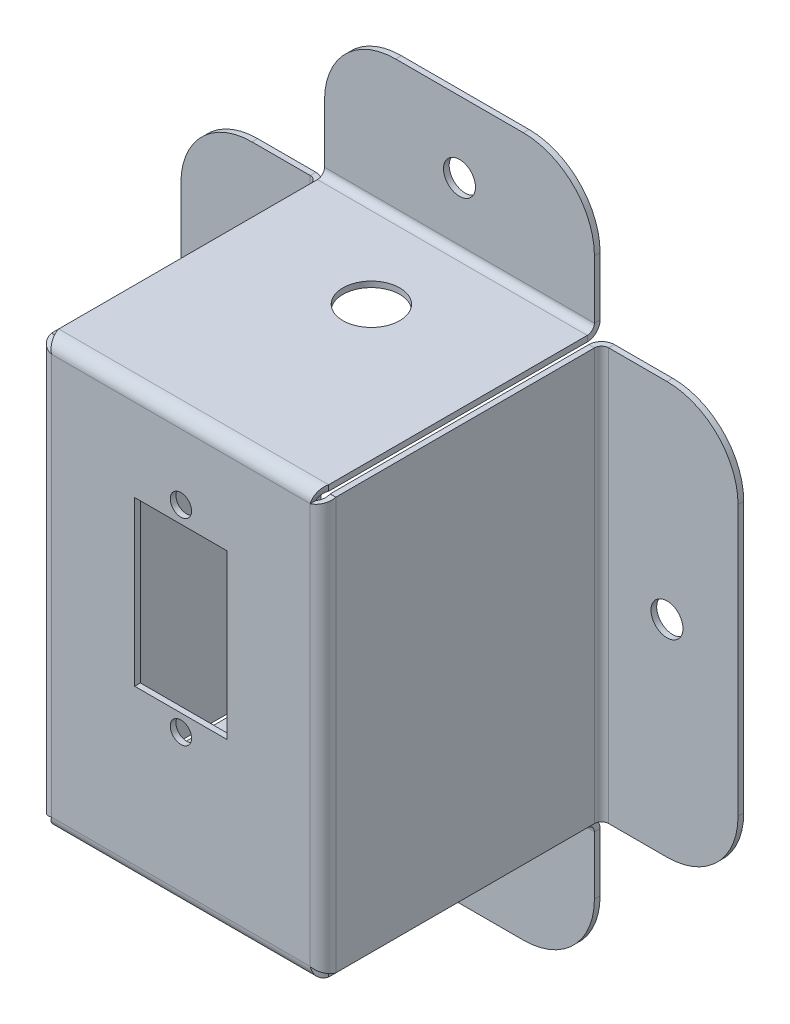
ISO-10303-21;
HEADER;
FILE_DESCRIPTION(('STEP AP214'),'2;1');
FILE_NAME('part.step','',(''),(''),'','','');
FILE_SCHEMA(('AUTOMOTIVE_DESIGN { 1 0 10303 214 1 1 1 1 }'));
ENDSEC;
DATA;
#1=APPLICATION_CONTEXT('core data for automotive mechanical design processes');
#2=APPLICATION_PROTOCOL_DEFINITION('international standard','automotive_design',2000,#1);
#3=PRODUCT_CONTEXT('',#1,'mechanical');
#4=PRODUCT('Part','Part','',(#3));
#5=PRODUCT_RELATED_PRODUCT_CATEGORY('part','',(#4));
#6=PRODUCT_DEFINITION_FORMATION('','',#4);
#7=PRODUCT_DEFINITION_CONTEXT('part definition',#1,'design');
#8=PRODUCT_DEFINITION('design','',#6,#7);
#9=PRODUCT_DEFINITION_SHAPE('','',#8);
#10=(LENGTH_UNIT() NAMED_UNIT(*) SI_UNIT(.MILLI.,.METRE.));
#11=(NAMED_UNIT(*) PLANE_ANGLE_UNIT() SI_UNIT($,.RADIAN.));
#12=(NAMED_UNIT(*) SI_UNIT($,.STERADIAN.) SOLID_ANGLE_UNIT());
#13=UNCERTAINTY_MEASURE_WITH_UNIT(LENGTH_MEASURE(1.E-05),#10,'distance_accuracy_value','');
#14=(GEOMETRIC_REPRESENTATION_CONTEXT(3) GLOBAL_UNCERTAINTY_ASSIGNED_CONTEXT((#13)) GLOBAL_UNIT_ASSIGNED_CONTEXT((#10,
#11,#12)) REPRESENTATION_CONTEXT('',''));
#15=CARTESIAN_POINT('',(0.,0.,0.));
#16=DIRECTION('',(0.,0.,1.));
#17=DIRECTION('',(1.,0.,0.));
#18=AXIS2_PLACEMENT_3D('',#15,#16,#17);
#19=CARTESIAN_POINT('',(18.987867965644,-29.2,-0.8));
#20=DIRECTION('',(1.,0.,0.));
#21=DIRECTION('',(0.,0.,-1.));
#22=AXIS2_PLACEMENT_3D('',#19,#20,#21);
#23=PLANE('',#22);
#24=DIRECTION('',(0.,0.,1.));
#25=VECTOR('',#24,1.);
#26=CARTESIAN_POINT('',(18.987867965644,-30.,-0.799999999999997));
#27=LINE('',#26,#25);
#28=CARTESIAN_POINT('',(18.987867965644,-30.,-1.79999999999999));
#29=VERTEX_POINT('',#28);
#30=CARTESIAN_POINT('',(18.987867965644,-30.0000000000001,-38.2));
#31=VERTEX_POINT('',#30);
#32=EDGE_CURVE('E1300',#29,#31,#27,.F.);
#33=ORIENTED_EDGE('',*,*,#32,.T.);
#34=DIRECTION('',(0.,1.,0.));
#35=VECTOR('',#34,1.);
#36=CARTESIAN_POINT('',(18.987867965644,-30.0000000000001,-38.2));
#37=LINE('',#36,#35);
#38=CARTESIAN_POINT('',(18.987867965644,-29.2000000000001,-38.2));
#39=VERTEX_POINT('',#38);
#40=EDGE_CURVE('E564',#31,#39,#37,.T.);
#41=ORIENTED_EDGE('',*,*,#40,.T.);
#42=DIRECTION('',(0.,0.,-1.));
#43=VECTOR('',#42,1.);
#44=CARTESIAN_POINT('',(18.987867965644,-29.2,1.0355237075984E-13));
#45=LINE('',#44,#43);
#46=CARTESIAN_POINT('',(18.987867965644,-29.2,-1.8));
#47=VERTEX_POINT('',#46);
#48=EDGE_CURVE('E804',#47,#39,#45,.T.);
#49=ORIENTED_EDGE('',*,*,#48,.F.);
#50=DIRECTION('',(0.,1.,0.));
#51=VECTOR('',#50,1.);
#52=CARTESIAN_POINT('',(18.987867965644,-29.2,-1.8));
#53=LINE('',#52,#51);
#54=EDGE_CURVE('E842',#29,#47,#53,.T.);
#55=ORIENTED_EDGE('',*,*,#54,.F.);
#56=EDGE_LOOP('',(#33,#41,#49,#55));
#57=FACE_BOUND('',#56,.T.);
#58=ADVANCED_FACE('F200',(#57),#23,.T.);
#59=CARTESIAN_POINT('',(0.,-30.,1.06345555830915E-13));
#60=DIRECTION('',(0.,1.,0.));
#61=DIRECTION('',(0.,0.,1.));
#62=AXIS2_PLACEMENT_3D('',#59,#60,#61);
#63=PLANE('',#62);
#64=DIRECTION('',(1.,0.,0.));
#65=VECTOR('',#64,1.);
#66=CARTESIAN_POINT('',(18.987867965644,-30.0000000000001,-38.2));
#67=LINE('',#66,#65);
#68=CARTESIAN_POINT('',(-18.987867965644,-30.0000000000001,-38.2));
#69=VERTEX_POINT('',#68);
#70=EDGE_CURVE('E568',#31,#69,#67,.F.);
#71=ORIENTED_EDGE('',*,*,#70,.F.);
#72=ORIENTED_EDGE('',*,*,#32,.F.);
#73=DIRECTION('',(-1.,0.,0.));
#74=VECTOR('',#73,1.);
#75=CARTESIAN_POINT('',(20.,-30.,-1.79999999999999));
#76=LINE('',#75,#74);
#77=CARTESIAN_POINT('',(-18.987867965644,-30.,-1.79999999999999));
#78=VERTEX_POINT('',#77);
#79=EDGE_CURVE('E1289',#78,#29,#76,.F.);
#80=ORIENTED_EDGE('',*,*,#79,.F.);
#81=DIRECTION('',(0.,0.,-1.));
#82=VECTOR('',#81,1.);
#83=CARTESIAN_POINT('',(-18.987867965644,-30.,1.06345555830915E-13));
#84=LINE('',#83,#82);
#85=EDGE_CURVE('E1290',#78,#69,#84,.T.);
#86=ORIENTED_EDGE('',*,*,#85,.T.);
#87=EDGE_LOOP('',(#71,#72,#80,#86));
#88=FACE_BOUND('',#87,.T.);
#89=ADVANCED_FACE('F858',(#88),#63,.F.);
#90=CARTESIAN_POINT('',(0.,-29.2,1.0355237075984E-13));
#91=DIRECTION('',(0.,1.,0.));
#92=DIRECTION('',(0.,0.,1.));
#93=AXIS2_PLACEMENT_3D('',#90,#91,#92);
#94=PLANE('',#93);
#95=ORIENTED_EDGE('',*,*,#48,.T.);
#96=DIRECTION('',(1.,0.,0.));
#97=VECTOR('',#96,1.);
#98=CARTESIAN_POINT('',(18.987867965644,-29.2000000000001,-38.2));
#99=LINE('',#98,#97);
#100=CARTESIAN_POINT('',(-18.987867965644,-29.2000000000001,-38.2));
#101=VERTEX_POINT('',#100);
#102=EDGE_CURVE('E515',#39,#101,#99,.F.);
#103=ORIENTED_EDGE('',*,*,#102,.T.);
#104=DIRECTION('',(0.,0.,1.));
#105=VECTOR('',#104,1.);
#106=CARTESIAN_POINT('',(-18.987867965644,-29.2,-0.8));
#107=LINE('',#106,#105);
#108=CARTESIAN_POINT('',(-18.987867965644,-29.2,-1.8));
#109=VERTEX_POINT('',#108);
#110=EDGE_CURVE('E1295',#109,#101,#107,.F.);
#111=ORIENTED_EDGE('',*,*,#110,.F.);
#112=DIRECTION('',(-1.,0.,0.));
#113=VECTOR('',#112,1.);
#114=CARTESIAN_POINT('',(20.,-29.2,-1.8));
#115=LINE('',#114,#113);
#116=EDGE_CURVE('E1286',#47,#109,#115,.T.);
#117=ORIENTED_EDGE('',*,*,#116,.F.);
#118=EDGE_LOOP('',(#95,#103,#111,#117));
#119=FACE_BOUND('',#118,.T.);
#120=ADVANCED_FACE('F864',(#119),#94,.T.);
#121=CARTESIAN_POINT('',(-18.987867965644,-29.2,-0.8));
#122=DIRECTION('',(1.,0.,0.));
#123=DIRECTION('',(0.,0.,-1.));
#124=AXIS2_PLACEMENT_3D('',#121,#122,#123);
#125=PLANE('',#124);
#126=DIRECTION('',(0.,1.,0.));
#127=VECTOR('',#126,1.);
#128=CARTESIAN_POINT('',(-18.987867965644,-30.0000000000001,-38.2));
#129=LINE('',#128,#127);
#130=EDGE_CURVE('E571',#69,#101,#129,.T.);
#131=ORIENTED_EDGE('',*,*,#130,.F.);
#132=ORIENTED_EDGE('',*,*,#85,.F.);
#133=DIRECTION('',(0.,-1.,0.));
#134=VECTOR('',#133,1.);
#135=CARTESIAN_POINT('',(-18.987867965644,-29.2,-1.8));
#136=LINE('',#135,#134);
#137=EDGE_CURVE('E1292',#78,#109,#136,.F.);
#138=ORIENTED_EDGE('',*,*,#137,.T.);
#139=ORIENTED_EDGE('',*,*,#110,.T.);
#140=EDGE_LOOP('',(#131,#132,#138,#139));
#141=FACE_BOUND('',#140,.T.);
#142=ADVANCED_FACE('F860',(#141),#125,.F.);
#143=CARTESIAN_POINT('',(-19.2,-28.987867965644,-0.8));
#144=DIRECTION('',(0.,-1.,0.));
#145=DIRECTION('',(0.,0.,-1.));
#146=AXIS2_PLACEMENT_3D('',#143,#144,#145);
#147=PLANE('',#146);
#148=DIRECTION('',(0.,0.,1.));
#149=VECTOR('',#148,1.);
#150=CARTESIAN_POINT('',(-20.,-28.987867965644,-0.799999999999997));
#151=LINE('',#150,#149);
#152=CARTESIAN_POINT('',(-20.,-28.987867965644,-1.79999999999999));
#153=VERTEX_POINT('',#152);
#154=CARTESIAN_POINT('',(-20.0000000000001,-28.9878679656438,-38.2));
#155=VERTEX_POINT('',#154);
#156=EDGE_CURVE('E783',#153,#155,#151,.F.);
#157=ORIENTED_EDGE('',*,*,#156,.T.);
#158=DIRECTION('',(1.,0.,0.));
#159=VECTOR('',#158,1.);
#160=CARTESIAN_POINT('',(-20.0000000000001,-28.9878679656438,-38.2));
#161=LINE('',#160,#159);
#162=CARTESIAN_POINT('',(-19.2000000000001,-28.9878679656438,-38.2));
#163=VERTEX_POINT('',#162);
#164=EDGE_CURVE('E610',#155,#163,#161,.T.);
#165=ORIENTED_EDGE('',*,*,#164,.T.);
#166=DIRECTION('',(0.,0.,-1.));
#167=VECTOR('',#166,1.);
#168=CARTESIAN_POINT('',(-19.2,-28.987867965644,-1.33386286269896E-13));
#169=LINE('',#168,#167);
#170=CARTESIAN_POINT('',(-19.2,-28.987867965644,-1.8));
#171=VERTEX_POINT('',#170);
#172=EDGE_CURVE('E760',#171,#163,#169,.T.);
#173=ORIENTED_EDGE('',*,*,#172,.F.);
#174=DIRECTION('',(1.,0.,0.));
#175=VECTOR('',#174,1.);
#176=CARTESIAN_POINT('',(-19.2,-28.987867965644,-1.8));
#177=LINE('',#176,#175);
#178=EDGE_CURVE('E767',#153,#171,#177,.T.);
#179=ORIENTED_EDGE('',*,*,#178,.F.);
#180=EDGE_LOOP('',(#157,#165,#173,#179));
#181=FACE_BOUND('',#180,.T.);
#182=ADVANCED_FACE('F863',(#181),#147,.T.);
#183=CARTESIAN_POINT('',(-20.,0.,0.));
#184=DIRECTION('',(1.,0.,0.));
#185=DIRECTION('',(0.,0.,-1.));
#186=AXIS2_PLACEMENT_3D('',#183,#184,#185);
#187=PLANE('',#186);
#188=DIRECTION('',(0.,-1.,0.));
#189=VECTOR('',#188,1.);
#190=CARTESIAN_POINT('',(-20.0000000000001,-28.9878679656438,-38.2));
#191=LINE('',#190,#189);
#192=CARTESIAN_POINT('',(-20.0000000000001,28.9878679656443,-38.2));
#193=VERTEX_POINT('',#192);
#194=EDGE_CURVE('E616',#155,#193,#191,.F.);
#195=ORIENTED_EDGE('',*,*,#194,.F.);
#196=ORIENTED_EDGE('',*,*,#156,.F.);
#197=DIRECTION('',(0.,1.,0.));
#198=VECTOR('',#197,1.);
#199=CARTESIAN_POINT('',(-20.,-30.,-1.79999999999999));
#200=LINE('',#199,#198);
#201=CARTESIAN_POINT('',(-20.,28.987867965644,-1.79999999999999));
#202=VERTEX_POINT('',#201);
#203=EDGE_CURVE('E773',#202,#153,#200,.F.);
#204=ORIENTED_EDGE('',*,*,#203,.F.);
#205=DIRECTION('',(0.,0.,-1.));
#206=VECTOR('',#205,1.);
#207=CARTESIAN_POINT('',(-20.,28.987867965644,2.74249299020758E-13));
#208=LINE('',#207,#206);
#209=EDGE_CURVE('E777',#202,#193,#208,.T.);
#210=ORIENTED_EDGE('',*,*,#209,.T.);
#211=EDGE_LOOP('',(#195,#196,#204,#210));
#212=FACE_BOUND('',#211,.T.);
#213=ADVANCED_FACE('F1514',(#212),#187,.F.);
#214=CARTESIAN_POINT('',(-19.2,0.,0.));
#215=DIRECTION('',(1.,0.,0.));
#216=DIRECTION('',(0.,0.,-1.));
#217=AXIS2_PLACEMENT_3D('',#214,#215,#216);
#218=PLANE('',#217);
#219=ORIENTED_EDGE('',*,*,#172,.T.);
#220=DIRECTION('',(0.,-1.,0.));
#221=VECTOR('',#220,1.);
#222=CARTESIAN_POINT('',(-19.2000000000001,-28.9878679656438,-38.2));
#223=LINE('',#222,#221);
#224=CARTESIAN_POINT('',(-19.2000000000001,28.9878679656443,-38.2));
#225=VERTEX_POINT('',#224);
#226=EDGE_CURVE('E603',#163,#225,#223,.F.);
#227=ORIENTED_EDGE('',*,*,#226,.T.);
#228=DIRECTION('',(0.,0.,1.));
#229=VECTOR('',#228,1.);
#230=CARTESIAN_POINT('',(-19.2,28.987867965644,-0.8));
#231=LINE('',#230,#229);
#232=CARTESIAN_POINT('',(-19.2,28.987867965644,-1.79999999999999));
#233=VERTEX_POINT('',#232);
#234=EDGE_CURVE('E780',#233,#225,#231,.F.);
#235=ORIENTED_EDGE('',*,*,#234,.F.);
#236=DIRECTION('',(0.,1.,0.));
#237=VECTOR('',#236,1.);
#238=CARTESIAN_POINT('',(-19.2,-30.,-1.8));
#239=LINE('',#238,#237);
#240=EDGE_CURVE('E775',#171,#233,#239,.T.);
#241=ORIENTED_EDGE('',*,*,#240,.F.);
#242=EDGE_LOOP('',(#219,#227,#235,#241));
#243=FACE_BOUND('',#242,.T.);
#244=ADVANCED_FACE('F823',(#243),#218,.T.);
#245=CARTESIAN_POINT('',(-19.2,28.987867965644,-0.8));
#246=DIRECTION('',(0.,-1.,0.));
#247=DIRECTION('',(0.,0.,-1.));
#248=AXIS2_PLACEMENT_3D('',#245,#246,#247);
#249=PLANE('',#248);
#250=DIRECTION('',(1.,0.,0.));
#251=VECTOR('',#250,1.);
#252=CARTESIAN_POINT('',(-20.0000000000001,28.9878679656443,-38.2));
#253=LINE('',#252,#251);
#254=EDGE_CURVE('E620',#193,#225,#253,.T.);
#255=ORIENTED_EDGE('',*,*,#254,.F.);
#256=ORIENTED_EDGE('',*,*,#209,.F.);
#257=DIRECTION('',(-1.,0.,0.));
#258=VECTOR('',#257,1.);
#259=CARTESIAN_POINT('',(-19.2,28.987867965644,-1.79999999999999));
#260=LINE('',#259,#258);
#261=EDGE_CURVE('E770',#202,#233,#260,.F.);
#262=ORIENTED_EDGE('',*,*,#261,.T.);
#263=ORIENTED_EDGE('',*,*,#234,.T.);
#264=EDGE_LOOP('',(#255,#256,#262,#263));
#265=FACE_BOUND('',#264,.T.);
#266=ADVANCED_FACE('F1516',(#265),#249,.F.);
#267=CARTESIAN_POINT('',(-18.987867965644,29.2,-0.8));
#268=DIRECTION('',(-1.,0.,0.));
#269=DIRECTION('',(0.,0.,1.));
#270=AXIS2_PLACEMENT_3D('',#267,#268,#269);
#271=PLANE('',#270);
#272=DIRECTION('',(0.,0.,1.));
#273=VECTOR('',#272,1.);
#274=CARTESIAN_POINT('',(-18.987867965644,30.,-0.799999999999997));
#275=LINE('',#274,#273);
#276=CARTESIAN_POINT('',(-18.987867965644,30.,-1.79999999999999));
#277=VERTEX_POINT('',#276);
#278=CARTESIAN_POINT('',(-18.987867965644,30.0000000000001,-38.2));
#279=VERTEX_POINT('',#278);
#280=EDGE_CURVE('E947',#277,#279,#275,.F.);
#281=ORIENTED_EDGE('',*,*,#280,.T.);
#282=DIRECTION('',(0.,-1.,0.));
#283=VECTOR('',#282,1.);
#284=CARTESIAN_POINT('',(-18.987867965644,30.0000000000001,-38.2));
#285=LINE('',#284,#283);
#286=CARTESIAN_POINT('',(-18.987867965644,29.2000000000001,-38.2));
#287=VERTEX_POINT('',#286);
#288=EDGE_CURVE('E657',#279,#287,#285,.T.);
#289=ORIENTED_EDGE('',*,*,#288,.T.);
#290=DIRECTION('',(0.,0.,-1.));
#291=VECTOR('',#290,1.);
#292=CARTESIAN_POINT('',(-18.987867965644,29.2,1.0355237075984E-13));
#293=LINE('',#292,#291);
#294=CARTESIAN_POINT('',(-18.987867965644,29.2,-1.8));
#295=VERTEX_POINT('',#294);
#296=EDGE_CURVE('E950',#295,#287,#293,.T.);
#297=ORIENTED_EDGE('',*,*,#296,.F.);
#298=DIRECTION('',(0.,-1.,0.));
#299=VECTOR('',#298,1.);
#300=CARTESIAN_POINT('',(-18.987867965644,29.2,-1.8));
#301=LINE('',#300,#299);
#302=EDGE_CURVE('E931',#277,#295,#301,.T.);
#303=ORIENTED_EDGE('',*,*,#302,.F.);
#304=EDGE_LOOP('',(#281,#289,#297,#303));
#305=FACE_BOUND('',#304,.T.);
#306=ADVANCED_FACE('F915',(#305),#271,.T.);
#307=CARTESIAN_POINT('',(0.,30.,1.06345555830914E-13));
#308=DIRECTION('',(0.,-1.,0.));
#309=DIRECTION('',(0.,0.,-1.));
#310=AXIS2_PLACEMENT_3D('',#307,#308,#309);
#311=PLANE('',#310);
#312=CARTESIAN_POINT('',(0.,30.0000000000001,-26.8));
#313=DIRECTION('',(0.,1.,0.));
#314=DIRECTION('',(0.,0.,1.));
#315=AXIS2_PLACEMENT_3D('',#312,#313,#314);
#316=CIRCLE('',#315,4.);
#317=CARTESIAN_POINT('',(0.,30.0000000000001,-22.8));
#318=VERTEX_POINT('',#317);
#319=EDGE_CURVE('E2279',#318,#318,#316,.T.);
#320=ORIENTED_EDGE('',*,*,#319,.F.);
#321=EDGE_LOOP('',(#320));
#322=FACE_BOUND('',#321,.T.);
#323=DIRECTION('',(-1.,0.,0.));
#324=VECTOR('',#323,1.);
#325=CARTESIAN_POINT('',(-18.987867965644,30.0000000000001,-38.2));
#326=LINE('',#325,#324);
#327=CARTESIAN_POINT('',(18.987867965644,30.0000000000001,-38.2));
#328=VERTEX_POINT('',#327);
#329=EDGE_CURVE('E663',#279,#328,#326,.F.);
#330=ORIENTED_EDGE('',*,*,#329,.F.);
#331=ORIENTED_EDGE('',*,*,#280,.F.);
#332=DIRECTION('',(1.,0.,0.));
#333=VECTOR('',#332,1.);
#334=CARTESIAN_POINT('',(-20.,30.,-1.79999999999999));
#335=LINE('',#334,#333);
#336=CARTESIAN_POINT('',(18.987867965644,30.,-1.79999999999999));
#337=VERTEX_POINT('',#336);
#338=EDGE_CURVE('E937',#337,#277,#335,.F.);
#339=ORIENTED_EDGE('',*,*,#338,.F.);
#340=DIRECTION('',(0.,0.,-1.));
#341=VECTOR('',#340,1.);
#342=CARTESIAN_POINT('',(18.987867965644,30.,1.06345555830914E-13));
#343=LINE('',#342,#341);
#344=EDGE_CURVE('E941',#337,#328,#343,.T.);
#345=ORIENTED_EDGE('',*,*,#344,.T.);
#346=EDGE_LOOP('',(#330,#331,#339,#345));
#347=FACE_BOUND('',#346,.T.);
#348=ADVANCED_FACE('F1204',(#322,#347),#311,.F.);
#349=CARTESIAN_POINT('',(0.,29.2,1.0355237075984E-13));
#350=DIRECTION('',(0.,-1.,0.));
#351=DIRECTION('',(0.,0.,-1.));
#352=AXIS2_PLACEMENT_3D('',#349,#350,#351);
#353=PLANE('',#352);
#354=CARTESIAN_POINT('',(0.,29.2000000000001,-26.8));
#355=DIRECTION('',(0.,1.,0.));
#356=DIRECTION('',(0.,0.,1.));
#357=AXIS2_PLACEMENT_3D('',#354,#355,#356);
#358=CIRCLE('',#357,4.);
#359=CARTESIAN_POINT('',(0.,29.2000000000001,-22.8));
#360=VERTEX_POINT('',#359);
#361=EDGE_CURVE('E2276',#360,#360,#358,.T.);
#362=ORIENTED_EDGE('',*,*,#361,.T.);
#363=EDGE_LOOP('',(#362));
#364=FACE_BOUND('',#363,.T.);
#365=ORIENTED_EDGE('',*,*,#296,.T.);
#366=DIRECTION('',(-1.,0.,0.));
#367=VECTOR('',#366,1.);
#368=CARTESIAN_POINT('',(-18.987867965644,29.2000000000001,-38.2));
#369=LINE('',#368,#367);
#370=CARTESIAN_POINT('',(18.987867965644,29.2000000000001,-38.2));
#371=VERTEX_POINT('',#370);
#372=EDGE_CURVE('E650',#287,#371,#369,.F.);
#373=ORIENTED_EDGE('',*,*,#372,.T.);
#374=DIRECTION('',(0.,0.,1.));
#375=VECTOR('',#374,1.);
#376=CARTESIAN_POINT('',(18.987867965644,29.2,-0.8));
#377=LINE('',#376,#375);
#378=CARTESIAN_POINT('',(18.987867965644,29.2,-1.8));
#379=VERTEX_POINT('',#378);
#380=EDGE_CURVE('E944',#379,#371,#377,.F.);
#381=ORIENTED_EDGE('',*,*,#380,.F.);
#382=DIRECTION('',(1.,0.,0.));
#383=VECTOR('',#382,1.);
#384=CARTESIAN_POINT('',(-20.,29.2,-1.8));
#385=LINE('',#384,#383);
#386=EDGE_CURVE('E939',#295,#379,#385,.T.);
#387=ORIENTED_EDGE('',*,*,#386,.F.);
#388=EDGE_LOOP('',(#365,#373,#381,#387));
#389=FACE_BOUND('',#388,.T.);
#390=ADVANCED_FACE('F993',(#364,#389),#353,.T.);
#391=CARTESIAN_POINT('',(18.987867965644,29.2,-0.8));
#392=DIRECTION('',(-1.,0.,0.));
#393=DIRECTION('',(0.,0.,1.));
#394=AXIS2_PLACEMENT_3D('',#391,#392,#393);
#395=PLANE('',#394);
#396=DIRECTION('',(0.,-1.,0.));
#397=VECTOR('',#396,1.);
#398=CARTESIAN_POINT('',(18.987867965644,30.0000000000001,-38.2));
#399=LINE('',#398,#397);
#400=EDGE_CURVE('E667',#328,#371,#399,.T.);
#401=ORIENTED_EDGE('',*,*,#400,.F.);
#402=ORIENTED_EDGE('',*,*,#344,.F.);
#403=DIRECTION('',(0.,1.,0.));
#404=VECTOR('',#403,1.);
#405=CARTESIAN_POINT('',(18.987867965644,29.2,-1.8));
#406=LINE('',#405,#404);
#407=EDGE_CURVE('E934',#337,#379,#406,.F.);
#408=ORIENTED_EDGE('',*,*,#407,.T.);
#409=ORIENTED_EDGE('',*,*,#380,.T.);
#410=EDGE_LOOP('',(#401,#402,#408,#409));
#411=FACE_BOUND('',#410,.T.);
#412=ADVANCED_FACE('F1029',(#411),#395,.F.);
#413=CARTESIAN_POINT('',(19.2,28.987867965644,-0.8));
#414=DIRECTION('',(0.,1.,0.));
#415=DIRECTION('',(0.,0.,1.));
#416=AXIS2_PLACEMENT_3D('',#413,#414,#415);
#417=PLANE('',#416);
#418=DIRECTION('',(0.,0.,1.));
#419=VECTOR('',#418,1.);
#420=CARTESIAN_POINT('',(20.,28.987867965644,-0.799999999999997));
#421=LINE('',#420,#419);
#422=CARTESIAN_POINT('',(20.,28.987867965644,-1.79999999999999));
#423=VERTEX_POINT('',#422);
#424=CARTESIAN_POINT('',(20.0000000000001,28.9878679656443,-38.2));
#425=VERTEX_POINT('',#424);
#426=EDGE_CURVE('E1233',#423,#425,#421,.F.);
#427=ORIENTED_EDGE('',*,*,#426,.T.);
#428=DIRECTION('',(-1.,0.,0.));
#429=VECTOR('',#428,1.);
#430=CARTESIAN_POINT('',(20.0000000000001,28.9878679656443,-38.2));
#431=LINE('',#430,#429);
#432=CARTESIAN_POINT('',(19.2000000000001,28.9878679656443,-38.2));
#433=VERTEX_POINT('',#432);
#434=EDGE_CURVE('E707',#425,#433,#431,.T.);
#435=ORIENTED_EDGE('',*,*,#434,.T.);
#436=DIRECTION('',(0.,0.,-1.));
#437=VECTOR('',#436,1.);
#438=CARTESIAN_POINT('',(19.2,28.987867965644,2.71456113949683E-13));
#439=LINE('',#438,#437);
#440=CARTESIAN_POINT('',(19.2,28.987867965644,-1.8));
#441=VERTEX_POINT('',#440);
#442=EDGE_CURVE('E966',#441,#433,#439,.T.);
#443=ORIENTED_EDGE('',*,*,#442,.F.);
#444=DIRECTION('',(-1.,0.,0.));
#445=VECTOR('',#444,1.);
#446=CARTESIAN_POINT('',(19.2,28.987867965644,-1.8));
#447=LINE('',#446,#445);
#448=EDGE_CURVE('E1011',#423,#441,#447,.T.);
#449=ORIENTED_EDGE('',*,*,#448,.F.);
#450=EDGE_LOOP('',(#427,#435,#443,#449));
#451=FACE_BOUND('',#450,.T.);
#452=ADVANCED_FACE('F1019',(#451),#417,.T.);
#453=CARTESIAN_POINT('',(20.,0.,0.));
#454=DIRECTION('',(-1.,0.,0.));
#455=DIRECTION('',(0.,0.,1.));
#456=AXIS2_PLACEMENT_3D('',#453,#454,#455);
#457=PLANE('',#456);
#458=DIRECTION('',(0.,1.,0.));
#459=VECTOR('',#458,1.);
#460=CARTESIAN_POINT('',(20.0000000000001,28.9878679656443,-38.2));
#461=LINE('',#460,#459);
#462=CARTESIAN_POINT('',(20.0000000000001,-28.9878679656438,-38.2));
#463=VERTEX_POINT('',#462);
#464=EDGE_CURVE('E713',#425,#463,#461,.F.);
#465=ORIENTED_EDGE('',*,*,#464,.F.);
#466=ORIENTED_EDGE('',*,*,#426,.F.);
#467=DIRECTION('',(0.,-1.,0.));
#468=VECTOR('',#467,1.);
#469=CARTESIAN_POINT('',(20.,30.,-1.79999999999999));
#470=LINE('',#469,#468);
#471=CARTESIAN_POINT('',(20.,-28.987867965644,-1.79999999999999));
#472=VERTEX_POINT('',#471);
#473=EDGE_CURVE('E1244',#472,#423,#470,.F.);
#474=ORIENTED_EDGE('',*,*,#473,.F.);
#475=DIRECTION('',(0.,0.,-1.));
#476=VECTOR('',#475,1.);
#477=CARTESIAN_POINT('',(20.,-28.987867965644,-1.30593101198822E-13));
#478=LINE('',#477,#476);
#479=EDGE_CURVE('E1239',#472,#463,#478,.T.);
#480=ORIENTED_EDGE('',*,*,#479,.T.);
#481=EDGE_LOOP('',(#465,#466,#474,#480));
#482=FACE_BOUND('',#481,.T.);
#483=ADVANCED_FACE('F1028',(#482),#457,.F.);
#484=CARTESIAN_POINT('',(19.2,0.,0.));
#485=DIRECTION('',(-1.,0.,0.));
#486=DIRECTION('',(0.,0.,1.));
#487=AXIS2_PLACEMENT_3D('',#484,#485,#486);
#488=PLANE('',#487);
#489=ORIENTED_EDGE('',*,*,#442,.T.);
#490=DIRECTION('',(0.,1.,0.));
#491=VECTOR('',#490,1.);
#492=CARTESIAN_POINT('',(19.2000000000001,28.9878679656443,-38.2));
#493=LINE('',#492,#491);
#494=CARTESIAN_POINT('',(19.2000000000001,-28.9878679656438,-38.2));
#495=VERTEX_POINT('',#494);
#496=EDGE_CURVE('E700',#433,#495,#493,.F.);
#497=ORIENTED_EDGE('',*,*,#496,.T.);
#498=DIRECTION('',(0.,0.,1.));
#499=VECTOR('',#498,1.);
#500=CARTESIAN_POINT('',(19.2,-28.987867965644,-0.8));
#501=LINE('',#500,#499);
#502=CARTESIAN_POINT('',(19.2,-28.987867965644,-1.79999999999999));
#503=VERTEX_POINT('',#502);
#504=EDGE_CURVE('E1236',#503,#495,#501,.F.);
#505=ORIENTED_EDGE('',*,*,#504,.F.);
#506=DIRECTION('',(0.,-1.,0.));
#507=VECTOR('',#506,1.);
#508=CARTESIAN_POINT('',(19.2,30.,-1.8));
#509=LINE('',#508,#507);
#510=EDGE_CURVE('E1242',#441,#503,#509,.T.);
#511=ORIENTED_EDGE('',*,*,#510,.F.);
#512=EDGE_LOOP('',(#489,#497,#505,#511));
#513=FACE_BOUND('',#512,.T.);
#514=ADVANCED_FACE('F1035',(#513),#488,.T.);
#515=CARTESIAN_POINT('',(19.2,-28.987867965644,-0.8));
#516=DIRECTION('',(0.,1.,0.));
#517=DIRECTION('',(0.,0.,1.));
#518=AXIS2_PLACEMENT_3D('',#515,#516,#517);
#519=PLANE('',#518);
#520=DIRECTION('',(-1.,0.,0.));
#521=VECTOR('',#520,1.);
#522=CARTESIAN_POINT('',(20.0000000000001,-28.9878679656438,-38.2));
#523=LINE('',#522,#521);
#524=EDGE_CURVE('E717',#463,#495,#523,.T.);
#525=ORIENTED_EDGE('',*,*,#524,.F.);
#526=ORIENTED_EDGE('',*,*,#479,.F.);
#527=DIRECTION('',(1.,0.,0.));
#528=VECTOR('',#527,1.);
#529=CARTESIAN_POINT('',(19.2,-28.987867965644,-1.79999999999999));
#530=LINE('',#529,#528);
#531=EDGE_CURVE('E1245',#472,#503,#530,.F.);
#532=ORIENTED_EDGE('',*,*,#531,.T.);
#533=ORIENTED_EDGE('',*,*,#504,.T.);
#534=EDGE_LOOP('',(#525,#526,#532,#533));
#535=FACE_BOUND('',#534,.T.);
#536=ADVANCED_FACE('F1031',(#535),#519,.F.);
#537=CARTESIAN_POINT('',(0.,0.,-0.8));
#538=DIRECTION('',(0.,0.,1.));
#539=DIRECTION('',(1.,0.,0.));
#540=AXIS2_PLACEMENT_3D('',#537,#538,#539);
#541=PLANE('',#540);
#542=CARTESIAN_POINT('',(0.,18.95,-0.8));
#543=DIRECTION('',(0.,0.,1.));
#544=DIRECTION('',(1.,0.,0.));
#545=AXIS2_PLACEMENT_3D('',#542,#543,#544);
#546=CIRCLE('',#545,1.5);
#547=CARTESIAN_POINT('',(1.5,18.95,-0.8));
#548=VERTEX_POINT('',#547);
#549=EDGE_CURVE('E723',#548,#548,#546,.T.);
#550=ORIENTED_EDGE('',*,*,#549,.T.);
#551=EDGE_LOOP('',(#550));
#552=FACE_BOUND('',#551,.T.);
#553=CARTESIAN_POINT('',(0.,-8.75,-0.8));
#554=DIRECTION('',(0.,0.,1.));
#555=DIRECTION('',(1.,0.,0.));
#556=AXIS2_PLACEMENT_3D('',#553,#554,#555);
#557=CIRCLE('',#556,1.5);
#558=CARTESIAN_POINT('',(1.5,-8.75,-0.8));
#559=VERTEX_POINT('',#558);
#560=EDGE_CURVE('E730',#559,#559,#557,.T.);
#561=ORIENTED_EDGE('',*,*,#560,.T.);
#562=EDGE_LOOP('',(#561));
#563=FACE_BOUND('',#562,.T.);
#564=DIRECTION('',(1.,0.,0.));
#565=VECTOR('',#564,1.);
#566=CARTESIAN_POINT('',(-6.5,-6.4,-0.8));
#567=LINE('',#566,#565);
#568=CARTESIAN_POINT('',(-6.5,-6.4,-0.8));
#569=VERTEX_POINT('',#568);
#570=CARTESIAN_POINT('',(6.5,-6.4,-0.8));
#571=VERTEX_POINT('',#570);
#572=EDGE_CURVE('E745',#569,#571,#567,.T.);
#573=ORIENTED_EDGE('',*,*,#572,.T.);
#574=DIRECTION('',(0.,1.,0.));
#575=VECTOR('',#574,1.);
#576=CARTESIAN_POINT('',(6.5,16.6,-0.8));
#577=LINE('',#576,#575);
#578=CARTESIAN_POINT('',(6.5,16.6,-0.8));
#579=VERTEX_POINT('',#578);
#580=EDGE_CURVE('E735',#571,#579,#577,.T.);
#581=ORIENTED_EDGE('',*,*,#580,.T.);
#582=DIRECTION('',(-1.,0.,0.));
#583=VECTOR('',#582,1.);
#584=CARTESIAN_POINT('',(-6.5,16.6,-0.8));
#585=LINE('',#584,#583);
#586=CARTESIAN_POINT('',(-6.5,16.6,-0.8));
#587=VERTEX_POINT('',#586);
#588=EDGE_CURVE('E738',#579,#587,#585,.T.);
#589=ORIENTED_EDGE('',*,*,#588,.T.);
#590=DIRECTION('',(0.,-1.,0.));
#591=VECTOR('',#590,1.);
#592=CARTESIAN_POINT('',(-6.5,16.6,-0.8));
#593=LINE('',#592,#591);
#594=EDGE_CURVE('E742',#587,#569,#593,.T.);
#595=ORIENTED_EDGE('',*,*,#594,.T.);
#596=EDGE_LOOP('',(#573,#581,#589,#595));
#597=FACE_BOUND('',#596,.T.);
#598=DIRECTION('',(0.,1.,0.));
#599=VECTOR('',#598,1.);
#600=CARTESIAN_POINT('',(-18.2,28.987867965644,-0.799999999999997));
#601=LINE('',#600,#599);
#602=CARTESIAN_POINT('',(-18.2,28.2,-0.799999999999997));
#603=VERTEX_POINT('',#602);
#604=CARTESIAN_POINT('',(-18.2,-28.2,-0.800000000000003));
#605=VERTEX_POINT('',#604);
#606=EDGE_CURVE('E788',#603,#605,#601,.F.);
#607=ORIENTED_EDGE('',*,*,#606,.F.);
#608=DIRECTION('',(1.,0.,0.));
#609=VECTOR('',#608,1.);
#610=CARTESIAN_POINT('',(18.987867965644,28.2,-0.799999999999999));
#611=LINE('',#610,#609);
#612=CARTESIAN_POINT('',(18.2,28.2,-0.799999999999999));
#613=VERTEX_POINT('',#612);
#614=EDGE_CURVE('E954',#613,#603,#611,.F.);
#615=ORIENTED_EDGE('',*,*,#614,.F.);
#616=DIRECTION('',(0.,-1.,0.));
#617=VECTOR('',#616,1.);
#618=CARTESIAN_POINT('',(18.2,-28.987867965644,-0.799999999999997));
#619=LINE('',#618,#617);
#620=CARTESIAN_POINT('',(18.2,-28.2,-0.799999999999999));
#621=VERTEX_POINT('',#620);
#622=EDGE_CURVE('E1100',#621,#613,#619,.F.);
#623=ORIENTED_EDGE('',*,*,#622,.F.);
#624=DIRECTION('',(-1.,0.,0.));
#625=VECTOR('',#624,1.);
#626=CARTESIAN_POINT('',(-18.987867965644,-28.2,-0.799999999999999));
#627=LINE('',#626,#625);
#628=EDGE_CURVE('E930',#605,#621,#627,.F.);
#629=ORIENTED_EDGE('',*,*,#628,.F.);
#630=EDGE_LOOP('',(#607,#615,#623,#629));
#631=FACE_BOUND('',#630,.T.);
#632=ADVANCED_FACE('F1034',(#552,#563,#597,#631),#541,.F.);
#633=CARTESIAN_POINT('',(0.,0.,0.));
#634=DIRECTION('',(0.,0.,1.));
#635=DIRECTION('',(1.,0.,0.));
#636=AXIS2_PLACEMENT_3D('',#633,#634,#635);
#637=PLANE('',#636);
#638=CARTESIAN_POINT('',(0.,18.95,0.));
#639=DIRECTION('',(0.,0.,1.));
#640=DIRECTION('',(1.,0.,0.));
#641=AXIS2_PLACEMENT_3D('',#638,#639,#640);
#642=CIRCLE('',#641,1.5);
#643=CARTESIAN_POINT('',(1.5,18.95,0.));
#644=VERTEX_POINT('',#643);
#645=EDGE_CURVE('E727',#644,#644,#642,.T.);
#646=ORIENTED_EDGE('',*,*,#645,.F.);
#647=EDGE_LOOP('',(#646));
#648=FACE_BOUND('',#647,.T.);
#649=CARTESIAN_POINT('',(0.,-8.75,0.));
#650=DIRECTION('',(0.,0.,1.));
#651=DIRECTION('',(1.,0.,0.));
#652=AXIS2_PLACEMENT_3D('',#649,#650,#651);
#653=CIRCLE('',#652,1.5);
#654=CARTESIAN_POINT('',(1.5,-8.75,0.));
#655=VERTEX_POINT('',#654);
#656=EDGE_CURVE('E720',#655,#655,#653,.T.);
#657=ORIENTED_EDGE('',*,*,#656,.F.);
#658=EDGE_LOOP('',(#657));
#659=FACE_BOUND('',#658,.T.);
#660=DIRECTION('',(0.,1.,0.));
#661=VECTOR('',#660,1.);
#662=CARTESIAN_POINT('',(6.5,16.6,0.));
#663=LINE('',#662,#661);
#664=CARTESIAN_POINT('',(6.5,-6.4,0.));
#665=VERTEX_POINT('',#664);
#666=CARTESIAN_POINT('',(6.5,16.6,0.));
#667=VERTEX_POINT('',#666);
#668=EDGE_CURVE('E726',#665,#667,#663,.T.);
#669=ORIENTED_EDGE('',*,*,#668,.F.);
#670=DIRECTION('',(1.,0.,0.));
#671=VECTOR('',#670,1.);
#672=CARTESIAN_POINT('',(-6.5,-6.4,0.));
#673=LINE('',#672,#671);
#674=CARTESIAN_POINT('',(-6.5,-6.4,0.));
#675=VERTEX_POINT('',#674);
#676=EDGE_CURVE('E739',#675,#665,#673,.T.);
#677=ORIENTED_EDGE('',*,*,#676,.F.);
#678=DIRECTION('',(0.,-1.,0.));
#679=VECTOR('',#678,1.);
#680=CARTESIAN_POINT('',(-6.5,16.6,0.));
#681=LINE('',#680,#679);
#682=CARTESIAN_POINT('',(-6.5,16.6,0.));
#683=VERTEX_POINT('',#682);
#684=EDGE_CURVE('E753',#683,#675,#681,.T.);
#685=ORIENTED_EDGE('',*,*,#684,.F.);
#686=DIRECTION('',(-1.,0.,0.));
#687=VECTOR('',#686,1.);
#688=CARTESIAN_POINT('',(-6.5,16.6,0.));
#689=LINE('',#688,#687);
#690=EDGE_CURVE('E750',#667,#683,#689,.T.);
#691=ORIENTED_EDGE('',*,*,#690,.F.);
#692=EDGE_LOOP('',(#669,#677,#685,#691));
#693=FACE_BOUND('',#692,.T.);
#694=DIRECTION('',(1.,0.,0.));
#695=VECTOR('',#694,1.);
#696=CARTESIAN_POINT('',(18.987867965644,28.2,0.));
#697=LINE('',#696,#695);
#698=CARTESIAN_POINT('',(18.2,28.2,0.));
#699=VERTEX_POINT('',#698);
#700=CARTESIAN_POINT('',(-18.2,28.2,0.));
#701=VERTEX_POINT('',#700);
#702=EDGE_CURVE('E958',#699,#701,#697,.F.);
#703=ORIENTED_EDGE('',*,*,#702,.T.);
#704=DIRECTION('',(0.,1.,0.));
#705=VECTOR('',#704,1.);
#706=CARTESIAN_POINT('',(-18.2,28.987867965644,0.));
#707=LINE('',#706,#705);
#708=CARTESIAN_POINT('',(-18.2,-28.2,0.));
#709=VERTEX_POINT('',#708);
#710=EDGE_CURVE('E791',#701,#709,#707,.F.);
#711=ORIENTED_EDGE('',*,*,#710,.T.);
#712=DIRECTION('',(-1.,0.,0.));
#713=VECTOR('',#712,1.);
#714=CARTESIAN_POINT('',(-18.987867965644,-28.2,0.));
#715=LINE('',#714,#713);
#716=CARTESIAN_POINT('',(18.2,-28.2,0.));
#717=VERTEX_POINT('',#716);
#718=EDGE_CURVE('E898',#709,#717,#715,.F.);
#719=ORIENTED_EDGE('',*,*,#718,.T.);
#720=DIRECTION('',(0.,-1.,0.));
#721=VECTOR('',#720,1.);
#722=CARTESIAN_POINT('',(18.2,-28.987867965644,0.));
#723=LINE('',#722,#721);
#724=EDGE_CURVE('E1069',#717,#699,#723,.F.);
#725=ORIENTED_EDGE('',*,*,#724,.T.);
#726=EDGE_LOOP('',(#703,#711,#719,#725));
#727=FACE_BOUND('',#726,.T.);
#728=ADVANCED_FACE('F1534',(#648,#659,#693,#727),#637,.T.);
#729=CARTESIAN_POINT('',(18.2,28.2,0.00799999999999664));
#730=CARTESIAN_POINT('',(18.4367062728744,28.2656666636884,0.00799999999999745));
#731=CARTESIAN_POINT('',(18.6732401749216,28.3313113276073,-0.0390574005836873));
#732=CARTESIAN_POINT('',(19.1105431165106,28.4626226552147,-0.220194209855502));
#733=CARTESIAN_POINT('',(19.3111004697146,28.5282783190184,-0.354202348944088));
#734=CARTESIAN_POINT('',(19.6457976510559,28.6595896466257,-0.68889953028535));
#735=CARTESIAN_POINT('',(19.7798057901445,28.7252453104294,-0.88945688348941));
#736=CARTESIAN_POINT('',(19.9609425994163,28.8565566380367,-1.32675982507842));
#737=CARTESIAN_POINT('',(20.008,28.9222013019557,-1.56329372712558));
#738=CARTESIAN_POINT('',(20.008,28.987867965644,-1.79999999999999));
#739=CARTESIAN_POINT('',(18.2,28.2,0.));
#740=CARTESIAN_POINT('',(18.4356588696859,28.2656666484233,0.));
#741=CARTESIAN_POINT('',(18.6711461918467,28.3313113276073,-0.0468491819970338));
#742=CARTESIAN_POINT('',(19.1065141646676,28.4626226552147,-0.227184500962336));
#743=CARTESIAN_POINT('',(19.3061840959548,28.5282783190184,-0.360599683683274));
#744=CARTESIAN_POINT('',(19.6394003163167,28.6595896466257,-0.693815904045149));
#745=CARTESIAN_POINT('',(19.7728154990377,28.7252453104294,-0.893485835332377));
#746=CARTESIAN_POINT('',(19.953150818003,28.8565566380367,-1.32885380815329));
#747=CARTESIAN_POINT('',(20.,28.9222013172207,-1.56434113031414));
#748=CARTESIAN_POINT('',(20.,28.987867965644,-1.79999999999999));
#749=CARTESIAN_POINT('',(18.2,28.2,-0.800000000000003));
#750=CARTESIAN_POINT('',(18.3309185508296,28.2656651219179,-0.800000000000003));
#751=CARTESIAN_POINT('',(18.4617478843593,28.3313113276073,-0.826027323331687));
#752=CARTESIAN_POINT('',(18.7036189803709,28.4626226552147,-0.926213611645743));
#753=CARTESIAN_POINT('',(18.8145467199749,28.5282783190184,-1.00033315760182));
#754=CARTESIAN_POINT('',(18.9996668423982,28.6595896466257,-1.18545328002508));
#755=CARTESIAN_POINT('',(19.0737863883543,28.7252453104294,-1.2963810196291));
#756=CARTESIAN_POINT('',(19.1739726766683,28.8565566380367,-1.53825211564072));
#757=CARTESIAN_POINT('',(19.2,28.9222028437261,-1.6690814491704));
#758=CARTESIAN_POINT('',(19.2,28.987867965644,-1.8));
#759=CARTESIAN_POINT('',(18.2,28.2,-0.808080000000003));
#760=CARTESIAN_POINT('',(18.3298606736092,28.2656651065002,-0.808080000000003));
#761=CARTESIAN_POINT('',(18.4596329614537,28.3313113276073,-0.833897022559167));
#762=CARTESIAN_POINT('',(18.6995497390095,28.4626226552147,-0.933273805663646));
#763=CARTESIAN_POINT('',(18.8095811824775,28.5282783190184,-1.0067944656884));
#764=CARTESIAN_POINT('',(18.9932055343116,28.6595896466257,-1.19041881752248));
#765=CARTESIAN_POINT('',(19.0667261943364,28.7252453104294,-1.3004502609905));
#766=CARTESIAN_POINT('',(19.1661029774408,28.8565566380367,-1.54036703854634));
#767=CARTESIAN_POINT('',(19.19192,28.9222028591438,-1.67013932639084));
#768=CARTESIAN_POINT('',(19.19192,28.987867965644,-1.8));
#769=B_SPLINE_SURFACE_WITH_KNOTS('',1,3,((#729,#730,#731,#732,#733,#734,#735,#736,#737,#738),
(#739,#740,#741,#742,#743,#744,#745,#746,#747,#748),(#749,#750,#751,#752,#753,#754,#755,#756,
#757,#758),(#759,#760,#761,#762,#763,#764,#765,#766,#767,#768)),.UNSPECIFIED.,.F.,.F.,.F.,(2,1,
1,2),(4,2,2,2,4),(-0.01,0.,1.,1.0101),(0.,0.25,0.5,0.75,1.),.UNSPECIFIED.);
#770=CARTESIAN_POINT('',(18.2,28.2,-0.800000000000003));
#771=CARTESIAN_POINT('',(18.2309336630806,28.2155166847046,-0.799998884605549));
#772=CARTESIAN_POINT('',(18.2618546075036,28.2310260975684,-0.801436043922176));
#773=CARTESIAN_POINT('',(18.3234274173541,28.2620423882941,-0.807164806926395));
#774=CARTESIAN_POINT('',(18.3540793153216,28.2775492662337,-0.811456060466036));
#775=CARTESIAN_POINT('',(18.4451868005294,28.3240435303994,-0.828561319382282));
#776=CARTESIAN_POINT('',(18.5048878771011,28.3550507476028,-0.845606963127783));
#777=CARTESIAN_POINT('',(18.6211998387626,28.4176497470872,-0.890848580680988));
#778=CARTESIAN_POINT('',(18.6777319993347,28.4492416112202,-0.919247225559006));
#779=CARTESIAN_POINT('',(18.7577173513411,28.4965849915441,-0.969370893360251));
#780=CARTESIAN_POINT('',(18.7835781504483,28.5123594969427,-0.987334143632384));
#781=CARTESIAN_POINT('',(18.8335180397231,28.5439248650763,-1.02563187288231));
#782=CARTESIAN_POINT('',(18.8575954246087,28.5597157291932,-1.04596857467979));
#783=CARTESIAN_POINT('',(18.9267589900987,28.6070726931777,-1.11023645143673));
#784=CARTESIAN_POINT('',(18.9688394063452,28.6386597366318,-1.15746489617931));
#785=CARTESIAN_POINT('',(19.0433705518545,28.701830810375,-1.25898998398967));
#786=CARTESIAN_POINT('',(19.0758214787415,28.7334148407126,-1.31328648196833));
#787=CARTESIAN_POINT('',(19.116430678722,28.7807899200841,-1.3985627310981));
#788=CARTESIAN_POINT('',(19.1286322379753,28.7966002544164,-1.42766362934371));
#789=CARTESIAN_POINT('',(19.150228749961,28.8282052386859,-1.48685742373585));
#790=CARTESIAN_POINT('',(19.1596260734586,28.8439998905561,-1.51694945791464));
#791=CARTESIAN_POINT('',(19.1834503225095,28.8913335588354,-1.60826303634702));
#792=CARTESIAN_POINT('',(19.1935802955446,28.9229036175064,-1.67067115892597));
#793=CARTESIAN_POINT('',(19.1992641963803,28.9655841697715,-1.75557359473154));
#794=CARTESIAN_POINT('',(19.2000073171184,28.9767304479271,-1.77779549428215));
#795=CARTESIAN_POINT('',(19.2,28.987867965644,-1.8));
#796=B_SPLINE_CURVE_WITH_KNOTS('',3,(#770,#771,#772,#773,#774,#775,#776,#777,#778,#779,#780,
#781,#782,#783,#784,#785,#786,#787,#788,#789,#790,#791,#792,#793,#794,#795),.UNSPECIFIED.,.F.,
.F.,(4,2,2,2,2,2,2,2,2,2,2,2,4),(0.,0.103762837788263,0.207512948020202,0.414703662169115,
0.625771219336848,0.731315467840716,0.83695936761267,1.04800216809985,1.25904063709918,
1.36481175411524,1.47049319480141,1.68131082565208,1.75587388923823),.UNSPECIFIED.);
#797=EDGE_CURVE('E1070',#613,#441,#796,.T.);
#798=DIRECTION('',(0.,0.,1.));
#799=VECTOR('',#798,1.);
#800=CARTESIAN_POINT('',(18.2,28.2,-0.800000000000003));
#801=LINE('',#800,#799);
#802=EDGE_CURVE('E1104',#613,#699,#801,.T.);
#803=CARTESIAN_POINT('',(18.2,28.2,0.));
#804=CARTESIAN_POINT('',(18.2525770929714,28.2146517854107,-1.45672994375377E-08));
#805=CARTESIAN_POINT('',(18.3051291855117,28.2292958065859,-0.00230511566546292));
#806=CARTESIAN_POINT('',(18.40982825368,28.258582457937,-0.0114988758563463));
#807=CARTESIAN_POINT('',(18.4619752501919,28.2732250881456,-0.0183872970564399));
#808=CARTESIAN_POINT('',(18.6171107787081,28.3171253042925,-0.0458572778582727));
#809=CARTESIAN_POINT('',(18.7189723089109,28.3464041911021,-0.0732437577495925));
#810=CARTESIAN_POINT('',(18.9163820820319,28.4049689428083,-0.14535127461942));
#811=CARTESIAN_POINT('',(19.0119259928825,28.4342547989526,-0.190084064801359));
#812=CARTESIAN_POINT('',(19.193749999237,28.4928202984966,-0.295508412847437));
#813=CARTESIAN_POINT('',(19.2800321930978,28.5220999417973,-0.35619634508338));
#814=CARTESIAN_POINT('',(19.4406937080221,28.5806607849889,-0.491671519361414));
#815=CARTESIAN_POINT('',(19.5150736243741,28.6099419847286,-0.566458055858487));
#816=CARTESIAN_POINT('',(19.6496896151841,28.6685109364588,-0.727878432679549));
#817=CARTESIAN_POINT('',(19.7099210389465,28.6977986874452,-0.814516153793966));
#818=CARTESIAN_POINT('',(19.8143793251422,28.7563842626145,-0.996979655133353));
#819=CARTESIAN_POINT('',(19.8586005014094,28.7856820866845,-1.09280868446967));
#820=CARTESIAN_POINT('',(19.9296230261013,28.8442602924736,-1.29066290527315));
#821=CARTESIAN_POINT('',(19.9564424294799,28.8735406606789,-1.39268155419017));
#822=CARTESIAN_POINT('',(19.9827719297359,28.9169879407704,-1.5463656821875));
#823=CARTESIAN_POINT('',(19.989233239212,28.9311771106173,-1.59692229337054));
#824=CARTESIAN_POINT('',(19.9978432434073,28.9595310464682,-1.69831168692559));
#825=CARTESIAN_POINT('',(19.9999995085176,28.9736958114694,-1.74914382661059));
#826=CARTESIAN_POINT('',(20.,28.987867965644,-1.79999999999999));
#827=B_SPLINE_CURVE_WITH_KNOTS('',3,(#803,#804,#805,#806,#807,#808,#809,#810,#811,#812,#813,
#814,#815,#816,#817,#818,#819,#820,#821,#822,#823,#824,#825,#826),.UNSPECIFIED.,.F.,.F.,(4,2,2,
2,2,2,2,2,2,2,2,4),(0.,0.163640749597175,0.327273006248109,0.653989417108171,0.980927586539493,
1.30779152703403,1.63463911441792,1.96159398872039,2.28866486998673,2.61539585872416,
2.773962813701,2.93225068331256),.UNSPECIFIED.);
#828=EDGE_CURVE('E1054',#699,#423,#827,.T.);
#829=ORIENTED_EDGE('',*,*,#448,.T.);
#830=ORIENTED_EDGE('',*,*,#797,.F.);
#831=ORIENTED_EDGE('',*,*,#802,.T.);
#832=ORIENTED_EDGE('',*,*,#828,.T.);
#833=EDGE_LOOP('',(#829,#830,#831,#832));
#834=FACE_BOUND('',#833,.T.);
#835=ADVANCED_FACE('F1081',(#834),#769,.F.);
#836=CARTESIAN_POINT('',(20.008,-28.987867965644,-1.79999999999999));
#837=CARTESIAN_POINT('',(20.008,-28.9222013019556,-1.56329372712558));
#838=CARTESIAN_POINT('',(19.9609425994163,-28.8565566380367,-1.32675982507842));
#839=CARTESIAN_POINT('',(19.7798057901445,-28.7252453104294,-0.88945688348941));
#840=CARTESIAN_POINT('',(19.6457976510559,-28.6595896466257,-0.68889953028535));
#841=CARTESIAN_POINT('',(19.3111004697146,-28.5282783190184,-0.354202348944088));
#842=CARTESIAN_POINT('',(19.1105431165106,-28.4626226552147,-0.2201942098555));
#843=CARTESIAN_POINT('',(18.6732401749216,-28.3313113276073,-0.0390574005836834));
#844=CARTESIAN_POINT('',(18.4367062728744,-28.2656666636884,0.00800000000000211));
#845=CARTESIAN_POINT('',(18.2,-28.2,0.00800000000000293));
#846=CARTESIAN_POINT('',(20.,-28.987867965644,-1.79999999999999));
#847=CARTESIAN_POINT('',(20.,-28.9222013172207,-1.56434113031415));
#848=CARTESIAN_POINT('',(19.953150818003,-28.8565566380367,-1.32885380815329));
#849=CARTESIAN_POINT('',(19.7728154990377,-28.7252453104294,-0.893485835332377));
#850=CARTESIAN_POINT('',(19.6394003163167,-28.6595896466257,-0.693815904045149));
#851=CARTESIAN_POINT('',(19.3061840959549,-28.5282783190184,-0.360599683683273));
#852=CARTESIAN_POINT('',(19.1065141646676,-28.4626226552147,-0.227184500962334));
#853=CARTESIAN_POINT('',(18.6711461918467,-28.3313113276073,-0.0468491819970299));
#854=CARTESIAN_POINT('',(18.4356588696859,-28.2656666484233,0.));
#855=CARTESIAN_POINT('',(18.2,-28.2,0.));
#856=CARTESIAN_POINT('',(19.2,-28.987867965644,-1.79999999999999));
#857=CARTESIAN_POINT('',(19.2,-28.9222028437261,-1.66908144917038));
#858=CARTESIAN_POINT('',(19.1739726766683,-28.8565566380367,-1.53825211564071));
#859=CARTESIAN_POINT('',(19.0737863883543,-28.7252453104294,-1.2963810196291));
#860=CARTESIAN_POINT('',(18.9996668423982,-28.6595896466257,-1.18545328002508));
#861=CARTESIAN_POINT('',(18.8145467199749,-28.5282783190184,-1.00033315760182));
#862=CARTESIAN_POINT('',(18.7036189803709,-28.4626226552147,-0.92621361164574));
#863=CARTESIAN_POINT('',(18.4617478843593,-28.3313113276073,-0.826027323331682));
#864=CARTESIAN_POINT('',(18.3309185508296,-28.2656651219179,-0.799999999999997));
#865=CARTESIAN_POINT('',(18.2,-28.2,-0.799999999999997));
#866=CARTESIAN_POINT('',(19.19192,-28.987867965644,-1.79999999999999));
#867=CARTESIAN_POINT('',(19.19192,-28.9222028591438,-1.67013932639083));
#868=CARTESIAN_POINT('',(19.1661029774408,-28.8565566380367,-1.54036703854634));
#869=CARTESIAN_POINT('',(19.0667261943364,-28.7252453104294,-1.30045026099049));
#870=CARTESIAN_POINT('',(18.9932055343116,-28.6595896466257,-1.19041881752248));
#871=CARTESIAN_POINT('',(18.8095811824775,-28.5282783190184,-1.00679446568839));
#872=CARTESIAN_POINT('',(18.6995497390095,-28.4626226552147,-0.933273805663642));
#873=CARTESIAN_POINT('',(18.4596329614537,-28.3313113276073,-0.833897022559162));
#874=CARTESIAN_POINT('',(18.3298606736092,-28.2656651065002,-0.808079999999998));
#875=CARTESIAN_POINT('',(18.2,-28.2,-0.808079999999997));
#876=B_SPLINE_SURFACE_WITH_KNOTS('',1,3,((#836,#837,#838,#839,#840,#841,#842,#843,#844,#845),
(#846,#847,#848,#849,#850,#851,#852,#853,#854,#855),(#856,#857,#858,#859,#860,#861,#862,#863,
#864,#865),(#866,#867,#868,#869,#870,#871,#872,#873,#874,#875)),.UNSPECIFIED.,.F.,.F.,.F.,(2,1,
1,2),(4,2,2,2,4),(-0.01,0.,1.,1.0101),(0.,0.25,0.5,0.75,1.),.UNSPECIFIED.);
#877=CARTESIAN_POINT('',(19.2,-28.987867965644,-1.79999999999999));
#878=CARTESIAN_POINT('',(19.2000011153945,-28.9723512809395,-1.76906633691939));
#879=CARTESIAN_POINT('',(19.1985639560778,-28.9568418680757,-1.73814539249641));
#880=CARTESIAN_POINT('',(19.1928351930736,-28.9258255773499,-1.67657258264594));
#881=CARTESIAN_POINT('',(19.188543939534,-28.9103186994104,-1.64592068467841));
#882=CARTESIAN_POINT('',(19.1714386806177,-28.8638244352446,-1.55481319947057));
#883=CARTESIAN_POINT('',(19.1543930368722,-28.8328172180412,-1.49511212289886));
#884=CARTESIAN_POINT('',(19.109151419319,-28.7702182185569,-1.37880016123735));
#885=CARTESIAN_POINT('',(19.080752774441,-28.7386263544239,-1.32226800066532));
#886=CARTESIAN_POINT('',(19.0306291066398,-28.6912829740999,-1.24228264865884));
#887=CARTESIAN_POINT('',(19.0126658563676,-28.6755084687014,-1.21642184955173));
#888=CARTESIAN_POINT('',(18.9743681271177,-28.6439431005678,-1.16648196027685));
#889=CARTESIAN_POINT('',(18.9540314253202,-28.6281522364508,-1.1424045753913));
#890=CARTESIAN_POINT('',(18.8897635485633,-28.5807952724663,-1.07324100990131));
#891=CARTESIAN_POINT('',(18.8425351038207,-28.5492082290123,-1.03116059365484));
#892=CARTESIAN_POINT('',(18.7410100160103,-28.4860371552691,-0.956629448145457));
#893=CARTESIAN_POINT('',(18.6867135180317,-28.4544531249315,-0.924178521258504));
#894=CARTESIAN_POINT('',(18.6014372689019,-28.4070780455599,-0.883569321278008));
#895=CARTESIAN_POINT('',(18.5723363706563,-28.3912677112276,-0.871367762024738));
#896=CARTESIAN_POINT('',(18.5131425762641,-28.3596627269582,-0.849771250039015));
#897=CARTESIAN_POINT('',(18.4830505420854,-28.343868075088,-0.840373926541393));
#898=CARTESIAN_POINT('',(18.391736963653,-28.2965344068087,-0.816549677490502));
#899=CARTESIAN_POINT('',(18.329328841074,-28.2649643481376,-0.806419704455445));
#900=CARTESIAN_POINT('',(18.2444264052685,-28.2222837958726,-0.800735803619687));
#901=CARTESIAN_POINT('',(18.2222045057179,-28.211137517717,-0.799992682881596));
#902=CARTESIAN_POINT('',(18.2,-28.2,-0.799999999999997));
#903=B_SPLINE_CURVE_WITH_KNOTS('',3,(#877,#878,#879,#880,#881,#882,#883,#884,#885,#886,#887,
#888,#889,#890,#891,#892,#893,#894,#895,#896,#897,#898,#899,#900,#901,#902),.UNSPECIFIED.,.F.,
.F.,(4,2,2,2,2,2,2,2,2,2,2,2,4),(0.,0.103762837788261,0.207512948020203,0.414703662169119,
0.625771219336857,0.731315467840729,0.836959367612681,1.04800216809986,1.25904063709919,
1.36481175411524,1.47049319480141,1.68131082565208,1.75587388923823),.UNSPECIFIED.);
#904=EDGE_CURVE('E1093',#503,#621,#903,.T.);
#905=CARTESIAN_POINT('',(20.,-28.987867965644,-1.79999999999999));
#906=CARTESIAN_POINT('',(19.9999999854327,-28.9732161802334,-1.7474229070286));
#907=CARTESIAN_POINT('',(19.9976948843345,-28.9585721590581,-1.69487081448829));
#908=CARTESIAN_POINT('',(19.9885011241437,-28.9292855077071,-1.59017174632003));
#909=CARTESIAN_POINT('',(19.9816127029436,-28.9146428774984,-1.53802474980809));
#910=CARTESIAN_POINT('',(19.9541427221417,-28.8707426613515,-1.38288922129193));
#911=CARTESIAN_POINT('',(19.9267562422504,-28.841463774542,-1.2810276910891));
#912=CARTESIAN_POINT('',(19.8546487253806,-28.7828990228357,-1.08361791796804));
#913=CARTESIAN_POINT('',(19.8099159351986,-28.7536131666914,-0.988074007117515));
#914=CARTESIAN_POINT('',(19.7044915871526,-28.6950476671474,-0.806250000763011));
#915=CARTESIAN_POINT('',(19.6438036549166,-28.6657680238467,-0.719967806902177));
#916=CARTESIAN_POINT('',(19.5083284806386,-28.6072071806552,-0.559306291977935));
#917=CARTESIAN_POINT('',(19.4335419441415,-28.5779259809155,-0.484926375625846));
#918=CARTESIAN_POINT('',(19.2721215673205,-28.5193570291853,-0.350310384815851));
#919=CARTESIAN_POINT('',(19.185483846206,-28.4900692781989,-0.290078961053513));
#920=CARTESIAN_POINT('',(19.0030203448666,-28.4314837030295,-0.185620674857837));
#921=CARTESIAN_POINT('',(18.9071913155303,-28.4021858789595,-0.141399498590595));
#922=CARTESIAN_POINT('',(18.7093370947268,-28.3436076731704,-0.0703769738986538));
#923=CARTESIAN_POINT('',(18.6073184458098,-28.3143273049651,-0.0435575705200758));
#924=CARTESIAN_POINT('',(18.4536343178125,-28.2708800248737,-0.0172280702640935));
#925=CARTESIAN_POINT('',(18.4030777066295,-28.2566908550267,-0.0107667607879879));
#926=CARTESIAN_POINT('',(18.3016883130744,-28.2283369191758,-0.00215675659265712));
#927=CARTESIAN_POINT('',(18.2508561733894,-28.2141721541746,-4.91482443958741E-07));
#928=CARTESIAN_POINT('',(18.2,-28.2,0.));
#929=B_SPLINE_CURVE_WITH_KNOTS('',3,(#905,#906,#907,#908,#909,#910,#911,#912,#913,#914,#915,
#916,#917,#918,#919,#920,#921,#922,#923,#924,#925,#926,#927,#928),.UNSPECIFIED.,.F.,.F.,(4,2,2,
2,2,2,2,2,2,2,2,4),(0.,0.163640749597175,0.327273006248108,0.653989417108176,0.980927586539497,
1.30779152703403,1.63463911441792,1.96159398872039,2.28866486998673,2.61539585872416,
2.77396281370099,2.93225068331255),.UNSPECIFIED.);
#930=EDGE_CURVE('E1061',#472,#717,#929,.T.);
#931=DIRECTION('',(0.,0.,1.));
#932=VECTOR('',#931,1.);
#933=CARTESIAN_POINT('',(18.2,-28.2,-0.799999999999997));
#934=LINE('',#933,#932);
#935=EDGE_CURVE('E1225',#621,#717,#934,.T.);
#936=ORIENTED_EDGE('',*,*,#904,.F.);
#937=ORIENTED_EDGE('',*,*,#531,.F.);
#938=ORIENTED_EDGE('',*,*,#930,.T.);
#939=ORIENTED_EDGE('',*,*,#935,.F.);
#940=EDGE_LOOP('',(#936,#937,#938,#939));
#941=FACE_BOUND('',#940,.T.);
#942=ADVANCED_FACE('F1048',(#941),#876,.F.);
#943=CARTESIAN_POINT('',(18.2,-28.987867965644,-1.79999999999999));
#944=DIRECTION('',(0.,-1.,0.));
#945=DIRECTION('',(1.,0.,0.));
#946=AXIS2_PLACEMENT_3D('',#943,#944,#945);
#947=CYLINDRICAL_SURFACE('',#946,1.8);
#948=ORIENTED_EDGE('',*,*,#724,.F.);
#949=ORIENTED_EDGE('',*,*,#930,.F.);
#950=ORIENTED_EDGE('',*,*,#473,.T.);
#951=ORIENTED_EDGE('',*,*,#828,.F.);
#952=EDGE_LOOP('',(#948,#949,#950,#951));
#953=FACE_BOUND('',#952,.T.);
#954=ADVANCED_FACE('F1043',(#953),#947,.T.);
#955=CARTESIAN_POINT('',(18.2,-28.987867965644,-1.79999999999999));
#956=DIRECTION('',(0.,-1.,0.));
#957=DIRECTION('',(1.,0.,0.));
#958=AXIS2_PLACEMENT_3D('',#955,#956,#957);
#959=CYLINDRICAL_SURFACE('',#958,0.999999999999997);
#960=ORIENTED_EDGE('',*,*,#622,.T.);
#961=ORIENTED_EDGE('',*,*,#797,.T.);
#962=ORIENTED_EDGE('',*,*,#510,.T.);
#963=ORIENTED_EDGE('',*,*,#904,.T.);
#964=EDGE_LOOP('',(#960,#961,#962,#963));
#965=FACE_BOUND('',#964,.T.);
#966=ADVANCED_FACE('F1047',(#965),#959,.F.);
#967=CARTESIAN_POINT('',(-18.2,28.2,0.00800000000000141));
#968=CARTESIAN_POINT('',(-18.2656666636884,28.4367062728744,0.00800000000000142));
#969=CARTESIAN_POINT('',(-18.3313113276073,28.6732401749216,-0.0390574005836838));
#970=CARTESIAN_POINT('',(-18.4626226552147,29.1105431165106,-0.2201942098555));
#971=CARTESIAN_POINT('',(-18.5282783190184,29.3111004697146,-0.354202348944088));
#972=CARTESIAN_POINT('',(-18.6595896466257,29.6457976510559,-0.688899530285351));
#973=CARTESIAN_POINT('',(-18.7252453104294,29.7798057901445,-0.88945688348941));
#974=CARTESIAN_POINT('',(-18.8565566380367,29.9609425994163,-1.32675982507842));
#975=CARTESIAN_POINT('',(-18.9222013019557,30.008,-1.56329372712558));
#976=CARTESIAN_POINT('',(-18.987867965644,30.008,-1.79999999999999));
#977=CARTESIAN_POINT('',(-18.2,28.2,0.));
#978=CARTESIAN_POINT('',(-18.2656666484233,28.4356588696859,0.));
#979=CARTESIAN_POINT('',(-18.3313113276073,28.6711461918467,-0.0468491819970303));
#980=CARTESIAN_POINT('',(-18.4626226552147,29.1065141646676,-0.227184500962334));
#981=CARTESIAN_POINT('',(-18.5282783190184,29.3061840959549,-0.360599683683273));
#982=CARTESIAN_POINT('',(-18.6595896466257,29.6394003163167,-0.69381590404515));
#983=CARTESIAN_POINT('',(-18.7252453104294,29.7728154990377,-0.893485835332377));
#984=CARTESIAN_POINT('',(-18.8565566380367,29.953150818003,-1.32885380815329));
#985=CARTESIAN_POINT('',(-18.9222013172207,30.,-1.56434113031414));
#986=CARTESIAN_POINT('',(-18.987867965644,30.,-1.79999999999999));
#987=CARTESIAN_POINT('',(-18.2,28.2,-0.799999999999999));
#988=CARTESIAN_POINT('',(-18.2656651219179,28.3309185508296,-0.799999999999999));
#989=CARTESIAN_POINT('',(-18.3313113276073,28.4617478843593,-0.826027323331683));
#990=CARTESIAN_POINT('',(-18.4626226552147,28.7036189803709,-0.92621361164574));
#991=CARTESIAN_POINT('',(-18.5282783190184,28.8145467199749,-1.00033315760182));
#992=CARTESIAN_POINT('',(-18.6595896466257,28.9996668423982,-1.18545328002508));
#993=CARTESIAN_POINT('',(-18.7252453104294,29.0737863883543,-1.2963810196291));
#994=CARTESIAN_POINT('',(-18.8565566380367,29.1739726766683,-1.53825211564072));
#995=CARTESIAN_POINT('',(-18.9222028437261,29.2,-1.66908144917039));
#996=CARTESIAN_POINT('',(-18.987867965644,29.2,-1.8));
#997=CARTESIAN_POINT('',(-18.2,28.2,-0.808079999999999));
#998=CARTESIAN_POINT('',(-18.2656651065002,28.3298606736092,-0.808079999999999));
#999=CARTESIAN_POINT('',(-18.3313113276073,28.4596329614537,-0.833897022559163));
#1000=CARTESIAN_POINT('',(-18.4626226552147,28.6995497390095,-0.933273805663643));
#1001=CARTESIAN_POINT('',(-18.5282783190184,28.8095811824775,-1.0067944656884));
#1002=CARTESIAN_POINT('',(-18.6595896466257,28.9932055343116,-1.19041881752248));
#1003=CARTESIAN_POINT('',(-18.7252453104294,29.0667261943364,-1.30045026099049));
#1004=CARTESIAN_POINT('',(-18.8565566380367,29.1661029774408,-1.54036703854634));
#1005=CARTESIAN_POINT('',(-18.9222028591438,29.19192,-1.67013932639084));
#1006=CARTESIAN_POINT('',(-18.987867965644,29.19192,-1.8));
#1007=B_SPLINE_SURFACE_WITH_KNOTS('',1,3,((#967,#968,#969,#970,#971,#972,#973,#974,#975,#976),
(#977,#978,#979,#980,#981,#982,#983,#984,#985,#986),(#987,#988,#989,#990,#991,#992,#993,#994,
#995,#996),(#997,#998,#999,#1000,#1001,#1002,#1003,#1004,#1005,#1006)),.UNSPECIFIED.,.F.,.F.,
.F.,(2,1,1,2),(4,2,2,2,4),(-0.01,0.,1.,1.0101),(0.,0.25,0.5,0.75,1.),.UNSPECIFIED.);
#1008=CARTESIAN_POINT('',(-18.2,28.2,-0.799999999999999));
#1009=CARTESIAN_POINT('',(-18.2155166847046,28.2309336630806,-0.799998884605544));
#1010=CARTESIAN_POINT('',(-18.2310260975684,28.2618546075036,-0.801436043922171));
#1011=CARTESIAN_POINT('',(-18.2620423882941,28.3234274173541,-0.807164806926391));
#1012=CARTESIAN_POINT('',(-18.2775492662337,28.3540793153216,-0.811456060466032));
#1013=CARTESIAN_POINT('',(-18.3240435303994,28.4451868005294,-0.828561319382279));
#1014=CARTESIAN_POINT('',(-18.3550507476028,28.5048878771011,-0.845606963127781));
#1015=CARTESIAN_POINT('',(-18.4176497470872,28.6211998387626,-0.890848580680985));
#1016=CARTESIAN_POINT('',(-18.4492416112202,28.6777319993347,-0.919247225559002));
#1017=CARTESIAN_POINT('',(-18.4965849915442,28.7577173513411,-0.96937089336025));
#1018=CARTESIAN_POINT('',(-18.5123594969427,28.7835781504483,-0.987334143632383));
#1019=CARTESIAN_POINT('',(-18.5439248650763,28.8335180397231,-1.02563187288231));
#1020=CARTESIAN_POINT('',(-18.5597157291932,28.8575954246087,-1.04596857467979));
#1021=CARTESIAN_POINT('',(-18.6070726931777,28.9267589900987,-1.11023645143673));
#1022=CARTESIAN_POINT('',(-18.6386597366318,28.9688394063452,-1.15746489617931));
#1023=CARTESIAN_POINT('',(-18.701830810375,29.0433705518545,-1.25898998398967));
#1024=CARTESIAN_POINT('',(-18.7334148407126,29.0758214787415,-1.31328648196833));
#1025=CARTESIAN_POINT('',(-18.7807899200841,29.116430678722,-1.39856273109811));
#1026=CARTESIAN_POINT('',(-18.7966002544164,29.1286322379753,-1.42766362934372));
#1027=CARTESIAN_POINT('',(-18.8282052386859,29.150228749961,-1.48685742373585));
#1028=CARTESIAN_POINT('',(-18.8439998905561,29.1596260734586,-1.51694945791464));
#1029=CARTESIAN_POINT('',(-18.8913335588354,29.1834503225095,-1.60826303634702));
#1030=CARTESIAN_POINT('',(-18.9229036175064,29.1935802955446,-1.67067115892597));
#1031=CARTESIAN_POINT('',(-18.9655841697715,29.1992641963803,-1.75557359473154));
#1032=CARTESIAN_POINT('',(-18.9767304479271,29.2000073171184,-1.77779549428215));
#1033=CARTESIAN_POINT('',(-18.987867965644,29.2,-1.8));
#1034=B_SPLINE_CURVE_WITH_KNOTS('',3,(#1008,#1009,#1010,#1011,#1012,#1013,#1014,#1015,#1016,
#1017,#1018,#1019,#1020,#1021,#1022,#1023,#1024,#1025,#1026,#1027,#1028,#1029,#1030,#1031,#1032,
#1033),.UNSPECIFIED.,.F.,.F.,(4,2,2,2,2,2,2,2,2,2,2,2,4),(0.,0.103762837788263,
0.207512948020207,0.414703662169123,0.625771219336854,0.73131546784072,0.836959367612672,
1.04800216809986,1.25904063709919,1.36481175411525,1.47049319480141,1.68131082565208,
1.75587388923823),.UNSPECIFIED.);
#1035=EDGE_CURVE('E957',#603,#295,#1034,.T.);
#1036=DIRECTION('',(0.,0.,1.));
#1037=VECTOR('',#1036,1.);
#1038=CARTESIAN_POINT('',(-18.2,28.2,-0.799999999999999));
#1039=LINE('',#1038,#1037);
#1040=EDGE_CURVE('E963',#603,#701,#1039,.T.);
#1041=CARTESIAN_POINT('',(-18.2,28.2,0.));
#1042=CARTESIAN_POINT('',(-18.2146517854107,28.2525770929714,-1.4567294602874E-08));
#1043=CARTESIAN_POINT('',(-18.2292958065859,28.3051291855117,-0.00230511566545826));
#1044=CARTESIAN_POINT('',(-18.258582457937,28.40982825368,-0.011498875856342));
#1045=CARTESIAN_POINT('',(-18.2732250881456,28.4619752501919,-0.0183872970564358));
#1046=CARTESIAN_POINT('',(-18.3171253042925,28.6171107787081,-0.0458572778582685));
#1047=CARTESIAN_POINT('',(-18.3464041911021,28.7189723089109,-0.0732437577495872));
#1048=CARTESIAN_POINT('',(-18.4049689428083,28.9163820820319,-0.145351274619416));
#1049=CARTESIAN_POINT('',(-18.4342547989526,29.0119259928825,-0.190084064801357));
#1050=CARTESIAN_POINT('',(-18.4928202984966,29.193749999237,-0.295508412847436));
#1051=CARTESIAN_POINT('',(-18.5220999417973,29.2800321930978,-0.356196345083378));
#1052=CARTESIAN_POINT('',(-18.5806607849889,29.4406937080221,-0.491671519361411));
#1053=CARTESIAN_POINT('',(-18.6099419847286,29.5150736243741,-0.566458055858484));
#1054=CARTESIAN_POINT('',(-18.6685109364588,29.6496896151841,-0.727878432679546));
#1055=CARTESIAN_POINT('',(-18.6977986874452,29.7099210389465,-0.814516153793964));
#1056=CARTESIAN_POINT('',(-18.7563842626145,29.8143793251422,-0.996979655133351));
#1057=CARTESIAN_POINT('',(-18.7856820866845,29.8586005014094,-1.09280868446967));
#1058=CARTESIAN_POINT('',(-18.8442602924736,29.9296230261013,-1.29066290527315));
#1059=CARTESIAN_POINT('',(-18.8735406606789,29.9564424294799,-1.39268155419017));
#1060=CARTESIAN_POINT('',(-18.9169879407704,29.9827719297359,-1.5463656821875));
#1061=CARTESIAN_POINT('',(-18.9311771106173,29.989233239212,-1.59692229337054));
#1062=CARTESIAN_POINT('',(-18.9595310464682,29.9978432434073,-1.69831168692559));
#1063=CARTESIAN_POINT('',(-18.9736958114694,29.9999995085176,-1.74914382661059));
#1064=CARTESIAN_POINT('',(-18.987867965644,30.,-1.79999999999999));
#1065=B_SPLINE_CURVE_WITH_KNOTS('',3,(#1041,#1042,#1043,#1044,#1045,#1046,#1047,#1048,#1049,
#1050,#1051,#1052,#1053,#1054,#1055,#1056,#1057,#1058,#1059,#1060,#1061,#1062,#1063,#1064),
.UNSPECIFIED.,.F.,.F.,(4,2,2,2,2,2,2,2,2,2,2,4),(0.,0.163640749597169,0.3272730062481,
0.653989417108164,0.98092758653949,1.30779152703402,1.63463911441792,1.96159398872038,
2.28866486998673,2.61539585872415,2.773962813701,2.93225068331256),.UNSPECIFIED.);
#1066=EDGE_CURVE('E961',#701,#277,#1065,.T.);
#1067=ORIENTED_EDGE('',*,*,#302,.T.);
#1068=ORIENTED_EDGE('',*,*,#1035,.F.);
#1069=ORIENTED_EDGE('',*,*,#1040,.T.);
#1070=ORIENTED_EDGE('',*,*,#1066,.T.);
#1071=EDGE_LOOP('',(#1067,#1068,#1069,#1070));
#1072=FACE_BOUND('',#1071,.T.);
#1073=ADVANCED_FACE('F981',(#1072),#1007,.F.);
#1074=CARTESIAN_POINT('',(18.987867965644,30.008,-1.79999999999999));
#1075=CARTESIAN_POINT('',(18.9222013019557,30.008,-1.56329372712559));
#1076=CARTESIAN_POINT('',(18.8565566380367,29.9609425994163,-1.32675982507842));
#1077=CARTESIAN_POINT('',(18.7252453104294,29.7798057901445,-0.88945688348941));
#1078=CARTESIAN_POINT('',(18.6595896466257,29.6457976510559,-0.688899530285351));
#1079=CARTESIAN_POINT('',(18.5282783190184,29.3111004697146,-0.354202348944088));
#1080=CARTESIAN_POINT('',(18.4626226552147,29.1105431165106,-0.220194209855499));
#1081=CARTESIAN_POINT('',(18.3313113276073,28.6732401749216,-0.0390574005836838));
#1082=CARTESIAN_POINT('',(18.2656666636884,28.4367062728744,0.00800000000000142));
#1083=CARTESIAN_POINT('',(18.2,28.2,0.00800000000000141));
#1084=CARTESIAN_POINT('',(18.987867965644,30.,-1.79999999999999));
#1085=CARTESIAN_POINT('',(18.9222013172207,30.,-1.56434113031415));
#1086=CARTESIAN_POINT('',(18.8565566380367,29.953150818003,-1.32885380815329));
#1087=CARTESIAN_POINT('',(18.7252453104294,29.7728154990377,-0.893485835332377));
#1088=CARTESIAN_POINT('',(18.6595896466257,29.6394003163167,-0.69381590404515));
#1089=CARTESIAN_POINT('',(18.5282783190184,29.3061840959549,-0.360599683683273));
#1090=CARTESIAN_POINT('',(18.4626226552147,29.1065141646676,-0.227184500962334));
#1091=CARTESIAN_POINT('',(18.3313113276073,28.6711461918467,-0.0468491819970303));
#1092=CARTESIAN_POINT('',(18.2656666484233,28.4356588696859,0.));
#1093=CARTESIAN_POINT('',(18.2,28.2,0.));
#1094=CARTESIAN_POINT('',(18.987867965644,29.2,-1.8));
#1095=CARTESIAN_POINT('',(18.9222028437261,29.2,-1.66908144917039));
#1096=CARTESIAN_POINT('',(18.8565566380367,29.1739726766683,-1.53825211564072));
#1097=CARTESIAN_POINT('',(18.7252453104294,29.0737863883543,-1.2963810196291));
#1098=CARTESIAN_POINT('',(18.6595896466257,28.9996668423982,-1.18545328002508));
#1099=CARTESIAN_POINT('',(18.5282783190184,28.8145467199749,-1.00033315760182));
#1100=CARTESIAN_POINT('',(18.4626226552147,28.7036189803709,-0.92621361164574));
#1101=CARTESIAN_POINT('',(18.3313113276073,28.4617478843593,-0.826027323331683));
#1102=CARTESIAN_POINT('',(18.2656651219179,28.3309185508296,-0.799999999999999));
#1103=CARTESIAN_POINT('',(18.2,28.2,-0.799999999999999));
#1104=CARTESIAN_POINT('',(18.987867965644,29.19192,-1.8));
#1105=CARTESIAN_POINT('',(18.9222028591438,29.19192,-1.67013932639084));
#1106=CARTESIAN_POINT('',(18.8565566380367,29.1661029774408,-1.54036703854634));
#1107=CARTESIAN_POINT('',(18.7252453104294,29.0667261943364,-1.30045026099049));
#1108=CARTESIAN_POINT('',(18.6595896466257,28.9932055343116,-1.19041881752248));
#1109=CARTESIAN_POINT('',(18.5282783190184,28.8095811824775,-1.0067944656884));
#1110=CARTESIAN_POINT('',(18.4626226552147,28.6995497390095,-0.933273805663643));
#1111=CARTESIAN_POINT('',(18.3313113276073,28.4596329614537,-0.833897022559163));
#1112=CARTESIAN_POINT('',(18.2656651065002,28.3298606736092,-0.808079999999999));
#1113=CARTESIAN_POINT('',(18.2,28.2,-0.808079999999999));
#1114=B_SPLINE_SURFACE_WITH_KNOTS('',1,3,((#1074,#1075,#1076,#1077,#1078,#1079,#1080,#1081,
#1082,#1083),(#1084,#1085,#1086,#1087,#1088,#1089,#1090,#1091,#1092,#1093),(#1094,#1095,#1096,
#1097,#1098,#1099,#1100,#1101,#1102,#1103),(#1104,#1105,#1106,#1107,#1108,#1109,#1110,#1111,
#1112,#1113)),.UNSPECIFIED.,.F.,.F.,.F.,(2,1,1,2),(4,2,2,2,4),(-0.01,0.,1.,1.0101),(0.,0.25,0.5,
0.75,1.),.UNSPECIFIED.);
#1115=CARTESIAN_POINT('',(18.987867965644,29.2,-1.8));
#1116=CARTESIAN_POINT('',(18.9723512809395,29.2000011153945,-1.76906633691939));
#1117=CARTESIAN_POINT('',(18.9568418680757,29.1985639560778,-1.73814539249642));
#1118=CARTESIAN_POINT('',(18.9258255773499,29.1928351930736,-1.67657258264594));
#1119=CARTESIAN_POINT('',(18.9103186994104,29.188543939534,-1.64592068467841));
#1120=CARTESIAN_POINT('',(18.8638244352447,29.1714386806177,-1.55481319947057));
#1121=CARTESIAN_POINT('',(18.8328172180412,29.1543930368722,-1.49511212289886));
#1122=CARTESIAN_POINT('',(18.7702182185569,29.109151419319,-1.37880016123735));
#1123=CARTESIAN_POINT('',(18.7386263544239,29.080752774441,-1.32226800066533));
#1124=CARTESIAN_POINT('',(18.6912829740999,29.0306291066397,-1.24228264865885));
#1125=CARTESIAN_POINT('',(18.6755084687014,29.0126658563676,-1.21642184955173));
#1126=CARTESIAN_POINT('',(18.6439431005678,28.9743681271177,-1.16648196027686));
#1127=CARTESIAN_POINT('',(18.6281522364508,28.9540314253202,-1.1424045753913));
#1128=CARTESIAN_POINT('',(18.5807952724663,28.8897635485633,-1.07324100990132));
#1129=CARTESIAN_POINT('',(18.5492082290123,28.8425351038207,-1.03116059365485));
#1130=CARTESIAN_POINT('',(18.4860371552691,28.7410100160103,-0.956629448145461));
#1131=CARTESIAN_POINT('',(18.4544531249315,28.6867135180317,-0.924178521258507));
#1132=CARTESIAN_POINT('',(18.4070780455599,28.6014372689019,-0.883569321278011));
#1133=CARTESIAN_POINT('',(18.3912677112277,28.5723363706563,-0.871367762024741));
#1134=CARTESIAN_POINT('',(18.3596627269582,28.5131425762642,-0.849771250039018));
#1135=CARTESIAN_POINT('',(18.343868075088,28.4830505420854,-0.840373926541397));
#1136=CARTESIAN_POINT('',(18.2965344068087,28.391736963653,-0.816549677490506));
#1137=CARTESIAN_POINT('',(18.2649643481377,28.329328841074,-0.806419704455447));
#1138=CARTESIAN_POINT('',(18.2222837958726,28.2444264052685,-0.800735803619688));
#1139=CARTESIAN_POINT('',(18.211137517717,28.2222045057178,-0.799992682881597));
#1140=CARTESIAN_POINT('',(18.2,28.2,-0.799999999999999));
#1141=B_SPLINE_CURVE_WITH_KNOTS('',3,(#1115,#1116,#1117,#1118,#1119,#1120,#1121,#1122,#1123,
#1124,#1125,#1126,#1127,#1128,#1129,#1130,#1131,#1132,#1133,#1134,#1135,#1136,#1137,#1138,#1139,
#1140),.UNSPECIFIED.,.F.,.F.,(4,2,2,2,2,2,2,2,2,2,2,2,4),(0.,0.103762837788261,
0.207512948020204,0.414703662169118,0.625771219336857,0.731315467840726,0.836959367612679,
1.04800216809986,1.25904063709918,1.36481175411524,1.47049319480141,1.68131082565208,
1.75587388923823),.UNSPECIFIED.);
#1142=EDGE_CURVE('E933',#379,#613,#1141,.T.);
#1143=CARTESIAN_POINT('',(18.987867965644,30.,-1.79999999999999));
#1144=CARTESIAN_POINT('',(18.9732161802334,29.9999999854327,-1.74742290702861));
#1145=CARTESIAN_POINT('',(18.9585721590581,29.9976948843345,-1.69487081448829));
#1146=CARTESIAN_POINT('',(18.9292855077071,29.9885011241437,-1.59017174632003));
#1147=CARTESIAN_POINT('',(18.9146428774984,29.9816127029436,-1.53802474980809));
#1148=CARTESIAN_POINT('',(18.8707426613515,29.9541427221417,-1.38288922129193));
#1149=CARTESIAN_POINT('',(18.841463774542,29.9267562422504,-1.2810276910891));
#1150=CARTESIAN_POINT('',(18.7828990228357,29.8546487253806,-1.08361791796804));
#1151=CARTESIAN_POINT('',(18.7536131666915,29.8099159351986,-0.988074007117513));
#1152=CARTESIAN_POINT('',(18.6950476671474,29.7044915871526,-0.806250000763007));
#1153=CARTESIAN_POINT('',(18.6657680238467,29.6438036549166,-0.719967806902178));
#1154=CARTESIAN_POINT('',(18.6072071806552,29.5083284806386,-0.559306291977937));
#1155=CARTESIAN_POINT('',(18.5779259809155,29.4335419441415,-0.484926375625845));
#1156=CARTESIAN_POINT('',(18.5193570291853,29.2721215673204,-0.350310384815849));
#1157=CARTESIAN_POINT('',(18.4900692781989,29.185483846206,-0.290078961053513));
#1158=CARTESIAN_POINT('',(18.4314837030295,29.0030203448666,-0.185620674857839));
#1159=CARTESIAN_POINT('',(18.4021858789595,28.9071913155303,-0.141399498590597));
#1160=CARTESIAN_POINT('',(18.3436076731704,28.7093370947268,-0.0703769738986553));
#1161=CARTESIAN_POINT('',(18.3143273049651,28.6073184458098,-0.0435575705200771));
#1162=CARTESIAN_POINT('',(18.2708800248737,28.4536343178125,-0.0172280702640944));
#1163=CARTESIAN_POINT('',(18.2566908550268,28.4030777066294,-0.0107667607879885));
#1164=CARTESIAN_POINT('',(18.2283369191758,28.3016883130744,-0.00215675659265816));
#1165=CARTESIAN_POINT('',(18.2141721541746,28.2508561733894,-4.91482445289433E-07));
#1166=CARTESIAN_POINT('',(18.2,28.2,0.));
#1167=B_SPLINE_CURVE_WITH_KNOTS('',3,(#1143,#1144,#1145,#1146,#1147,#1148,#1149,#1150,#1151,
#1152,#1153,#1154,#1155,#1156,#1157,#1158,#1159,#1160,#1161,#1162,#1163,#1164,#1165,#1166),
.UNSPECIFIED.,.F.,.F.,(4,2,2,2,2,2,2,2,2,2,2,4),(0.,0.163640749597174,0.327273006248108,
0.653989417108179,0.980927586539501,1.30779152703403,1.63463911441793,1.96159398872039,
2.28866486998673,2.61539585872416,2.773962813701,2.93225068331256),.UNSPECIFIED.);
#1168=EDGE_CURVE('E962',#337,#699,#1167,.T.);
#1169=ORIENTED_EDGE('',*,*,#1142,.F.);
#1170=ORIENTED_EDGE('',*,*,#407,.F.);
#1171=ORIENTED_EDGE('',*,*,#1168,.T.);
#1172=ORIENTED_EDGE('',*,*,#802,.F.);
#1173=EDGE_LOOP('',(#1169,#1170,#1171,#1172));
#1174=FACE_BOUND('',#1173,.T.);
#1175=ADVANCED_FACE('F991',(#1174),#1114,.F.);
#1176=CARTESIAN_POINT('',(18.987867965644,28.2,-1.8));
#1177=DIRECTION('',(1.,0.,0.));
#1178=DIRECTION('',(0.,1.,0.));
#1179=AXIS2_PLACEMENT_3D('',#1176,#1177,#1178);
#1180=CYLINDRICAL_SURFACE('',#1179,1.8);
#1181=ORIENTED_EDGE('',*,*,#702,.F.);
#1182=ORIENTED_EDGE('',*,*,#1168,.F.);
#1183=ORIENTED_EDGE('',*,*,#338,.T.);
#1184=ORIENTED_EDGE('',*,*,#1066,.F.);
#1185=EDGE_LOOP('',(#1181,#1182,#1183,#1184));
#1186=FACE_BOUND('',#1185,.T.);
#1187=ADVANCED_FACE('F986',(#1186),#1180,.T.);
#1188=CARTESIAN_POINT('',(18.987867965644,28.2,-1.8));
#1189=DIRECTION('',(1.,0.,0.));
#1190=DIRECTION('',(0.,1.,0.));
#1191=AXIS2_PLACEMENT_3D('',#1188,#1189,#1190);
#1192=CYLINDRICAL_SURFACE('',#1191,1.);
#1193=ORIENTED_EDGE('',*,*,#614,.T.);
#1194=ORIENTED_EDGE('',*,*,#1035,.T.);
#1195=ORIENTED_EDGE('',*,*,#386,.T.);
#1196=ORIENTED_EDGE('',*,*,#1142,.T.);
#1197=EDGE_LOOP('',(#1193,#1194,#1195,#1196));
#1198=FACE_BOUND('',#1197,.T.);
#1199=ADVANCED_FACE('F990',(#1198),#1192,.F.);
#1200=CARTESIAN_POINT('',(18.2,-28.2,0.00800000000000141));
#1201=CARTESIAN_POINT('',(18.2656666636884,-28.4367062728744,0.00800000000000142));
#1202=CARTESIAN_POINT('',(18.3313113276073,-28.6732401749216,-0.0390574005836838));
#1203=CARTESIAN_POINT('',(18.4626226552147,-29.1105431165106,-0.2201942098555));
#1204=CARTESIAN_POINT('',(18.5282783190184,-29.3111004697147,-0.354202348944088));
#1205=CARTESIAN_POINT('',(18.6595896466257,-29.6457976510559,-0.688899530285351));
#1206=CARTESIAN_POINT('',(18.7252453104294,-29.7798057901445,-0.88945688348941));
#1207=CARTESIAN_POINT('',(18.8565566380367,-29.9609425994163,-1.32675982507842));
#1208=CARTESIAN_POINT('',(18.9222013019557,-30.008,-1.56329372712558));
#1209=CARTESIAN_POINT('',(18.987867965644,-30.008,-1.79999999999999));
#1210=CARTESIAN_POINT('',(18.2,-28.2,0.));
#1211=CARTESIAN_POINT('',(18.2656666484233,-28.4356588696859,0.));
#1212=CARTESIAN_POINT('',(18.3313113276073,-28.6711461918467,-0.0468491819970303));
#1213=CARTESIAN_POINT('',(18.4626226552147,-29.1065141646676,-0.227184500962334));
#1214=CARTESIAN_POINT('',(18.5282783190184,-29.3061840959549,-0.360599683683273));
#1215=CARTESIAN_POINT('',(18.6595896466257,-29.6394003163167,-0.69381590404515));
#1216=CARTESIAN_POINT('',(18.7252453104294,-29.7728154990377,-0.893485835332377));
#1217=CARTESIAN_POINT('',(18.8565566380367,-29.953150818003,-1.32885380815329));
#1218=CARTESIAN_POINT('',(18.9222013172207,-30.,-1.56434113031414));
#1219=CARTESIAN_POINT('',(18.987867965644,-30.,-1.79999999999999));
#1220=CARTESIAN_POINT('',(18.2,-28.2,-0.799999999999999));
#1221=CARTESIAN_POINT('',(18.2656651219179,-28.3309185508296,-0.799999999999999));
#1222=CARTESIAN_POINT('',(18.3313113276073,-28.4617478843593,-0.826027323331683));
#1223=CARTESIAN_POINT('',(18.4626226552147,-28.7036189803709,-0.92621361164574));
#1224=CARTESIAN_POINT('',(18.5282783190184,-28.8145467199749,-1.00033315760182));
#1225=CARTESIAN_POINT('',(18.6595896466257,-28.9996668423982,-1.18545328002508));
#1226=CARTESIAN_POINT('',(18.7252453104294,-29.0737863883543,-1.2963810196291));
#1227=CARTESIAN_POINT('',(18.8565566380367,-29.1739726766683,-1.53825211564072));
#1228=CARTESIAN_POINT('',(18.9222028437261,-29.2,-1.66908144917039));
#1229=CARTESIAN_POINT('',(18.987867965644,-29.2,-1.8));
#1230=CARTESIAN_POINT('',(18.2,-28.2,-0.808079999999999));
#1231=CARTESIAN_POINT('',(18.2656651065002,-28.3298606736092,-0.808079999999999));
#1232=CARTESIAN_POINT('',(18.3313113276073,-28.4596329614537,-0.833897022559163));
#1233=CARTESIAN_POINT('',(18.4626226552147,-28.6995497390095,-0.933273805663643));
#1234=CARTESIAN_POINT('',(18.5282783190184,-28.8095811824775,-1.0067944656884));
#1235=CARTESIAN_POINT('',(18.6595896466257,-28.9932055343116,-1.19041881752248));
#1236=CARTESIAN_POINT('',(18.7252453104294,-29.0667261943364,-1.30045026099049));
#1237=CARTESIAN_POINT('',(18.8565566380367,-29.1661029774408,-1.54036703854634));
#1238=CARTESIAN_POINT('',(18.9222028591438,-29.19192,-1.67013932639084));
#1239=CARTESIAN_POINT('',(18.987867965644,-29.19192,-1.8));
#1240=B_SPLINE_SURFACE_WITH_KNOTS('',1,3,((#1200,#1201,#1202,#1203,#1204,#1205,#1206,#1207,
#1208,#1209),(#1210,#1211,#1212,#1213,#1214,#1215,#1216,#1217,#1218,#1219),(#1220,#1221,#1222,
#1223,#1224,#1225,#1226,#1227,#1228,#1229),(#1230,#1231,#1232,#1233,#1234,#1235,#1236,#1237,
#1238,#1239)),.UNSPECIFIED.,.F.,.F.,.F.,(2,1,1,2),(4,2,2,2,4),(-0.01,0.,1.,1.0101),(0.,0.25,0.5,
0.75,1.),.UNSPECIFIED.);
#1241=CARTESIAN_POINT('',(18.2,-28.2,-0.799999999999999));
#1242=CARTESIAN_POINT('',(18.2155166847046,-28.2309336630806,-0.799998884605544));
#1243=CARTESIAN_POINT('',(18.2310260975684,-28.2618546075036,-0.801436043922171));
#1244=CARTESIAN_POINT('',(18.2620423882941,-28.3234274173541,-0.80716480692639));
#1245=CARTESIAN_POINT('',(18.2775492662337,-28.3540793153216,-0.811456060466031));
#1246=CARTESIAN_POINT('',(18.3240435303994,-28.4451868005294,-0.828561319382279));
#1247=CARTESIAN_POINT('',(18.3550507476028,-28.5048878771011,-0.845606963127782));
#1248=CARTESIAN_POINT('',(18.4176497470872,-28.6211998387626,-0.890848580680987));
#1249=CARTESIAN_POINT('',(18.4492416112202,-28.6777319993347,-0.919247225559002));
#1250=CARTESIAN_POINT('',(18.4965849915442,-28.7577173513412,-0.969370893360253));
#1251=CARTESIAN_POINT('',(18.5123594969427,-28.7835781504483,-0.987334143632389));
#1252=CARTESIAN_POINT('',(18.5439248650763,-28.8335180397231,-1.02563187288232));
#1253=CARTESIAN_POINT('',(18.5597157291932,-28.8575954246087,-1.0459685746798));
#1254=CARTESIAN_POINT('',(18.6070726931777,-28.9267589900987,-1.11023645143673));
#1255=CARTESIAN_POINT('',(18.6386597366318,-28.9688394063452,-1.15746489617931));
#1256=CARTESIAN_POINT('',(18.701830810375,-29.0433705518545,-1.25898998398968));
#1257=CARTESIAN_POINT('',(18.7334148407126,-29.0758214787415,-1.31328648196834));
#1258=CARTESIAN_POINT('',(18.7807899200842,-29.116430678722,-1.39856273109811));
#1259=CARTESIAN_POINT('',(18.7966002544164,-29.1286322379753,-1.42766362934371));
#1260=CARTESIAN_POINT('',(18.8282052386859,-29.150228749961,-1.48685742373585));
#1261=CARTESIAN_POINT('',(18.8439998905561,-29.1596260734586,-1.51694945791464));
#1262=CARTESIAN_POINT('',(18.8913335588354,-29.1834503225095,-1.60826303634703));
#1263=CARTESIAN_POINT('',(18.9229036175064,-29.1935802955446,-1.67067115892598));
#1264=CARTESIAN_POINT('',(18.9655841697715,-29.1992641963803,-1.75557359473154));
#1265=CARTESIAN_POINT('',(18.9767304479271,-29.2000073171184,-1.77779549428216));
#1266=CARTESIAN_POINT('',(18.987867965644,-29.2,-1.8));
#1267=B_SPLINE_CURVE_WITH_KNOTS('',3,(#1241,#1242,#1243,#1244,#1245,#1246,#1247,#1248,#1249,
#1250,#1251,#1252,#1253,#1254,#1255,#1256,#1257,#1258,#1259,#1260,#1261,#1262,#1263,#1264,#1265,
#1266),.UNSPECIFIED.,.F.,.F.,(4,2,2,2,2,2,2,2,2,2,2,2,4),(0.,0.10376283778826,0.207512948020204,
0.414703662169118,0.625771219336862,0.731315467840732,0.836959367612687,1.04800216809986,
1.25904063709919,1.36481175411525,1.47049319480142,1.68131082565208,1.75587388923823),.UNSPECIFIED.);
#1268=EDGE_CURVE('E899',#621,#47,#1267,.T.);
#1269=CARTESIAN_POINT('',(18.2,-28.2,0.));
#1270=CARTESIAN_POINT('',(18.2146517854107,-28.2525770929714,-1.45672947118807E-08));
#1271=CARTESIAN_POINT('',(18.2292958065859,-28.3051291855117,-0.00230511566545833));
#1272=CARTESIAN_POINT('',(18.258582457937,-28.40982825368,-0.011498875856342));
#1273=CARTESIAN_POINT('',(18.2732250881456,-28.4619752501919,-0.0183872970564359));
#1274=CARTESIAN_POINT('',(18.3171253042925,-28.6171107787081,-0.0458572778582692));
#1275=CARTESIAN_POINT('',(18.3464041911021,-28.7189723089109,-0.0732437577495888));
#1276=CARTESIAN_POINT('',(18.4049689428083,-28.916382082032,-0.145351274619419));
#1277=CARTESIAN_POINT('',(18.4342547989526,-29.0119259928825,-0.190084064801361));
#1278=CARTESIAN_POINT('',(18.4928202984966,-29.193749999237,-0.295508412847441));
#1279=CARTESIAN_POINT('',(18.5220999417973,-29.2800321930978,-0.356196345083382));
#1280=CARTESIAN_POINT('',(18.5806607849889,-29.4406937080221,-0.491671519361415));
#1281=CARTESIAN_POINT('',(18.6099419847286,-29.5150736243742,-0.566458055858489));
#1282=CARTESIAN_POINT('',(18.6685109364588,-29.6496896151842,-0.727878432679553));
#1283=CARTESIAN_POINT('',(18.6977986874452,-29.7099210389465,-0.814516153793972));
#1284=CARTESIAN_POINT('',(18.7563842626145,-29.8143793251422,-0.99697965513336));
#1285=CARTESIAN_POINT('',(18.7856820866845,-29.8586005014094,-1.09280868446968));
#1286=CARTESIAN_POINT('',(18.8442602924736,-29.9296230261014,-1.29066290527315));
#1287=CARTESIAN_POINT('',(18.8735406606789,-29.9564424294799,-1.39268155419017));
#1288=CARTESIAN_POINT('',(18.9169879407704,-29.9827719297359,-1.54636568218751));
#1289=CARTESIAN_POINT('',(18.9311771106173,-29.989233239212,-1.59692229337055));
#1290=CARTESIAN_POINT('',(18.9595310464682,-29.9978432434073,-1.69831168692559));
#1291=CARTESIAN_POINT('',(18.9736958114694,-29.9999995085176,-1.74914382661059));
#1292=CARTESIAN_POINT('',(18.987867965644,-30.,-1.79999999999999));
#1293=B_SPLINE_CURVE_WITH_KNOTS('',3,(#1269,#1270,#1271,#1272,#1273,#1274,#1275,#1276,#1277,
#1278,#1279,#1280,#1281,#1282,#1283,#1284,#1285,#1286,#1287,#1288,#1289,#1290,#1291,#1292),
.UNSPECIFIED.,.F.,.F.,(4,2,2,2,2,2,2,2,2,2,2,4),(0.,0.16364074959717,0.327273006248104,
0.653989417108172,0.980927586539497,1.30779152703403,1.63463911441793,1.96159398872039,
2.28866486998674,2.61539585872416,2.773962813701,2.93225068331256),.UNSPECIFIED.);
#1294=EDGE_CURVE('E883',#717,#29,#1293,.T.);
#1295=ORIENTED_EDGE('',*,*,#54,.T.);
#1296=ORIENTED_EDGE('',*,*,#1268,.F.);
#1297=ORIENTED_EDGE('',*,*,#935,.T.);
#1298=ORIENTED_EDGE('',*,*,#1294,.T.);
#1299=EDGE_LOOP('',(#1295,#1296,#1297,#1298));
#1300=FACE_BOUND('',#1299,.T.);
#1301=ADVANCED_FACE('F910',(#1300),#1240,.F.);
#1302=CARTESIAN_POINT('',(-18.987867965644,-30.008,-1.79999999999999));
#1303=CARTESIAN_POINT('',(-18.9222013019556,-30.008,-1.56329372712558));
#1304=CARTESIAN_POINT('',(-18.8565566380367,-29.9609425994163,-1.32675982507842));
#1305=CARTESIAN_POINT('',(-18.7252453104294,-29.7798057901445,-0.88945688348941));
#1306=CARTESIAN_POINT('',(-18.6595896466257,-29.6457976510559,-0.688899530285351));
#1307=CARTESIAN_POINT('',(-18.5282783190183,-29.3111004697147,-0.354202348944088));
#1308=CARTESIAN_POINT('',(-18.4626226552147,-29.1105431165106,-0.2201942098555));
#1309=CARTESIAN_POINT('',(-18.3313113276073,-28.6732401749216,-0.0390574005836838));
#1310=CARTESIAN_POINT('',(-18.2656666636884,-28.4367062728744,0.00800000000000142));
#1311=CARTESIAN_POINT('',(-18.2,-28.2,0.00800000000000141));
#1312=CARTESIAN_POINT('',(-18.987867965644,-30.,-1.79999999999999));
#1313=CARTESIAN_POINT('',(-18.9222013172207,-30.,-1.56434113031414));
#1314=CARTESIAN_POINT('',(-18.8565566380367,-29.953150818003,-1.32885380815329));
#1315=CARTESIAN_POINT('',(-18.7252453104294,-29.7728154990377,-0.893485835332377));
#1316=CARTESIAN_POINT('',(-18.6595896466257,-29.6394003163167,-0.69381590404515));
#1317=CARTESIAN_POINT('',(-18.5282783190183,-29.3061840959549,-0.360599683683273));
#1318=CARTESIAN_POINT('',(-18.4626226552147,-29.1065141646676,-0.227184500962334));
#1319=CARTESIAN_POINT('',(-18.3313113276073,-28.6711461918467,-0.0468491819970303));
#1320=CARTESIAN_POINT('',(-18.2656666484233,-28.4356588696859,0.));
#1321=CARTESIAN_POINT('',(-18.2,-28.2,0.));
#1322=CARTESIAN_POINT('',(-18.987867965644,-29.2,-1.8));
#1323=CARTESIAN_POINT('',(-18.9222028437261,-29.2,-1.6690814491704));
#1324=CARTESIAN_POINT('',(-18.8565566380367,-29.1739726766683,-1.53825211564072));
#1325=CARTESIAN_POINT('',(-18.7252453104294,-29.0737863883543,-1.2963810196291));
#1326=CARTESIAN_POINT('',(-18.6595896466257,-28.9996668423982,-1.18545328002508));
#1327=CARTESIAN_POINT('',(-18.5282783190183,-28.8145467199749,-1.00033315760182));
#1328=CARTESIAN_POINT('',(-18.4626226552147,-28.7036189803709,-0.92621361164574));
#1329=CARTESIAN_POINT('',(-18.3313113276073,-28.4617478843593,-0.826027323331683));
#1330=CARTESIAN_POINT('',(-18.2656651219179,-28.3309185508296,-0.799999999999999));
#1331=CARTESIAN_POINT('',(-18.2,-28.2,-0.799999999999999));
#1332=CARTESIAN_POINT('',(-18.987867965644,-29.19192,-1.8));
#1333=CARTESIAN_POINT('',(-18.9222028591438,-29.19192,-1.67013932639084));
#1334=CARTESIAN_POINT('',(-18.8565566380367,-29.1661029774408,-1.54036703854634));
#1335=CARTESIAN_POINT('',(-18.7252453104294,-29.0667261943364,-1.30045026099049));
#1336=CARTESIAN_POINT('',(-18.6595896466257,-28.9932055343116,-1.19041881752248));
#1337=CARTESIAN_POINT('',(-18.5282783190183,-28.8095811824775,-1.0067944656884));
#1338=CARTESIAN_POINT('',(-18.4626226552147,-28.6995497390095,-0.933273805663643));
#1339=CARTESIAN_POINT('',(-18.3313113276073,-28.4596329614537,-0.833897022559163));
#1340=CARTESIAN_POINT('',(-18.2656651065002,-28.3298606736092,-0.808079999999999));
#1341=CARTESIAN_POINT('',(-18.2,-28.2,-0.808079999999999));
#1342=B_SPLINE_SURFACE_WITH_KNOTS('',1,3,((#1302,#1303,#1304,#1305,#1306,#1307,#1308,#1309,
#1310,#1311),(#1312,#1313,#1314,#1315,#1316,#1317,#1318,#1319,#1320,#1321),(#1322,#1323,#1324,
#1325,#1326,#1327,#1328,#1329,#1330,#1331),(#1332,#1333,#1334,#1335,#1336,#1337,#1338,#1339,
#1340,#1341)),.UNSPECIFIED.,.F.,.F.,.F.,(2,1,1,2),(4,2,2,2,4),(-0.01,0.,1.,1.0101),(0.,0.25,0.5,
0.75,1.),.UNSPECIFIED.);
#1343=CARTESIAN_POINT('',(-18.987867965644,-29.2,-1.8));
#1344=CARTESIAN_POINT('',(-18.9723512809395,-29.2000011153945,-1.76906633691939));
#1345=CARTESIAN_POINT('',(-18.9568418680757,-29.1985639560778,-1.73814539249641));
#1346=CARTESIAN_POINT('',(-18.9258255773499,-29.1928351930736,-1.67657258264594));
#1347=CARTESIAN_POINT('',(-18.9103186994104,-29.188543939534,-1.64592068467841));
#1348=CARTESIAN_POINT('',(-18.8638244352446,-29.1714386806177,-1.55481319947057));
#1349=CARTESIAN_POINT('',(-18.8328172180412,-29.1543930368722,-1.49511212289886));
#1350=CARTESIAN_POINT('',(-18.7702182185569,-29.109151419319,-1.37880016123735));
#1351=CARTESIAN_POINT('',(-18.7386263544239,-29.080752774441,-1.32226800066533));
#1352=CARTESIAN_POINT('',(-18.6912829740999,-29.0306291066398,-1.24228264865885));
#1353=CARTESIAN_POINT('',(-18.6755084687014,-29.0126658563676,-1.21642184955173));
#1354=CARTESIAN_POINT('',(-18.6439431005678,-28.9743681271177,-1.16648196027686));
#1355=CARTESIAN_POINT('',(-18.6281522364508,-28.9540314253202,-1.1424045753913));
#1356=CARTESIAN_POINT('',(-18.5807952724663,-28.8897635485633,-1.07324100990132));
#1357=CARTESIAN_POINT('',(-18.5492082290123,-28.8425351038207,-1.03116059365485));
#1358=CARTESIAN_POINT('',(-18.4860371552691,-28.7410100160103,-0.956629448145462));
#1359=CARTESIAN_POINT('',(-18.4544531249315,-28.6867135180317,-0.924178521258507));
#1360=CARTESIAN_POINT('',(-18.4070780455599,-28.6014372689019,-0.883569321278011));
#1361=CARTESIAN_POINT('',(-18.3912677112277,-28.5723363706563,-0.871367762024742));
#1362=CARTESIAN_POINT('',(-18.3596627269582,-28.5131425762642,-0.849771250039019));
#1363=CARTESIAN_POINT('',(-18.343868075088,-28.4830505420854,-0.840373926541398));
#1364=CARTESIAN_POINT('',(-18.2965344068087,-28.391736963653,-0.816549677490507));
#1365=CARTESIAN_POINT('',(-18.2649643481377,-28.329328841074,-0.806419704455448));
#1366=CARTESIAN_POINT('',(-18.2222837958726,-28.2444264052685,-0.800735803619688));
#1367=CARTESIAN_POINT('',(-18.211137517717,-28.2222045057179,-0.799992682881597));
#1368=CARTESIAN_POINT('',(-18.2,-28.2,-0.799999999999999));
#1369=B_SPLINE_CURVE_WITH_KNOTS('',3,(#1343,#1344,#1345,#1346,#1347,#1348,#1349,#1350,#1351,
#1352,#1353,#1354,#1355,#1356,#1357,#1358,#1359,#1360,#1361,#1362,#1363,#1364,#1365,#1366,#1367,
#1368),.UNSPECIFIED.,.F.,.F.,(4,2,2,2,2,2,2,2,2,2,2,2,4),(0.,0.10376283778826,0.207512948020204,
0.414703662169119,0.625771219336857,0.731315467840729,0.836959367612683,1.04800216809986,
1.25904063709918,1.36481175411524,1.47049319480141,1.68131082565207,1.75587388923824),.UNSPECIFIED.);
#1370=EDGE_CURVE('E923',#109,#605,#1369,.T.);
#1371=CARTESIAN_POINT('',(-18.987867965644,-30.,-1.79999999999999));
#1372=CARTESIAN_POINT('',(-18.9732161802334,-29.9999999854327,-1.7474229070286));
#1373=CARTESIAN_POINT('',(-18.9585721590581,-29.9976948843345,-1.69487081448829));
#1374=CARTESIAN_POINT('',(-18.9292855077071,-29.9885011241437,-1.59017174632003));
#1375=CARTESIAN_POINT('',(-18.9146428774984,-29.9816127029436,-1.53802474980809));
#1376=CARTESIAN_POINT('',(-18.8707426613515,-29.9541427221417,-1.38288922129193));
#1377=CARTESIAN_POINT('',(-18.841463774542,-29.9267562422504,-1.2810276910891));
#1378=CARTESIAN_POINT('',(-18.7828990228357,-29.8546487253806,-1.08361791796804));
#1379=CARTESIAN_POINT('',(-18.7536131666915,-29.8099159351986,-0.988074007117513));
#1380=CARTESIAN_POINT('',(-18.6950476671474,-29.7044915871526,-0.806250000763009));
#1381=CARTESIAN_POINT('',(-18.6657680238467,-29.6438036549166,-0.719967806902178));
#1382=CARTESIAN_POINT('',(-18.6072071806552,-29.5083284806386,-0.559306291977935));
#1383=CARTESIAN_POINT('',(-18.5779259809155,-29.4335419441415,-0.484926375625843));
#1384=CARTESIAN_POINT('',(-18.5193570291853,-29.2721215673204,-0.350310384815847));
#1385=CARTESIAN_POINT('',(-18.4900692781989,-29.185483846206,-0.290078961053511));
#1386=CARTESIAN_POINT('',(-18.4314837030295,-29.0030203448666,-0.185620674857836));
#1387=CARTESIAN_POINT('',(-18.4021858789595,-28.9071913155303,-0.141399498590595));
#1388=CARTESIAN_POINT('',(-18.3436076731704,-28.7093370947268,-0.0703769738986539));
#1389=CARTESIAN_POINT('',(-18.3143273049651,-28.6073184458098,-0.0435575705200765));
#1390=CARTESIAN_POINT('',(-18.2708800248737,-28.4536343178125,-0.0172280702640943));
#1391=CARTESIAN_POINT('',(-18.2566908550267,-28.4030777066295,-0.0107667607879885));
#1392=CARTESIAN_POINT('',(-18.2283369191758,-28.3016883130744,-0.00215675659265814));
#1393=CARTESIAN_POINT('',(-18.2141721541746,-28.2508561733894,-4.91482445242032E-07));
#1394=CARTESIAN_POINT('',(-18.2,-28.2,0.));
#1395=B_SPLINE_CURVE_WITH_KNOTS('',3,(#1371,#1372,#1373,#1374,#1375,#1376,#1377,#1378,#1379,
#1380,#1381,#1382,#1383,#1384,#1385,#1386,#1387,#1388,#1389,#1390,#1391,#1392,#1393,#1394),
.UNSPECIFIED.,.F.,.F.,(4,2,2,2,2,2,2,2,2,2,2,4),(0.,0.163640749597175,0.327273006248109,
0.653989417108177,0.980927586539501,1.30779152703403,1.63463911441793,1.9615939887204,
2.28866486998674,2.61539585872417,2.773962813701,2.93225068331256),.UNSPECIFIED.);
#1396=EDGE_CURVE('E890',#78,#709,#1395,.T.);
#1397=DIRECTION('',(0.,0.,1.));
#1398=VECTOR('',#1397,1.);
#1399=CARTESIAN_POINT('',(-18.2,-28.2,-0.799999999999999));
#1400=LINE('',#1399,#1398);
#1401=EDGE_CURVE('E953',#605,#709,#1400,.T.);
#1402=ORIENTED_EDGE('',*,*,#1370,.F.);
#1403=ORIENTED_EDGE('',*,*,#137,.F.);
#1404=ORIENTED_EDGE('',*,*,#1396,.T.);
#1405=ORIENTED_EDGE('',*,*,#1401,.F.);
#1406=EDGE_LOOP('',(#1402,#1403,#1404,#1405));
#1407=FACE_BOUND('',#1406,.T.);
#1408=ADVANCED_FACE('F877',(#1407),#1342,.F.);
#1409=CARTESIAN_POINT('',(-18.987867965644,-28.2,-1.8));
#1410=DIRECTION('',(-1.,0.,0.));
#1411=DIRECTION('',(0.,-1.,0.));
#1412=AXIS2_PLACEMENT_3D('',#1409,#1410,#1411);
#1413=CYLINDRICAL_SURFACE('',#1412,1.8);
#1414=ORIENTED_EDGE('',*,*,#718,.F.);
#1415=ORIENTED_EDGE('',*,*,#1396,.F.);
#1416=ORIENTED_EDGE('',*,*,#79,.T.);
#1417=ORIENTED_EDGE('',*,*,#1294,.F.);
#1418=EDGE_LOOP('',(#1414,#1415,#1416,#1417));
#1419=FACE_BOUND('',#1418,.T.);
#1420=ADVANCED_FACE('F872',(#1419),#1413,.T.);
#1421=CARTESIAN_POINT('',(-18.987867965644,-28.2,-1.8));
#1422=DIRECTION('',(-1.,0.,0.));
#1423=DIRECTION('',(0.,-1.,0.));
#1424=AXIS2_PLACEMENT_3D('',#1421,#1422,#1423);
#1425=CYLINDRICAL_SURFACE('',#1424,1.);
#1426=ORIENTED_EDGE('',*,*,#628,.T.);
#1427=ORIENTED_EDGE('',*,*,#1268,.T.);
#1428=ORIENTED_EDGE('',*,*,#116,.T.);
#1429=ORIENTED_EDGE('',*,*,#1370,.T.);
#1430=EDGE_LOOP('',(#1426,#1427,#1428,#1429));
#1431=FACE_BOUND('',#1430,.T.);
#1432=ADVANCED_FACE('F876',(#1431),#1425,.F.);
#1433=CARTESIAN_POINT('',(-18.2,-28.2,0.00799999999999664));
#1434=CARTESIAN_POINT('',(-18.4367062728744,-28.2656666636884,0.00799999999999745));
#1435=CARTESIAN_POINT('',(-18.6732401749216,-28.3313113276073,-0.0390574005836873));
#1436=CARTESIAN_POINT('',(-19.1105431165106,-28.4626226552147,-0.220194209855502));
#1437=CARTESIAN_POINT('',(-19.3111004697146,-28.5282783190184,-0.354202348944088));
#1438=CARTESIAN_POINT('',(-19.6457976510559,-28.6595896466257,-0.68889953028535));
#1439=CARTESIAN_POINT('',(-19.7798057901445,-28.7252453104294,-0.88945688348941));
#1440=CARTESIAN_POINT('',(-19.9609425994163,-28.8565566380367,-1.32675982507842));
#1441=CARTESIAN_POINT('',(-20.008,-28.9222013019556,-1.56329372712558));
#1442=CARTESIAN_POINT('',(-20.008,-28.987867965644,-1.79999999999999));
#1443=CARTESIAN_POINT('',(-18.2,-28.2,0.));
#1444=CARTESIAN_POINT('',(-18.4356588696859,-28.2656666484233,0.));
#1445=CARTESIAN_POINT('',(-18.6711461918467,-28.3313113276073,-0.0468491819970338));
#1446=CARTESIAN_POINT('',(-19.1065141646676,-28.4626226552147,-0.227184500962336));
#1447=CARTESIAN_POINT('',(-19.3061840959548,-28.5282783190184,-0.360599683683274));
#1448=CARTESIAN_POINT('',(-19.6394003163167,-28.6595896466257,-0.693815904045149));
#1449=CARTESIAN_POINT('',(-19.7728154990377,-28.7252453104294,-0.893485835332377));
#1450=CARTESIAN_POINT('',(-19.953150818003,-28.8565566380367,-1.32885380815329));
#1451=CARTESIAN_POINT('',(-20.,-28.9222013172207,-1.56434113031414));
#1452=CARTESIAN_POINT('',(-20.,-28.987867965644,-1.79999999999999));
#1453=CARTESIAN_POINT('',(-18.2,-28.2,-0.800000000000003));
#1454=CARTESIAN_POINT('',(-18.3309185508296,-28.2656651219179,-0.800000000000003));
#1455=CARTESIAN_POINT('',(-18.4617478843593,-28.3313113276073,-0.826027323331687));
#1456=CARTESIAN_POINT('',(-18.7036189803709,-28.4626226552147,-0.926213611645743));
#1457=CARTESIAN_POINT('',(-18.8145467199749,-28.5282783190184,-1.00033315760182));
#1458=CARTESIAN_POINT('',(-18.9996668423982,-28.6595896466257,-1.18545328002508));
#1459=CARTESIAN_POINT('',(-19.0737863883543,-28.7252453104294,-1.2963810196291));
#1460=CARTESIAN_POINT('',(-19.1739726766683,-28.8565566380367,-1.53825211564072));
#1461=CARTESIAN_POINT('',(-19.2,-28.9222028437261,-1.66908144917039));
#1462=CARTESIAN_POINT('',(-19.2,-28.987867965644,-1.8));
#1463=CARTESIAN_POINT('',(-18.2,-28.2,-0.808080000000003));
#1464=CARTESIAN_POINT('',(-18.3298606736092,-28.2656651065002,-0.808080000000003));
#1465=CARTESIAN_POINT('',(-18.4596329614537,-28.3313113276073,-0.833897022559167));
#1466=CARTESIAN_POINT('',(-18.6995497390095,-28.4626226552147,-0.933273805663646));
#1467=CARTESIAN_POINT('',(-18.8095811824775,-28.5282783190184,-1.0067944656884));
#1468=CARTESIAN_POINT('',(-18.9932055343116,-28.6595896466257,-1.19041881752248));
#1469=CARTESIAN_POINT('',(-19.0667261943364,-28.7252453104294,-1.3004502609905));
#1470=CARTESIAN_POINT('',(-19.1661029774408,-28.8565566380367,-1.54036703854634));
#1471=CARTESIAN_POINT('',(-19.19192,-28.9222028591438,-1.67013932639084));
#1472=CARTESIAN_POINT('',(-19.19192,-28.987867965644,-1.8));
#1473=B_SPLINE_SURFACE_WITH_KNOTS('',1,3,((#1433,#1434,#1435,#1436,#1437,#1438,#1439,#1440,
#1441,#1442),(#1443,#1444,#1445,#1446,#1447,#1448,#1449,#1450,#1451,#1452),(#1453,#1454,#1455,
#1456,#1457,#1458,#1459,#1460,#1461,#1462),(#1463,#1464,#1465,#1466,#1467,#1468,#1469,#1470,
#1471,#1472)),.UNSPECIFIED.,.F.,.F.,.F.,(2,1,1,2),(4,2,2,2,4),(-0.01,0.,1.,1.0101),(0.,0.25,0.5,
0.75,1.),.UNSPECIFIED.);
#1474=CARTESIAN_POINT('',(-18.2,-28.2,-0.800000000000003));
#1475=CARTESIAN_POINT('',(-18.2309336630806,-28.2155166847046,-0.799998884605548));
#1476=CARTESIAN_POINT('',(-18.2618546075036,-28.2310260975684,-0.801436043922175));
#1477=CARTESIAN_POINT('',(-18.3234274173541,-28.2620423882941,-0.807164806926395));
#1478=CARTESIAN_POINT('',(-18.3540793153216,-28.2775492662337,-0.811456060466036));
#1479=CARTESIAN_POINT('',(-18.4451868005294,-28.3240435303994,-0.828561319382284));
#1480=CARTESIAN_POINT('',(-18.5048878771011,-28.3550507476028,-0.845606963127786));
#1481=CARTESIAN_POINT('',(-18.6211998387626,-28.4176497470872,-0.89084858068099));
#1482=CARTESIAN_POINT('',(-18.6777319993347,-28.4492416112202,-0.919247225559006));
#1483=CARTESIAN_POINT('',(-18.7577173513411,-28.4965849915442,-0.969370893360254));
#1484=CARTESIAN_POINT('',(-18.7835781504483,-28.5123594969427,-0.987334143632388));
#1485=CARTESIAN_POINT('',(-18.8335180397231,-28.5439248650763,-1.02563187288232));
#1486=CARTESIAN_POINT('',(-18.8575954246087,-28.5597157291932,-1.0459685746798));
#1487=CARTESIAN_POINT('',(-18.9267589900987,-28.6070726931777,-1.11023645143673));
#1488=CARTESIAN_POINT('',(-18.9688394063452,-28.6386597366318,-1.15746489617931));
#1489=CARTESIAN_POINT('',(-19.0433705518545,-28.701830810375,-1.25898998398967));
#1490=CARTESIAN_POINT('',(-19.0758214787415,-28.7334148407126,-1.31328648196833));
#1491=CARTESIAN_POINT('',(-19.116430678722,-28.7807899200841,-1.39856273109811));
#1492=CARTESIAN_POINT('',(-19.1286322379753,-28.7966002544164,-1.42766362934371));
#1493=CARTESIAN_POINT('',(-19.150228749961,-28.8282052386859,-1.48685742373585));
#1494=CARTESIAN_POINT('',(-19.1596260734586,-28.8439998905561,-1.51694945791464));
#1495=CARTESIAN_POINT('',(-19.1834503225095,-28.8913335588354,-1.60826303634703));
#1496=CARTESIAN_POINT('',(-19.1935802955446,-28.9229036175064,-1.67067115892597));
#1497=CARTESIAN_POINT('',(-19.1992641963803,-28.9655841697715,-1.75557359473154));
#1498=CARTESIAN_POINT('',(-19.2000073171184,-28.9767304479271,-1.77779549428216));
#1499=CARTESIAN_POINT('',(-19.2,-28.987867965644,-1.8));
#1500=B_SPLINE_CURVE_WITH_KNOTS('',3,(#1474,#1475,#1476,#1477,#1478,#1479,#1480,#1481,#1482,
#1483,#1484,#1485,#1486,#1487,#1488,#1489,#1490,#1491,#1492,#1493,#1494,#1495,#1496,#1497,#1498,
#1499),.UNSPECIFIED.,.F.,.F.,(4,2,2,2,2,2,2,2,2,2,2,2,4),(0.,0.103762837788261,
0.207512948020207,0.414703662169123,0.625771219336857,0.731315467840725,0.836959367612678,
1.04800216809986,1.25904063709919,1.36481175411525,1.47049319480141,1.68131082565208,
1.75587388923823),.UNSPECIFIED.);
#1501=EDGE_CURVE('E790',#605,#171,#1500,.T.);
#1502=CARTESIAN_POINT('',(-18.2,-28.2,0.));
#1503=CARTESIAN_POINT('',(-18.2525770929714,-28.2146517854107,-1.45672991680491E-08));
#1504=CARTESIAN_POINT('',(-18.3051291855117,-28.2292958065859,-0.00230511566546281));
#1505=CARTESIAN_POINT('',(-18.40982825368,-28.258582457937,-0.0114988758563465));
#1506=CARTESIAN_POINT('',(-18.4619752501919,-28.2732250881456,-0.0183872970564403));
#1507=CARTESIAN_POINT('',(-18.6171107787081,-28.3171253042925,-0.0458572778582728));
#1508=CARTESIAN_POINT('',(-18.7189723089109,-28.3464041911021,-0.0732437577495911));
#1509=CARTESIAN_POINT('',(-18.9163820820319,-28.4049689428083,-0.145351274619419));
#1510=CARTESIAN_POINT('',(-19.0119259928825,-28.4342547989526,-0.19008406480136));
#1511=CARTESIAN_POINT('',(-19.193749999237,-28.4928202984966,-0.295508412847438));
#1512=CARTESIAN_POINT('',(-19.2800321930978,-28.5220999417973,-0.35619634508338));
#1513=CARTESIAN_POINT('',(-19.440693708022,-28.5806607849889,-0.49167151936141));
#1514=CARTESIAN_POINT('',(-19.5150736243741,-28.6099419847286,-0.566458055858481));
#1515=CARTESIAN_POINT('',(-19.6496896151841,-28.6685109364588,-0.727878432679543));
#1516=CARTESIAN_POINT('',(-19.7099210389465,-28.6977986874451,-0.814516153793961));
#1517=CARTESIAN_POINT('',(-19.8143793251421,-28.7563842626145,-0.996979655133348));
#1518=CARTESIAN_POINT('',(-19.8586005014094,-28.7856820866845,-1.09280868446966));
#1519=CARTESIAN_POINT('',(-19.9296230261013,-28.8442602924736,-1.29066290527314));
#1520=CARTESIAN_POINT('',(-19.9564424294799,-28.8735406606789,-1.39268155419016));
#1521=CARTESIAN_POINT('',(-19.9827719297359,-28.9169879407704,-1.5463656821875));
#1522=CARTESIAN_POINT('',(-19.989233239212,-28.9311771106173,-1.59692229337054));
#1523=CARTESIAN_POINT('',(-19.9978432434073,-28.9595310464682,-1.69831168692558));
#1524=CARTESIAN_POINT('',(-19.9999995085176,-28.9736958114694,-1.74914382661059));
#1525=CARTESIAN_POINT('',(-20.,-28.987867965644,-1.79999999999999));
#1526=B_SPLINE_CURVE_WITH_KNOTS('',3,(#1502,#1503,#1504,#1505,#1506,#1507,#1508,#1509,#1510,
#1511,#1512,#1513,#1514,#1515,#1516,#1517,#1518,#1519,#1520,#1521,#1522,#1523,#1524,#1525),
.UNSPECIFIED.,.F.,.F.,(4,2,2,2,2,2,2,2,2,2,2,4),(0.,0.163640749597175,0.327273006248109,
0.653989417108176,0.980927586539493,1.30779152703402,1.63463911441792,1.96159398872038,
2.28866486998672,2.61539585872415,2.77396281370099,2.93225068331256),.UNSPECIFIED.);
#1527=EDGE_CURVE('E794',#709,#153,#1526,.T.);
#1528=ORIENTED_EDGE('',*,*,#178,.T.);
#1529=ORIENTED_EDGE('',*,*,#1501,.F.);
#1530=ORIENTED_EDGE('',*,*,#1401,.T.);
#1531=ORIENTED_EDGE('',*,*,#1527,.T.);
#1532=EDGE_LOOP('',(#1528,#1529,#1530,#1531));
#1533=FACE_BOUND('',#1532,.T.);
#1534=ADVANCED_FACE('F811',(#1533),#1473,.F.);
#1535=CARTESIAN_POINT('',(-20.008,28.987867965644,-1.79999999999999));
#1536=CARTESIAN_POINT('',(-20.008,28.9222013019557,-1.56329372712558));
#1537=CARTESIAN_POINT('',(-19.9609425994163,28.8565566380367,-1.32675982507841));
#1538=CARTESIAN_POINT('',(-19.7798057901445,28.7252453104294,-0.88945688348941));
#1539=CARTESIAN_POINT('',(-19.6457976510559,28.6595896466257,-0.68889953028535));
#1540=CARTESIAN_POINT('',(-19.3111004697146,28.5282783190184,-0.354202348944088));
#1541=CARTESIAN_POINT('',(-19.1105431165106,28.4626226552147,-0.2201942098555));
#1542=CARTESIAN_POINT('',(-18.6732401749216,28.3313113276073,-0.0390574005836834));
#1543=CARTESIAN_POINT('',(-18.4367062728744,28.2656666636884,0.00800000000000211));
#1544=CARTESIAN_POINT('',(-18.2,28.2,0.00800000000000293));
#1545=CARTESIAN_POINT('',(-20.,28.987867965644,-1.79999999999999));
#1546=CARTESIAN_POINT('',(-20.,28.9222013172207,-1.56434113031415));
#1547=CARTESIAN_POINT('',(-19.953150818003,28.8565566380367,-1.32885380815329));
#1548=CARTESIAN_POINT('',(-19.7728154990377,28.7252453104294,-0.893485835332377));
#1549=CARTESIAN_POINT('',(-19.6394003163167,28.6595896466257,-0.693815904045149));
#1550=CARTESIAN_POINT('',(-19.3061840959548,28.5282783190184,-0.360599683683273));
#1551=CARTESIAN_POINT('',(-19.1065141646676,28.4626226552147,-0.227184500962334));
#1552=CARTESIAN_POINT('',(-18.6711461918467,28.3313113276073,-0.0468491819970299));
#1553=CARTESIAN_POINT('',(-18.4356588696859,28.2656666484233,0.));
#1554=CARTESIAN_POINT('',(-18.2,28.2,0.));
#1555=CARTESIAN_POINT('',(-19.2,28.987867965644,-1.79999999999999));
#1556=CARTESIAN_POINT('',(-19.2,28.9222028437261,-1.66908144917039));
#1557=CARTESIAN_POINT('',(-19.1739726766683,28.8565566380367,-1.53825211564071));
#1558=CARTESIAN_POINT('',(-19.0737863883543,28.7252453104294,-1.2963810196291));
#1559=CARTESIAN_POINT('',(-18.9996668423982,28.6595896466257,-1.18545328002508));
#1560=CARTESIAN_POINT('',(-18.8145467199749,28.5282783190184,-1.00033315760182));
#1561=CARTESIAN_POINT('',(-18.7036189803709,28.4626226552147,-0.92621361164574));
#1562=CARTESIAN_POINT('',(-18.4617478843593,28.3313113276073,-0.826027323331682));
#1563=CARTESIAN_POINT('',(-18.3309185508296,28.2656651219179,-0.799999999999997));
#1564=CARTESIAN_POINT('',(-18.2,28.2,-0.799999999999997));
#1565=CARTESIAN_POINT('',(-19.19192,28.987867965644,-1.79999999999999));
#1566=CARTESIAN_POINT('',(-19.19192,28.9222028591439,-1.67013932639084));
#1567=CARTESIAN_POINT('',(-19.1661029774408,28.8565566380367,-1.54036703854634));
#1568=CARTESIAN_POINT('',(-19.0667261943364,28.7252453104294,-1.30045026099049));
#1569=CARTESIAN_POINT('',(-18.9932055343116,28.6595896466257,-1.19041881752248));
#1570=CARTESIAN_POINT('',(-18.8095811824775,28.5282783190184,-1.00679446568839));
#1571=CARTESIAN_POINT('',(-18.6995497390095,28.4626226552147,-0.933273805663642));
#1572=CARTESIAN_POINT('',(-18.4596329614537,28.3313113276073,-0.833897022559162));
#1573=CARTESIAN_POINT('',(-18.3298606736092,28.2656651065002,-0.808079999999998));
#1574=CARTESIAN_POINT('',(-18.2,28.2,-0.808079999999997));
#1575=B_SPLINE_SURFACE_WITH_KNOTS('',1,3,((#1535,#1536,#1537,#1538,#1539,#1540,#1541,#1542,
#1543,#1544),(#1545,#1546,#1547,#1548,#1549,#1550,#1551,#1552,#1553,#1554),(#1555,#1556,#1557,
#1558,#1559,#1560,#1561,#1562,#1563,#1564),(#1565,#1566,#1567,#1568,#1569,#1570,#1571,#1572,
#1573,#1574)),.UNSPECIFIED.,.F.,.F.,.F.,(2,1,1,2),(4,2,2,2,4),(-0.01,0.,1.,1.0101),(0.,0.25,0.5,
0.75,1.),.UNSPECIFIED.);
#1576=CARTESIAN_POINT('',(-19.2,28.987867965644,-1.79999999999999));
#1577=CARTESIAN_POINT('',(-19.2000011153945,28.9723512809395,-1.76906633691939));
#1578=CARTESIAN_POINT('',(-19.1985639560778,28.9568418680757,-1.73814539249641));
#1579=CARTESIAN_POINT('',(-19.1928351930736,28.9258255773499,-1.67657258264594));
#1580=CARTESIAN_POINT('',(-19.188543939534,28.9103186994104,-1.64592068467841));
#1581=CARTESIAN_POINT('',(-19.1714386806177,28.8638244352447,-1.55481319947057));
#1582=CARTESIAN_POINT('',(-19.1543930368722,28.8328172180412,-1.49511212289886));
#1583=CARTESIAN_POINT('',(-19.109151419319,28.7702182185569,-1.37880016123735));
#1584=CARTESIAN_POINT('',(-19.080752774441,28.7386263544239,-1.32226800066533));
#1585=CARTESIAN_POINT('',(-19.0306291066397,28.6912829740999,-1.24228264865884));
#1586=CARTESIAN_POINT('',(-19.0126658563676,28.6755084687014,-1.21642184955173));
#1587=CARTESIAN_POINT('',(-18.9743681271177,28.6439431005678,-1.16648196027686));
#1588=CARTESIAN_POINT('',(-18.9540314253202,28.6281522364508,-1.1424045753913));
#1589=CARTESIAN_POINT('',(-18.8897635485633,28.5807952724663,-1.07324100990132));
#1590=CARTESIAN_POINT('',(-18.8425351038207,28.5492082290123,-1.03116059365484));
#1591=CARTESIAN_POINT('',(-18.7410100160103,28.4860371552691,-0.956629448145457));
#1592=CARTESIAN_POINT('',(-18.6867135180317,28.4544531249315,-0.924178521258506));
#1593=CARTESIAN_POINT('',(-18.6014372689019,28.4070780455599,-0.883569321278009));
#1594=CARTESIAN_POINT('',(-18.5723363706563,28.3912677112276,-0.871367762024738));
#1595=CARTESIAN_POINT('',(-18.5131425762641,28.3596627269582,-0.849771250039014));
#1596=CARTESIAN_POINT('',(-18.4830505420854,28.343868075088,-0.840373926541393));
#1597=CARTESIAN_POINT('',(-18.391736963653,28.2965344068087,-0.816549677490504));
#1598=CARTESIAN_POINT('',(-18.329328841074,28.2649643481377,-0.806419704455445));
#1599=CARTESIAN_POINT('',(-18.2444264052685,28.2222837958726,-0.800735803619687));
#1600=CARTESIAN_POINT('',(-18.2222045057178,28.211137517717,-0.799992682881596));
#1601=CARTESIAN_POINT('',(-18.2,28.2,-0.799999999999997));
#1602=B_SPLINE_CURVE_WITH_KNOTS('',3,(#1576,#1577,#1578,#1579,#1580,#1581,#1582,#1583,#1584,
#1585,#1586,#1587,#1588,#1589,#1590,#1591,#1592,#1593,#1594,#1595,#1596,#1597,#1598,#1599,#1600,
#1601),.UNSPECIFIED.,.F.,.F.,(4,2,2,2,2,2,2,2,2,2,2,2,4),(0.,0.10376283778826,0.207512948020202,
0.414703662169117,0.625771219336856,0.731315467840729,0.836959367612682,1.04800216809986,
1.25904063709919,1.36481175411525,1.47049319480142,1.68131082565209,1.75587388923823),.UNSPECIFIED.);
#1603=EDGE_CURVE('E769',#233,#603,#1602,.T.);
#1604=CARTESIAN_POINT('',(-20.,28.987867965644,-1.79999999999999));
#1605=CARTESIAN_POINT('',(-19.9999999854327,28.9732161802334,-1.7474229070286));
#1606=CARTESIAN_POINT('',(-19.9976948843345,28.9585721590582,-1.69487081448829));
#1607=CARTESIAN_POINT('',(-19.9885011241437,28.9292855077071,-1.59017174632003));
#1608=CARTESIAN_POINT('',(-19.9816127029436,28.9146428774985,-1.53802474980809));
#1609=CARTESIAN_POINT('',(-19.9541427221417,28.8707426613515,-1.38288922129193));
#1610=CARTESIAN_POINT('',(-19.9267562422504,28.841463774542,-1.2810276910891));
#1611=CARTESIAN_POINT('',(-19.8546487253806,28.7828990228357,-1.08361791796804));
#1612=CARTESIAN_POINT('',(-19.8099159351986,28.7536131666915,-0.988074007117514));
#1613=CARTESIAN_POINT('',(-19.7044915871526,28.6950476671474,-0.806250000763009));
#1614=CARTESIAN_POINT('',(-19.6438036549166,28.6657680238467,-0.719967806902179));
#1615=CARTESIAN_POINT('',(-19.5083284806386,28.6072071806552,-0.559306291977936));
#1616=CARTESIAN_POINT('',(-19.4335419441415,28.5779259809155,-0.484926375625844));
#1617=CARTESIAN_POINT('',(-19.2721215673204,28.5193570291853,-0.350310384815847));
#1618=CARTESIAN_POINT('',(-19.185483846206,28.4900692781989,-0.290078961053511));
#1619=CARTESIAN_POINT('',(-19.0030203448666,28.4314837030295,-0.185620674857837));
#1620=CARTESIAN_POINT('',(-18.9071913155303,28.4021858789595,-0.141399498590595));
#1621=CARTESIAN_POINT('',(-18.7093370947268,28.3436076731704,-0.0703769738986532));
#1622=CARTESIAN_POINT('',(-18.6073184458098,28.3143273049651,-0.043557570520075));
#1623=CARTESIAN_POINT('',(-18.4536343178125,28.2708800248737,-0.0172280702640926));
#1624=CARTESIAN_POINT('',(-18.4030777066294,28.2566908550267,-0.010766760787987));
#1625=CARTESIAN_POINT('',(-18.3016883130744,28.2283369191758,-0.00215675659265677));
#1626=CARTESIAN_POINT('',(-18.2508561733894,28.2141721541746,-4.91482443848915E-07));
#1627=CARTESIAN_POINT('',(-18.2,28.2,0.));
#1628=B_SPLINE_CURVE_WITH_KNOTS('',3,(#1604,#1605,#1606,#1607,#1608,#1609,#1610,#1611,#1612,
#1613,#1614,#1615,#1616,#1617,#1618,#1619,#1620,#1621,#1622,#1623,#1624,#1625,#1626,#1627),
.UNSPECIFIED.,.F.,.F.,(4,2,2,2,2,2,2,2,2,2,2,4),(0.,0.163640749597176,0.327273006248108,
0.653989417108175,0.9809275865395,1.30779152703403,1.63463911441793,1.96159398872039,
2.28866486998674,2.61539585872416,2.773962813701,2.93225068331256),.UNSPECIFIED.);
#1629=EDGE_CURVE('E795',#202,#701,#1628,.T.);
#1630=ORIENTED_EDGE('',*,*,#1603,.F.);
#1631=ORIENTED_EDGE('',*,*,#261,.F.);
#1632=ORIENTED_EDGE('',*,*,#1629,.T.);
#1633=ORIENTED_EDGE('',*,*,#1040,.F.);
#1634=EDGE_LOOP('',(#1630,#1631,#1632,#1633));
#1635=FACE_BOUND('',#1634,.T.);
#1636=ADVANCED_FACE('F821',(#1635),#1575,.F.);
#1637=CARTESIAN_POINT('',(-18.2,28.987867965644,-1.79999999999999));
#1638=DIRECTION('',(0.,1.,0.));
#1639=DIRECTION('',(-1.,0.,0.));
#1640=AXIS2_PLACEMENT_3D('',#1637,#1638,#1639);
#1641=CYLINDRICAL_SURFACE('',#1640,1.8);
#1642=ORIENTED_EDGE('',*,*,#710,.F.);
#1643=ORIENTED_EDGE('',*,*,#1629,.F.);
#1644=ORIENTED_EDGE('',*,*,#203,.T.);
#1645=ORIENTED_EDGE('',*,*,#1527,.F.);
#1646=EDGE_LOOP('',(#1642,#1643,#1644,#1645));
#1647=FACE_BOUND('',#1646,.T.);
#1648=ADVANCED_FACE('F816',(#1647),#1641,.T.);
#1649=CARTESIAN_POINT('',(-18.2,28.987867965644,-1.79999999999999));
#1650=DIRECTION('',(0.,1.,0.));
#1651=DIRECTION('',(-1.,0.,0.));
#1652=AXIS2_PLACEMENT_3D('',#1649,#1650,#1651);
#1653=CYLINDRICAL_SURFACE('',#1652,0.999999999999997);
#1654=ORIENTED_EDGE('',*,*,#606,.T.);
#1655=ORIENTED_EDGE('',*,*,#1501,.T.);
#1656=ORIENTED_EDGE('',*,*,#240,.T.);
#1657=ORIENTED_EDGE('',*,*,#1603,.T.);
#1658=EDGE_LOOP('',(#1654,#1655,#1656,#1657));
#1659=FACE_BOUND('',#1658,.T.);
#1660=ADVANCED_FACE('F820',(#1659),#1653,.F.);
#1661=CARTESIAN_POINT('',(6.5,16.6,-0.8));
#1662=DIRECTION('',(1.,0.,0.));
#1663=DIRECTION('',(0.,1.,0.));
#1664=AXIS2_PLACEMENT_3D('',#1661,#1662,#1663);
#1665=PLANE('',#1664);
#1666=ORIENTED_EDGE('',*,*,#668,.T.);
#1667=DIRECTION('',(0.,0.,1.));
#1668=VECTOR('',#1667,1.);
#1669=CARTESIAN_POINT('',(6.5,16.6,-0.8));
#1670=LINE('',#1669,#1668);
#1671=EDGE_CURVE('E748',#579,#667,#1670,.T.);
#1672=ORIENTED_EDGE('',*,*,#1671,.F.);
#1673=ORIENTED_EDGE('',*,*,#580,.F.);
#1674=DIRECTION('',(0.,0.,1.));
#1675=VECTOR('',#1674,1.);
#1676=CARTESIAN_POINT('',(6.5,-6.4,-0.8));
#1677=LINE('',#1676,#1675);
#1678=EDGE_CURVE('E758',#571,#665,#1677,.T.);
#1679=ORIENTED_EDGE('',*,*,#1678,.T.);
#1680=EDGE_LOOP('',(#1666,#1672,#1673,#1679));
#1681=FACE_BOUND('',#1680,.T.);
#1682=ADVANCED_FACE('F828',(#1681),#1665,.F.);
#1683=CARTESIAN_POINT('',(-6.5,-6.4,-0.8));
#1684=DIRECTION('',(0.,-1.,0.));
#1685=DIRECTION('',(0.,0.,-1.));
#1686=AXIS2_PLACEMENT_3D('',#1683,#1684,#1685);
#1687=PLANE('',#1686);
#1688=ORIENTED_EDGE('',*,*,#676,.T.);
#1689=ORIENTED_EDGE('',*,*,#1678,.F.);
#1690=ORIENTED_EDGE('',*,*,#572,.F.);
#1691=DIRECTION('',(0.,0.,1.));
#1692=VECTOR('',#1691,1.);
#1693=CARTESIAN_POINT('',(-6.5,-6.4,-0.8));
#1694=LINE('',#1693,#1692);
#1695=EDGE_CURVE('E761',#569,#675,#1694,.T.);
#1696=ORIENTED_EDGE('',*,*,#1695,.T.);
#1697=EDGE_LOOP('',(#1688,#1689,#1690,#1696));
#1698=FACE_BOUND('',#1697,.T.);
#1699=ADVANCED_FACE('F1498',(#1698),#1687,.F.);
#1700=CARTESIAN_POINT('',(-6.5,16.6,-0.8));
#1701=DIRECTION('',(-1.,0.,0.));
#1702=DIRECTION('',(0.,-1.,0.));
#1703=AXIS2_PLACEMENT_3D('',#1700,#1701,#1702);
#1704=PLANE('',#1703);
#1705=ORIENTED_EDGE('',*,*,#684,.T.);
#1706=ORIENTED_EDGE('',*,*,#1695,.F.);
#1707=ORIENTED_EDGE('',*,*,#594,.F.);
#1708=DIRECTION('',(0.,0.,1.));
#1709=VECTOR('',#1708,1.);
#1710=CARTESIAN_POINT('',(-6.5,16.6,-0.8));
#1711=LINE('',#1710,#1709);
#1712=EDGE_CURVE('E763',#587,#683,#1711,.T.);
#1713=ORIENTED_EDGE('',*,*,#1712,.T.);
#1714=EDGE_LOOP('',(#1705,#1706,#1707,#1713));
#1715=FACE_BOUND('',#1714,.T.);
#1716=ADVANCED_FACE('F1501',(#1715),#1704,.F.);
#1717=CARTESIAN_POINT('',(-6.5,16.6,-0.8));
#1718=DIRECTION('',(0.,1.,0.));
#1719=DIRECTION('',(0.,0.,1.));
#1720=AXIS2_PLACEMENT_3D('',#1717,#1718,#1719);
#1721=PLANE('',#1720);
#1722=ORIENTED_EDGE('',*,*,#690,.T.);
#1723=ORIENTED_EDGE('',*,*,#1712,.F.);
#1724=ORIENTED_EDGE('',*,*,#588,.F.);
#1725=ORIENTED_EDGE('',*,*,#1671,.T.);
#1726=EDGE_LOOP('',(#1722,#1723,#1724,#1725));
#1727=FACE_BOUND('',#1726,.T.);
#1728=ADVANCED_FACE('F1496',(#1727),#1721,.F.);
#1729=CARTESIAN_POINT('',(0.,-8.75,-0.8));
#1730=DIRECTION('',(0.,0.,1.));
#1731=DIRECTION('',(1.,0.,0.));
#1732=AXIS2_PLACEMENT_3D('',#1729,#1730,#1731);
#1733=CYLINDRICAL_SURFACE('',#1732,1.5);
#1734=ORIENTED_EDGE('',*,*,#560,.F.);
#1735=EDGE_LOOP('',(#1734));
#1736=FACE_BOUND('',#1735,.T.);
#1737=ORIENTED_EDGE('',*,*,#656,.T.);
#1738=EDGE_LOOP('',(#1737));
#1739=FACE_BOUND('',#1738,.T.);
#1740=ADVANCED_FACE('F1492',(#1736,#1739),#1733,.F.);
#1741=CARTESIAN_POINT('',(0.,18.95,-0.8));
#1742=DIRECTION('',(0.,0.,1.));
#1743=DIRECTION('',(1.,0.,0.));
#1744=AXIS2_PLACEMENT_3D('',#1741,#1742,#1743);
#1745=CYLINDRICAL_SURFACE('',#1744,1.5);
#1746=ORIENTED_EDGE('',*,*,#549,.F.);
#1747=EDGE_LOOP('',(#1746));
#1748=FACE_BOUND('',#1747,.T.);
#1749=ORIENTED_EDGE('',*,*,#645,.T.);
#1750=EDGE_LOOP('',(#1749));
#1751=FACE_BOUND('',#1750,.T.);
#1752=ADVANCED_FACE('F1486',(#1748,#1751),#1745,.F.);
#1753=CARTESIAN_POINT('',(21.0000000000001,-28.9878679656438,-38.2));
#1754=DIRECTION('',(0.,-1.,0.));
#1755=DIRECTION('',(0.,0.,-1.));
#1756=AXIS2_PLACEMENT_3D('',#1753,#1754,#1755);
#1757=PLANE('',#1756);
#1758=DIRECTION('',(0.,0.,1.));
#1759=VECTOR('',#1758,1.);
#1760=CARTESIAN_POINT('',(21.0000000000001,-28.9878679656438,-40.));
#1761=LINE('',#1760,#1759);
#1762=CARTESIAN_POINT('',(21.0000000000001,-28.9878679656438,-39.2));
#1763=VERTEX_POINT('',#1762);
#1764=CARTESIAN_POINT('',(21.0000000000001,-28.9878679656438,-40.));
#1765=VERTEX_POINT('',#1764);
#1766=EDGE_CURVE('E670',#1763,#1765,#1761,.F.);
#1767=ORIENTED_EDGE('',*,*,#1766,.F.);
#1768=CARTESIAN_POINT('',(21.0000000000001,-28.9878679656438,-38.2));
#1769=DIRECTION('',(0.,1.,0.));
#1770=DIRECTION('',(0.,0.,1.));
#1771=AXIS2_PLACEMENT_3D('',#1768,#1769,#1770);
#1772=CIRCLE('',#1771,0.999999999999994);
#1773=EDGE_CURVE('E710',#463,#1763,#1772,.F.);
#1774=ORIENTED_EDGE('',*,*,#1773,.F.);
#1775=ORIENTED_EDGE('',*,*,#524,.T.);
#1776=CARTESIAN_POINT('',(21.0000000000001,-28.9878679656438,-38.2));
#1777=DIRECTION('',(0.,1.,0.));
#1778=DIRECTION('',(0.,0.,1.));
#1779=AXIS2_PLACEMENT_3D('',#1776,#1777,#1778);
#1780=CIRCLE('',#1779,1.79999999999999);
#1781=EDGE_CURVE('E703',#495,#1765,#1780,.F.);
#1782=ORIENTED_EDGE('',*,*,#1781,.T.);
#1783=EDGE_LOOP('',(#1767,#1774,#1775,#1782));
#1784=FACE_BOUND('',#1783,.T.);
#1785=ADVANCED_FACE('F1483',(#1784),#1757,.T.);
#1786=CARTESIAN_POINT('',(21.0000000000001,28.9878679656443,-38.2));
#1787=DIRECTION('',(0.,-1.,0.));
#1788=DIRECTION('',(0.,0.,-1.));
#1789=AXIS2_PLACEMENT_3D('',#1786,#1787,#1788);
#1790=PLANE('',#1789);
#1791=CARTESIAN_POINT('',(21.0000000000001,28.9878679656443,-38.2));
#1792=DIRECTION('',(0.,1.,0.));
#1793=DIRECTION('',(0.,0.,1.));
#1794=AXIS2_PLACEMENT_3D('',#1791,#1792,#1793);
#1795=CIRCLE('',#1794,0.999999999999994);
#1796=CARTESIAN_POINT('',(21.0000000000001,28.9878679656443,-39.2));
#1797=VERTEX_POINT('',#1796);
#1798=EDGE_CURVE('E676',#1797,#425,#1795,.T.);
#1799=ORIENTED_EDGE('',*,*,#1798,.F.);
#1800=DIRECTION('',(0.,0.,1.));
#1801=VECTOR('',#1800,1.);
#1802=CARTESIAN_POINT('',(21.0000000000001,28.9878679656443,-39.2));
#1803=LINE('',#1802,#1801);
#1804=CARTESIAN_POINT('',(21.0000000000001,28.9878679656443,-40.));
#1805=VERTEX_POINT('',#1804);
#1806=EDGE_CURVE('E693',#1797,#1805,#1803,.F.);
#1807=ORIENTED_EDGE('',*,*,#1806,.T.);
#1808=CARTESIAN_POINT('',(21.0000000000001,28.9878679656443,-38.2));
#1809=DIRECTION('',(0.,1.,0.));
#1810=DIRECTION('',(0.,0.,1.));
#1811=AXIS2_PLACEMENT_3D('',#1808,#1809,#1810);
#1812=CIRCLE('',#1811,1.79999999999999);
#1813=EDGE_CURVE('E704',#1805,#433,#1812,.T.);
#1814=ORIENTED_EDGE('',*,*,#1813,.T.);
#1815=ORIENTED_EDGE('',*,*,#434,.F.);
#1816=EDGE_LOOP('',(#1799,#1807,#1814,#1815));
#1817=FACE_BOUND('',#1816,.T.);
#1818=ADVANCED_FACE('F1478',(#1817),#1790,.F.);
#1819=CARTESIAN_POINT('',(21.0000000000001,28.9878679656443,-38.2));
#1820=DIRECTION('',(0.,1.,0.));
#1821=DIRECTION('',(0.,0.,-1.));
#1822=AXIS2_PLACEMENT_3D('',#1819,#1820,#1821);
#1823=CYLINDRICAL_SURFACE('',#1822,1.79999999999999);
#1824=ORIENTED_EDGE('',*,*,#496,.F.);
#1825=ORIENTED_EDGE('',*,*,#1813,.F.);
#1826=DIRECTION('',(0.,1.,0.));
#1827=VECTOR('',#1826,1.);
#1828=CARTESIAN_POINT('',(21.0000000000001,-28.9878679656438,-40.));
#1829=LINE('',#1828,#1827);
#1830=EDGE_CURVE('E690',#1805,#1765,#1829,.F.);
#1831=ORIENTED_EDGE('',*,*,#1830,.T.);
#1832=ORIENTED_EDGE('',*,*,#1781,.F.);
#1833=EDGE_LOOP('',(#1824,#1825,#1831,#1832));
#1834=FACE_BOUND('',#1833,.T.);
#1835=ADVANCED_FACE('F1475',(#1834),#1823,.T.);
#1836=CARTESIAN_POINT('',(21.0000000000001,28.9878679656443,-38.2));
#1837=DIRECTION('',(0.,1.,0.));
#1838=DIRECTION('',(0.,0.,-1.));
#1839=AXIS2_PLACEMENT_3D('',#1836,#1837,#1838);
#1840=CYLINDRICAL_SURFACE('',#1839,0.999999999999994);
#1841=ORIENTED_EDGE('',*,*,#464,.T.);
#1842=ORIENTED_EDGE('',*,*,#1773,.T.);
#1843=DIRECTION('',(0.,1.,0.));
#1844=VECTOR('',#1843,1.);
#1845=CARTESIAN_POINT('',(21.0000000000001,-28.9878679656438,-39.2));
#1846=LINE('',#1845,#1844);
#1847=EDGE_CURVE('E696',#1763,#1797,#1846,.T.);
#1848=ORIENTED_EDGE('',*,*,#1847,.T.);
#1849=ORIENTED_EDGE('',*,*,#1798,.T.);
#1850=EDGE_LOOP('',(#1841,#1842,#1848,#1849));
#1851=FACE_BOUND('',#1850,.T.);
#1852=ADVANCED_FACE('F1473',(#1851),#1840,.F.);
#1853=CARTESIAN_POINT('',(20.0000000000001,-28.9878679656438,-40.));
#1854=DIRECTION('',(0.,1.,0.));
#1855=DIRECTION('',(-1.,0.,0.));
#1856=AXIS2_PLACEMENT_3D('',#1853,#1854,#1855);
#1857=PLANE('',#1856);
#1858=DIRECTION('',(-1.,0.,0.));
#1859=VECTOR('',#1858,1.);
#1860=CARTESIAN_POINT('',(0.,-28.9878679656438,-40.));
#1861=LINE('',#1860,#1859);
#1862=CARTESIAN_POINT('',(29.2000000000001,-28.9878679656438,-40.));
#1863=VERTEX_POINT('',#1862);
#1864=EDGE_CURVE('E680',#1863,#1765,#1861,.T.);
#1865=ORIENTED_EDGE('',*,*,#1864,.F.);
#1866=DIRECTION('',(0.,0.,1.));
#1867=VECTOR('',#1866,1.);
#1868=CARTESIAN_POINT('',(29.2000000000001,-28.9878679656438,-40.));
#1869=LINE('',#1868,#1867);
#1870=CARTESIAN_POINT('',(29.2000000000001,-28.9878679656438,-39.2));
#1871=VERTEX_POINT('',#1870);
#1872=EDGE_CURVE('E1117',#1863,#1871,#1869,.T.);
#1873=ORIENTED_EDGE('',*,*,#1872,.T.);
#1874=DIRECTION('',(1.,0.,0.));
#1875=VECTOR('',#1874,1.);
#1876=CARTESIAN_POINT('',(20.0000000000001,-28.9878679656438,-39.2));
#1877=LINE('',#1876,#1875);
#1878=EDGE_CURVE('E688',#1871,#1763,#1877,.F.);
#1879=ORIENTED_EDGE('',*,*,#1878,.T.);
#1880=ORIENTED_EDGE('',*,*,#1766,.T.);
#1881=EDGE_LOOP('',(#1865,#1873,#1879,#1880));
#1882=FACE_BOUND('',#1881,.T.);
#1883=ADVANCED_FACE('F1469',(#1882),#1857,.F.);
#1884=CARTESIAN_POINT('',(39.2000000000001,28.9878679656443,-40.));
#1885=DIRECTION('',(0.,-1.,0.));
#1886=DIRECTION('',(1.,0.,0.));
#1887=AXIS2_PLACEMENT_3D('',#1884,#1885,#1886);
#1888=PLANE('',#1887);
#1889=DIRECTION('',(-1.,0.,0.));
#1890=VECTOR('',#1889,1.);
#1891=CARTESIAN_POINT('',(39.2000000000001,28.9878679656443,-39.2));
#1892=LINE('',#1891,#1890);
#1893=CARTESIAN_POINT('',(29.2000000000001,28.9878679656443,-39.2));
#1894=VERTEX_POINT('',#1893);
#1895=EDGE_CURVE('E685',#1797,#1894,#1892,.F.);
#1896=ORIENTED_EDGE('',*,*,#1895,.T.);
#1897=DIRECTION('',(0.,0.,1.));
#1898=VECTOR('',#1897,1.);
#1899=CARTESIAN_POINT('',(29.2000000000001,28.9878679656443,-40.));
#1900=LINE('',#1899,#1898);
#1901=CARTESIAN_POINT('',(29.2000000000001,28.9878679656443,-40.));
#1902=VERTEX_POINT('',#1901);
#1903=EDGE_CURVE('E1111',#1894,#1902,#1900,.F.);
#1904=ORIENTED_EDGE('',*,*,#1903,.T.);
#1905=DIRECTION('',(1.,0.,0.));
#1906=VECTOR('',#1905,1.);
#1907=CARTESIAN_POINT('',(0.,28.9878679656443,-40.));
#1908=LINE('',#1907,#1906);
#1909=EDGE_CURVE('E677',#1805,#1902,#1908,.T.);
#1910=ORIENTED_EDGE('',*,*,#1909,.F.);
#1911=ORIENTED_EDGE('',*,*,#1806,.F.);
#1912=EDGE_LOOP('',(#1896,#1904,#1910,#1911));
#1913=FACE_BOUND('',#1912,.T.);
#1914=ADVANCED_FACE('F1459',(#1913),#1888,.F.);
#1915=CARTESIAN_POINT('',(0.,0.,-40.));
#1916=DIRECTION('',(0.,0.,1.));
#1917=DIRECTION('',(1.,0.,0.));
#1918=AXIS2_PLACEMENT_3D('',#1915,#1916,#1917);
#1919=PLANE('',#1918);
#1920=CARTESIAN_POINT('',(29.2000000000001,0.,-40.));
#1921=DIRECTION('',(0.,0.,1.));
#1922=DIRECTION('',(1.,0.,0.));
#1923=AXIS2_PLACEMENT_3D('',#1920,#1921,#1922);
#1924=CIRCLE('',#1923,2.25);
#1925=CARTESIAN_POINT('',(31.4500000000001,0.,-40.));
#1926=VERTEX_POINT('',#1925);
#1927=EDGE_CURVE('E2291',#1926,#1926,#1924,.T.);
#1928=ORIENTED_EDGE('',*,*,#1927,.T.);
#1929=EDGE_LOOP('',(#1928));
#1930=FACE_BOUND('',#1929,.T.);
#1931=ORIENTED_EDGE('',*,*,#1909,.T.);
#1932=CARTESIAN_POINT('',(29.2000000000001,18.9878679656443,-40.));
#1933=DIRECTION('',(0.,0.,1.));
#1934=DIRECTION('',(1.,0.,0.));
#1935=AXIS2_PLACEMENT_3D('',#1932,#1933,#1934);
#1936=CIRCLE('',#1935,10.);
#1937=CARTESIAN_POINT('',(39.2000000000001,18.9878679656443,-40.));
#1938=VERTEX_POINT('',#1937);
#1939=EDGE_CURVE('E1115',#1902,#1938,#1936,.F.);
#1940=ORIENTED_EDGE('',*,*,#1939,.T.);
#1941=DIRECTION('',(0.,-1.,0.));
#1942=VECTOR('',#1941,1.);
#1943=CARTESIAN_POINT('',(39.2000000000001,0.,-40.));
#1944=LINE('',#1943,#1942);
#1945=CARTESIAN_POINT('',(39.2000000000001,-18.9878679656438,-40.));
#1946=VERTEX_POINT('',#1945);
#1947=EDGE_CURVE('E673',#1938,#1946,#1944,.T.);
#1948=ORIENTED_EDGE('',*,*,#1947,.T.);
#1949=CARTESIAN_POINT('',(29.2000000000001,-18.9878679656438,-40.));
#1950=DIRECTION('',(0.,0.,1.));
#1951=DIRECTION('',(1.,0.,0.));
#1952=AXIS2_PLACEMENT_3D('',#1949,#1950,#1951);
#1953=CIRCLE('',#1952,10.);
#1954=EDGE_CURVE('E1113',#1946,#1863,#1953,.F.);
#1955=ORIENTED_EDGE('',*,*,#1954,.T.);
#1956=ORIENTED_EDGE('',*,*,#1864,.T.);
#1957=ORIENTED_EDGE('',*,*,#1830,.F.);
#1958=EDGE_LOOP('',(#1931,#1940,#1948,#1955,#1956,#1957));
#1959=FACE_BOUND('',#1958,.T.);
#1960=ADVANCED_FACE('F1455',(#1930,#1959),#1919,.F.);
#1961=CARTESIAN_POINT('',(0.,0.,-39.2));
#1962=DIRECTION('',(0.,0.,1.));
#1963=DIRECTION('',(1.,0.,0.));
#1964=AXIS2_PLACEMENT_3D('',#1961,#1962,#1963);
#1965=PLANE('',#1964);
#1966=CARTESIAN_POINT('',(29.2000000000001,0.,-39.2));
#1967=DIRECTION('',(0.,0.,1.));
#1968=DIRECTION('',(1.,0.,0.));
#1969=AXIS2_PLACEMENT_3D('',#1966,#1967,#1968);
#1970=CIRCLE('',#1969,2.25);
#1971=CARTESIAN_POINT('',(31.4500000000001,0.,-39.2));
#1972=VERTEX_POINT('',#1971);
#1973=EDGE_CURVE('E2294',#1972,#1972,#1970,.T.);
#1974=ORIENTED_EDGE('',*,*,#1973,.F.);
#1975=EDGE_LOOP('',(#1974));
#1976=FACE_BOUND('',#1975,.T.);
#1977=DIRECTION('',(0.,1.,0.));
#1978=VECTOR('',#1977,1.);
#1979=CARTESIAN_POINT('',(39.2000000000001,-28.9878679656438,-39.2));
#1980=LINE('',#1979,#1978);
#1981=CARTESIAN_POINT('',(39.2000000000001,18.9878679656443,-39.2));
#1982=VERTEX_POINT('',#1981);
#1983=CARTESIAN_POINT('',(39.2000000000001,-18.9878679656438,-39.2));
#1984=VERTEX_POINT('',#1983);
#1985=EDGE_CURVE('E682',#1982,#1984,#1980,.F.);
#1986=ORIENTED_EDGE('',*,*,#1985,.F.);
#1987=CARTESIAN_POINT('',(29.2000000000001,18.9878679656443,-39.2));
#1988=DIRECTION('',(0.,0.,1.));
#1989=DIRECTION('',(1.,0.,0.));
#1990=AXIS2_PLACEMENT_3D('',#1987,#1988,#1989);
#1991=CIRCLE('',#1990,10.);
#1992=EDGE_CURVE('E1109',#1982,#1894,#1991,.T.);
#1993=ORIENTED_EDGE('',*,*,#1992,.T.);
#1994=ORIENTED_EDGE('',*,*,#1895,.F.);
#1995=ORIENTED_EDGE('',*,*,#1847,.F.);
#1996=ORIENTED_EDGE('',*,*,#1878,.F.);
#1997=CARTESIAN_POINT('',(29.2000000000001,-18.9878679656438,-39.2));
#1998=DIRECTION('',(0.,0.,1.));
#1999=DIRECTION('',(1.,0.,0.));
#2000=AXIS2_PLACEMENT_3D('',#1997,#1998,#1999);
#2001=CIRCLE('',#2000,10.);
#2002=EDGE_CURVE('E1107',#1871,#1984,#2001,.T.);
#2003=ORIENTED_EDGE('',*,*,#2002,.T.);
#2004=EDGE_LOOP('',(#1986,#1993,#1994,#1995,#1996,#2003));
#2005=FACE_BOUND('',#2004,.T.);
#2006=ADVANCED_FACE('F1458',(#1976,#2005),#1965,.T.);
#2007=CARTESIAN_POINT('',(39.2000000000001,-28.9878679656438,-40.));
#2008=DIRECTION('',(-1.,0.,0.));
#2009=DIRECTION('',(0.,-1.,0.));
#2010=AXIS2_PLACEMENT_3D('',#2007,#2008,#2009);
#2011=PLANE('',#2010);
#2012=ORIENTED_EDGE('',*,*,#1947,.F.);
#2013=DIRECTION('',(0.,0.,1.));
#2014=VECTOR('',#2013,1.);
#2015=CARTESIAN_POINT('',(39.2000000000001,18.9878679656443,-40.));
#2016=LINE('',#2015,#2014);
#2017=EDGE_CURVE('E1103',#1938,#1982,#2016,.T.);
#2018=ORIENTED_EDGE('',*,*,#2017,.T.);
#2019=ORIENTED_EDGE('',*,*,#1985,.T.);
#2020=DIRECTION('',(0.,0.,1.));
#2021=VECTOR('',#2020,1.);
#2022=CARTESIAN_POINT('',(39.2000000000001,-18.9878679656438,-40.));
#2023=LINE('',#2022,#2021);
#2024=EDGE_CURVE('E1101',#1984,#1946,#2023,.F.);
#2025=ORIENTED_EDGE('',*,*,#2024,.T.);
#2026=EDGE_LOOP('',(#2012,#2018,#2019,#2025));
#2027=FACE_BOUND('',#2026,.T.);
#2028=ADVANCED_FACE('F1452',(#2027),#2011,.F.);
#2029=CARTESIAN_POINT('',(18.987867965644,31.0000000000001,-38.2));
#2030=DIRECTION('',(1.,0.,0.));
#2031=DIRECTION('',(0.,0.,-1.));
#2032=AXIS2_PLACEMENT_3D('',#2029,#2030,#2031);
#2033=PLANE('',#2032);
#2034=DIRECTION('',(0.,0.,1.));
#2035=VECTOR('',#2034,1.);
#2036=CARTESIAN_POINT('',(18.987867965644,31.0000000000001,-40.));
#2037=LINE('',#2036,#2035);
#2038=CARTESIAN_POINT('',(18.987867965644,31.0000000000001,-39.2));
#2039=VERTEX_POINT('',#2038);
#2040=CARTESIAN_POINT('',(18.987867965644,31.0000000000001,-40.));
#2041=VERTEX_POINT('',#2040);
#2042=EDGE_CURVE('E623',#2039,#2041,#2037,.F.);
#2043=ORIENTED_EDGE('',*,*,#2042,.F.);
#2044=CARTESIAN_POINT('',(18.987867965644,31.0000000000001,-38.2));
#2045=DIRECTION('',(-1.,0.,0.));
#2046=DIRECTION('',(0.,0.,1.));
#2047=AXIS2_PLACEMENT_3D('',#2044,#2045,#2046);
#2048=CIRCLE('',#2047,0.999999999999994);
#2049=EDGE_CURVE('E660',#328,#2039,#2048,.F.);
#2050=ORIENTED_EDGE('',*,*,#2049,.F.);
#2051=ORIENTED_EDGE('',*,*,#400,.T.);
#2052=CARTESIAN_POINT('',(18.987867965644,31.0000000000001,-38.2));
#2053=DIRECTION('',(-1.,0.,0.));
#2054=DIRECTION('',(0.,0.,1.));
#2055=AXIS2_PLACEMENT_3D('',#2052,#2053,#2054);
#2056=CIRCLE('',#2055,1.79999999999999);
#2057=EDGE_CURVE('E653',#371,#2041,#2056,.F.);
#2058=ORIENTED_EDGE('',*,*,#2057,.T.);
#2059=EDGE_LOOP('',(#2043,#2050,#2051,#2058));
#2060=FACE_BOUND('',#2059,.T.);
#2061=ADVANCED_FACE('F1189',(#2060),#2033,.T.);
#2062=CARTESIAN_POINT('',(-18.987867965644,31.0000000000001,-38.2));
#2063=DIRECTION('',(1.,0.,0.));
#2064=DIRECTION('',(0.,0.,-1.));
#2065=AXIS2_PLACEMENT_3D('',#2062,#2063,#2064);
#2066=PLANE('',#2065);
#2067=CARTESIAN_POINT('',(-18.987867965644,31.0000000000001,-38.2));
#2068=DIRECTION('',(-1.,0.,0.));
#2069=DIRECTION('',(0.,0.,1.));
#2070=AXIS2_PLACEMENT_3D('',#2067,#2068,#2069);
#2071=CIRCLE('',#2070,0.999999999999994);
#2072=CARTESIAN_POINT('',(-18.987867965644,31.0000000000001,-39.2));
#2073=VERTEX_POINT('',#2072);
#2074=EDGE_CURVE('E628',#2073,#279,#2071,.T.);
#2075=ORIENTED_EDGE('',*,*,#2074,.F.);
#2076=DIRECTION('',(0.,0.,1.));
#2077=VECTOR('',#2076,1.);
#2078=CARTESIAN_POINT('',(-18.987867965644,31.0000000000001,-39.2));
#2079=LINE('',#2078,#2077);
#2080=CARTESIAN_POINT('',(-18.987867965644,31.0000000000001,-40.));
#2081=VERTEX_POINT('',#2080);
#2082=EDGE_CURVE('E643',#2073,#2081,#2079,.F.);
#2083=ORIENTED_EDGE('',*,*,#2082,.T.);
#2084=CARTESIAN_POINT('',(-18.987867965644,31.0000000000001,-38.2));
#2085=DIRECTION('',(-1.,0.,0.));
#2086=DIRECTION('',(0.,0.,1.));
#2087=AXIS2_PLACEMENT_3D('',#2084,#2085,#2086);
#2088=CIRCLE('',#2087,1.79999999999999);
#2089=EDGE_CURVE('E654',#2081,#287,#2088,.T.);
#2090=ORIENTED_EDGE('',*,*,#2089,.T.);
#2091=ORIENTED_EDGE('',*,*,#288,.F.);
#2092=EDGE_LOOP('',(#2075,#2083,#2090,#2091));
#2093=FACE_BOUND('',#2092,.T.);
#2094=ADVANCED_FACE('F1184',(#2093),#2066,.F.);
#2095=CARTESIAN_POINT('',(-18.987867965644,31.0000000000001,-38.2));
#2096=DIRECTION('',(-1.,0.,0.));
#2097=DIRECTION('',(0.,0.,-1.));
#2098=AXIS2_PLACEMENT_3D('',#2095,#2096,#2097);
#2099=CYLINDRICAL_SURFACE('',#2098,1.79999999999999);
#2100=ORIENTED_EDGE('',*,*,#372,.F.);
#2101=ORIENTED_EDGE('',*,*,#2089,.F.);
#2102=DIRECTION('',(-1.,0.,0.));
#2103=VECTOR('',#2102,1.);
#2104=CARTESIAN_POINT('',(18.987867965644,31.0000000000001,-40.));
#2105=LINE('',#2104,#2103);
#2106=EDGE_CURVE('E640',#2081,#2041,#2105,.F.);
#2107=ORIENTED_EDGE('',*,*,#2106,.T.);
#2108=ORIENTED_EDGE('',*,*,#2057,.F.);
#2109=EDGE_LOOP('',(#2100,#2101,#2107,#2108));
#2110=FACE_BOUND('',#2109,.T.);
#2111=ADVANCED_FACE('F1186',(#2110),#2099,.T.);
#2112=CARTESIAN_POINT('',(-18.987867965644,31.0000000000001,-38.2));
#2113=DIRECTION('',(-1.,0.,0.));
#2114=DIRECTION('',(0.,0.,-1.));
#2115=AXIS2_PLACEMENT_3D('',#2112,#2113,#2114);
#2116=CYLINDRICAL_SURFACE('',#2115,0.999999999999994);
#2117=ORIENTED_EDGE('',*,*,#329,.T.);
#2118=ORIENTED_EDGE('',*,*,#2049,.T.);
#2119=DIRECTION('',(-1.,0.,0.));
#2120=VECTOR('',#2119,1.);
#2121=CARTESIAN_POINT('',(18.987867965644,31.0000000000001,-39.2));
#2122=LINE('',#2121,#2120);
#2123=EDGE_CURVE('E646',#2039,#2073,#2122,.T.);
#2124=ORIENTED_EDGE('',*,*,#2123,.T.);
#2125=ORIENTED_EDGE('',*,*,#2074,.T.);
#2126=EDGE_LOOP('',(#2117,#2118,#2124,#2125));
#2127=FACE_BOUND('',#2126,.T.);
#2128=ADVANCED_FACE('F1197',(#2127),#2116,.F.);
#2129=CARTESIAN_POINT('',(18.987867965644,30.0000000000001,-40.));
#2130=DIRECTION('',(-1.,0.,0.));
#2131=DIRECTION('',(0.,0.,1.));
#2132=AXIS2_PLACEMENT_3D('',#2129,#2130,#2131);
#2133=PLANE('',#2132);
#2134=DIRECTION('',(0.,-1.,0.));
#2135=VECTOR('',#2134,1.);
#2136=CARTESIAN_POINT('',(18.987867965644,0.,-40.));
#2137=LINE('',#2136,#2135);
#2138=CARTESIAN_POINT('',(18.987867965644,39.2000000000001,-40.));
#2139=VERTEX_POINT('',#2138);
#2140=EDGE_CURVE('E631',#2139,#2041,#2137,.T.);
#2141=ORIENTED_EDGE('',*,*,#2140,.F.);
#2142=DIRECTION('',(0.,0.,1.));
#2143=VECTOR('',#2142,1.);
#2144=CARTESIAN_POINT('',(18.987867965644,39.2000000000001,-40.));
#2145=LINE('',#2144,#2143);
#2146=CARTESIAN_POINT('',(18.987867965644,39.2000000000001,-39.2));
#2147=VERTEX_POINT('',#2146);
#2148=EDGE_CURVE('E13',#2139,#2147,#2145,.T.);
#2149=ORIENTED_EDGE('',*,*,#2148,.T.);
#2150=DIRECTION('',(0.,1.,0.));
#2151=VECTOR('',#2150,1.);
#2152=CARTESIAN_POINT('',(18.987867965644,30.0000000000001,-39.2));
#2153=LINE('',#2152,#2151);
#2154=EDGE_CURVE('E638',#2147,#2039,#2153,.F.);
#2155=ORIENTED_EDGE('',*,*,#2154,.T.);
#2156=ORIENTED_EDGE('',*,*,#2042,.T.);
#2157=EDGE_LOOP('',(#2141,#2149,#2155,#2156));
#2158=FACE_BOUND('',#2157,.T.);
#2159=ADVANCED_FACE('F1193',(#2158),#2133,.F.);
#2160=CARTESIAN_POINT('',(-18.987867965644,49.2000000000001,-40.));
#2161=DIRECTION('',(1.,0.,0.));
#2162=DIRECTION('',(0.,0.,-1.));
#2163=AXIS2_PLACEMENT_3D('',#2160,#2161,#2162);
#2164=PLANE('',#2163);
#2165=DIRECTION('',(0.,-1.,0.));
#2166=VECTOR('',#2165,1.);
#2167=CARTESIAN_POINT('',(-18.987867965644,49.2000000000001,-39.2));
#2168=LINE('',#2167,#2166);
#2169=CARTESIAN_POINT('',(-18.987867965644,39.2000000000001,-39.2));
#2170=VERTEX_POINT('',#2169);
#2171=EDGE_CURVE('E636',#2073,#2170,#2168,.F.);
#2172=ORIENTED_EDGE('',*,*,#2171,.T.);
#2173=DIRECTION('',(0.,0.,1.));
#2174=VECTOR('',#2173,1.);
#2175=CARTESIAN_POINT('',(-18.987867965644,39.2000000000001,-40.));
#2176=LINE('',#2175,#2174);
#2177=CARTESIAN_POINT('',(-18.987867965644,39.2000000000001,-40.));
#2178=VERTEX_POINT('',#2177);
#2179=EDGE_CURVE('E223',#2170,#2178,#2176,.F.);
#2180=ORIENTED_EDGE('',*,*,#2179,.T.);
#2181=DIRECTION('',(0.,1.,0.));
#2182=VECTOR('',#2181,1.);
#2183=CARTESIAN_POINT('',(-18.987867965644,0.,-40.));
#2184=LINE('',#2183,#2182);
#2185=EDGE_CURVE('E629',#2081,#2178,#2184,.T.);
#2186=ORIENTED_EDGE('',*,*,#2185,.F.);
#2187=ORIENTED_EDGE('',*,*,#2082,.F.);
#2188=EDGE_LOOP('',(#2172,#2180,#2186,#2187));
#2189=FACE_BOUND('',#2188,.T.);
#2190=ADVANCED_FACE('F1181',(#2189),#2164,.F.);
#2191=CARTESIAN_POINT('',(0.,0.,-40.));
#2192=DIRECTION('',(0.,0.,1.));
#2193=DIRECTION('',(1.,0.,0.));
#2194=AXIS2_PLACEMENT_3D('',#2191,#2192,#2193);
#2195=PLANE('',#2194);
#2196=CARTESIAN_POINT('',(0.,39.2000000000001,-40.));
#2197=DIRECTION('',(0.,0.,1.));
#2198=DIRECTION('',(1.,0.,0.));
#2199=AXIS2_PLACEMENT_3D('',#2196,#2197,#2198);
#2200=CIRCLE('',#2199,2.25);
#2201=CARTESIAN_POINT('',(2.25,39.2000000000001,-40.));
#2202=VERTEX_POINT('',#2201);
#2203=EDGE_CURVE('E561',#2202,#2202,#2200,.T.);
#2204=ORIENTED_EDGE('',*,*,#2203,.T.);
#2205=EDGE_LOOP('',(#2204));
#2206=FACE_BOUND('',#2205,.T.);
#2207=ORIENTED_EDGE('',*,*,#2185,.T.);
#2208=CARTESIAN_POINT('',(-8.98786796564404,39.2000000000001,-40.));
#2209=DIRECTION('',(0.,0.,1.));
#2210=DIRECTION('',(1.,0.,0.));
#2211=AXIS2_PLACEMENT_3D('',#2208,#2209,#2210);
#2212=CIRCLE('',#2211,10.);
#2213=CARTESIAN_POINT('',(-8.98786796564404,49.2000000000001,-40.));
#2214=VERTEX_POINT('',#2213);
#2215=EDGE_CURVE('E208',#2178,#2214,#2212,.F.);
#2216=ORIENTED_EDGE('',*,*,#2215,.T.);
#2217=DIRECTION('',(1.,0.,0.));
#2218=VECTOR('',#2217,1.);
#2219=CARTESIAN_POINT('',(0.,49.2000000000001,-40.));
#2220=LINE('',#2219,#2218);
#2221=CARTESIAN_POINT('',(8.98786796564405,49.2000000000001,-40.));
#2222=VERTEX_POINT('',#2221);
#2223=EDGE_CURVE('E626',#2214,#2222,#2220,.T.);
#2224=ORIENTED_EDGE('',*,*,#2223,.T.);
#2225=CARTESIAN_POINT('',(8.98786796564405,39.2000000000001,-40.));
#2226=DIRECTION('',(0.,0.,1.));
#2227=DIRECTION('',(1.,0.,0.));
#2228=AXIS2_PLACEMENT_3D('',#2225,#2226,#2227);
#2229=CIRCLE('',#2228,10.);
#2230=EDGE_CURVE('E215',#2222,#2139,#2229,.F.);
#2231=ORIENTED_EDGE('',*,*,#2230,.T.);
#2232=ORIENTED_EDGE('',*,*,#2140,.T.);
#2233=ORIENTED_EDGE('',*,*,#2106,.F.);
#2234=EDGE_LOOP('',(#2207,#2216,#2224,#2231,#2232,#2233));
#2235=FACE_BOUND('',#2234,.T.);
#2236=ADVANCED_FACE('F1167',(#2206,#2235),#2195,.F.);
#2237=CARTESIAN_POINT('',(0.,0.,-39.2));
#2238=DIRECTION('',(0.,0.,1.));
#2239=DIRECTION('',(1.,0.,0.));
#2240=AXIS2_PLACEMENT_3D('',#2237,#2238,#2239);
#2241=PLANE('',#2240);
#2242=CARTESIAN_POINT('',(0.,39.2000000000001,-39.2));
#2243=DIRECTION('',(0.,0.,1.));
#2244=DIRECTION('',(1.,0.,0.));
#2245=AXIS2_PLACEMENT_3D('',#2242,#2243,#2244);
#2246=CIRCLE('',#2245,2.25);
#2247=CARTESIAN_POINT('',(2.25,39.2000000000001,-39.2));
#2248=VERTEX_POINT('',#2247);
#2249=EDGE_CURVE('E2287',#2248,#2248,#2246,.T.);
#2250=ORIENTED_EDGE('',*,*,#2249,.F.);
#2251=EDGE_LOOP('',(#2250));
#2252=FACE_BOUND('',#2251,.T.);
#2253=DIRECTION('',(-1.,0.,0.));
#2254=VECTOR('',#2253,1.);
#2255=CARTESIAN_POINT('',(18.987867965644,49.2000000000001,-39.2));
#2256=LINE('',#2255,#2254);
#2257=CARTESIAN_POINT('',(-8.98786796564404,49.2000000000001,-39.2));
#2258=VERTEX_POINT('',#2257);
#2259=CARTESIAN_POINT('',(8.98786796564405,49.2000000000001,-39.2));
#2260=VERTEX_POINT('',#2259);
#2261=EDGE_CURVE('E633',#2258,#2260,#2256,.F.);
#2262=ORIENTED_EDGE('',*,*,#2261,.F.);
#2263=CARTESIAN_POINT('',(-8.98786796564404,39.2000000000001,-39.2));
#2264=DIRECTION('',(0.,0.,1.));
#2265=DIRECTION('',(1.,0.,0.));
#2266=AXIS2_PLACEMENT_3D('',#2263,#2264,#2265);
#2267=CIRCLE('',#2266,10.);
#2268=EDGE_CURVE('E1162',#2258,#2170,#2267,.T.);
#2269=ORIENTED_EDGE('',*,*,#2268,.T.);
#2270=ORIENTED_EDGE('',*,*,#2171,.F.);
#2271=ORIENTED_EDGE('',*,*,#2123,.F.);
#2272=ORIENTED_EDGE('',*,*,#2154,.F.);
#2273=CARTESIAN_POINT('',(8.98786796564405,39.2000000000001,-39.2));
#2274=DIRECTION('',(0.,0.,1.));
#2275=DIRECTION('',(1.,0.,0.));
#2276=AXIS2_PLACEMENT_3D('',#2273,#2274,#2275);
#2277=CIRCLE('',#2276,10.);
#2278=EDGE_CURVE('E1160',#2147,#2260,#2277,.T.);
#2279=ORIENTED_EDGE('',*,*,#2278,.T.);
#2280=EDGE_LOOP('',(#2262,#2269,#2270,#2271,#2272,#2279));
#2281=FACE_BOUND('',#2280,.T.);
#2282=ADVANCED_FACE('F1178',(#2252,#2281),#2241,.T.);
#2283=CARTESIAN_POINT('',(18.987867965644,49.2000000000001,-40.));
#2284=DIRECTION('',(0.,-1.,0.));
#2285=DIRECTION('',(0.,0.,-1.));
#2286=AXIS2_PLACEMENT_3D('',#2283,#2284,#2285);
#2287=PLANE('',#2286);
#2288=ORIENTED_EDGE('',*,*,#2223,.F.);
#2289=DIRECTION('',(0.,0.,1.));
#2290=VECTOR('',#2289,1.);
#2291=CARTESIAN_POINT('',(-8.98786796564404,49.2000000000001,-40.));
#2292=LINE('',#2291,#2290);
#2293=EDGE_CURVE('E1157',#2214,#2258,#2292,.T.);
#2294=ORIENTED_EDGE('',*,*,#2293,.T.);
#2295=ORIENTED_EDGE('',*,*,#2261,.T.);
#2296=DIRECTION('',(0.,0.,1.));
#2297=VECTOR('',#2296,1.);
#2298=CARTESIAN_POINT('',(8.98786796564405,49.2000000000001,-40.));
#2299=LINE('',#2298,#2297);
#2300=EDGE_CURVE('E1155',#2260,#2222,#2299,.F.);
#2301=ORIENTED_EDGE('',*,*,#2300,.T.);
#2302=EDGE_LOOP('',(#2288,#2294,#2295,#2301));
#2303=FACE_BOUND('',#2302,.T.);
#2304=ADVANCED_FACE('F1172',(#2303),#2287,.F.);
#2305=CARTESIAN_POINT('',(-21.0000000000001,28.9878679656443,-38.2));
#2306=DIRECTION('',(0.,1.,0.));
#2307=DIRECTION('',(0.,0.,1.));
#2308=AXIS2_PLACEMENT_3D('',#2305,#2306,#2307);
#2309=PLANE('',#2308);
#2310=DIRECTION('',(0.,0.,1.));
#2311=VECTOR('',#2310,1.);
#2312=CARTESIAN_POINT('',(-21.0000000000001,28.9878679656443,-40.));
#2313=LINE('',#2312,#2311);
#2314=CARTESIAN_POINT('',(-21.0000000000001,28.9878679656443,-39.2));
#2315=VERTEX_POINT('',#2314);
#2316=CARTESIAN_POINT('',(-21.0000000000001,28.9878679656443,-40.));
#2317=VERTEX_POINT('',#2316);
#2318=EDGE_CURVE('E574',#2315,#2317,#2313,.F.);
#2319=ORIENTED_EDGE('',*,*,#2318,.F.);
#2320=CARTESIAN_POINT('',(-21.0000000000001,28.9878679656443,-38.2));
#2321=DIRECTION('',(0.,-1.,0.));
#2322=DIRECTION('',(0.,0.,-1.));
#2323=AXIS2_PLACEMENT_3D('',#2320,#2321,#2322);
#2324=CIRCLE('',#2323,0.999999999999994);
#2325=EDGE_CURVE('E613',#193,#2315,#2324,.F.);
#2326=ORIENTED_EDGE('',*,*,#2325,.F.);
#2327=ORIENTED_EDGE('',*,*,#254,.T.);
#2328=CARTESIAN_POINT('',(-21.0000000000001,28.9878679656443,-38.2));
#2329=DIRECTION('',(0.,-1.,0.));
#2330=DIRECTION('',(0.,0.,-1.));
#2331=AXIS2_PLACEMENT_3D('',#2328,#2329,#2330);
#2332=CIRCLE('',#2331,1.79999999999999);
#2333=EDGE_CURVE('E606',#225,#2317,#2332,.F.);
#2334=ORIENTED_EDGE('',*,*,#2333,.T.);
#2335=EDGE_LOOP('',(#2319,#2326,#2327,#2334));
#2336=FACE_BOUND('',#2335,.T.);
#2337=ADVANCED_FACE('F1427',(#2336),#2309,.T.);
#2338=CARTESIAN_POINT('',(-21.0000000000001,-28.9878679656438,-38.2));
#2339=DIRECTION('',(0.,1.,0.));
#2340=DIRECTION('',(0.,0.,1.));
#2341=AXIS2_PLACEMENT_3D('',#2338,#2339,#2340);
#2342=PLANE('',#2341);
#2343=CARTESIAN_POINT('',(-21.0000000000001,-28.9878679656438,-38.2));
#2344=DIRECTION('',(0.,-1.,0.));
#2345=DIRECTION('',(0.,0.,-1.));
#2346=AXIS2_PLACEMENT_3D('',#2343,#2344,#2345);
#2347=CIRCLE('',#2346,0.999999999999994);
#2348=CARTESIAN_POINT('',(-21.0000000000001,-28.9878679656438,-39.2));
#2349=VERTEX_POINT('',#2348);
#2350=EDGE_CURVE('E579',#2349,#155,#2347,.T.);
#2351=ORIENTED_EDGE('',*,*,#2350,.F.);
#2352=DIRECTION('',(0.,0.,1.));
#2353=VECTOR('',#2352,1.);
#2354=CARTESIAN_POINT('',(-21.0000000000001,-28.9878679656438,-39.2));
#2355=LINE('',#2354,#2353);
#2356=CARTESIAN_POINT('',(-21.0000000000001,-28.9878679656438,-40.));
#2357=VERTEX_POINT('',#2356);
#2358=EDGE_CURVE('E596',#2349,#2357,#2355,.F.);
#2359=ORIENTED_EDGE('',*,*,#2358,.T.);
#2360=CARTESIAN_POINT('',(-21.0000000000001,-28.9878679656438,-38.2));
#2361=DIRECTION('',(0.,-1.,0.));
#2362=DIRECTION('',(0.,0.,-1.));
#2363=AXIS2_PLACEMENT_3D('',#2360,#2361,#2362);
#2364=CIRCLE('',#2363,1.79999999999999);
#2365=EDGE_CURVE('E607',#2357,#163,#2364,.T.);
#2366=ORIENTED_EDGE('',*,*,#2365,.T.);
#2367=ORIENTED_EDGE('',*,*,#164,.F.);
#2368=EDGE_LOOP('',(#2351,#2359,#2366,#2367));
#2369=FACE_BOUND('',#2368,.T.);
#2370=ADVANCED_FACE('F1422',(#2369),#2342,.F.);
#2371=CARTESIAN_POINT('',(-21.0000000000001,-28.9878679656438,-38.2));
#2372=DIRECTION('',(0.,-1.,0.));
#2373=DIRECTION('',(0.,0.,-1.));
#2374=AXIS2_PLACEMENT_3D('',#2371,#2372,#2373);
#2375=CYLINDRICAL_SURFACE('',#2374,1.79999999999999);
#2376=ORIENTED_EDGE('',*,*,#226,.F.);
#2377=ORIENTED_EDGE('',*,*,#2365,.F.);
#2378=DIRECTION('',(0.,-1.,0.));
#2379=VECTOR('',#2378,1.);
#2380=CARTESIAN_POINT('',(-21.0000000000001,28.9878679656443,-40.));
#2381=LINE('',#2380,#2379);
#2382=EDGE_CURVE('E593',#2357,#2317,#2381,.F.);
#2383=ORIENTED_EDGE('',*,*,#2382,.T.);
#2384=ORIENTED_EDGE('',*,*,#2333,.F.);
#2385=EDGE_LOOP('',(#2376,#2377,#2383,#2384));
#2386=FACE_BOUND('',#2385,.T.);
#2387=ADVANCED_FACE('F1419',(#2386),#2375,.T.);
#2388=CARTESIAN_POINT('',(-21.0000000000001,-28.9878679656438,-38.2));
#2389=DIRECTION('',(0.,-1.,0.));
#2390=DIRECTION('',(0.,0.,-1.));
#2391=AXIS2_PLACEMENT_3D('',#2388,#2389,#2390);
#2392=CYLINDRICAL_SURFACE('',#2391,0.999999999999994);
#2393=ORIENTED_EDGE('',*,*,#194,.T.);
#2394=ORIENTED_EDGE('',*,*,#2325,.T.);
#2395=DIRECTION('',(0.,-1.,0.));
#2396=VECTOR('',#2395,1.);
#2397=CARTESIAN_POINT('',(-21.0000000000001,28.9878679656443,-39.2));
#2398=LINE('',#2397,#2396);
#2399=EDGE_CURVE('E599',#2315,#2349,#2398,.T.);
#2400=ORIENTED_EDGE('',*,*,#2399,.T.);
#2401=ORIENTED_EDGE('',*,*,#2350,.T.);
#2402=EDGE_LOOP('',(#2393,#2394,#2400,#2401));
#2403=FACE_BOUND('',#2402,.T.);
#2404=ADVANCED_FACE('F1417',(#2403),#2392,.F.);
#2405=CARTESIAN_POINT('',(-20.0000000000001,28.9878679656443,-40.));
#2406=DIRECTION('',(0.,-1.,0.));
#2407=DIRECTION('',(1.,0.,0.));
#2408=AXIS2_PLACEMENT_3D('',#2405,#2406,#2407);
#2409=PLANE('',#2408);
#2410=DIRECTION('',(1.,0.,0.));
#2411=VECTOR('',#2410,1.);
#2412=CARTESIAN_POINT('',(0.,28.9878679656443,-40.));
#2413=LINE('',#2412,#2411);
#2414=CARTESIAN_POINT('',(-29.2000000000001,28.9878679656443,-40.));
#2415=VERTEX_POINT('',#2414);
#2416=EDGE_CURVE('E583',#2415,#2317,#2413,.T.);
#2417=ORIENTED_EDGE('',*,*,#2416,.F.);
#2418=DIRECTION('',(0.,0.,1.));
#2419=VECTOR('',#2418,1.);
#2420=CARTESIAN_POINT('',(-29.2000000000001,28.9878679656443,-40.));
#2421=LINE('',#2420,#2419);
#2422=CARTESIAN_POINT('',(-29.2000000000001,28.9878679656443,-39.2));
#2423=VERTEX_POINT('',#2422);
#2424=EDGE_CURVE('E1152',#2415,#2423,#2421,.T.);
#2425=ORIENTED_EDGE('',*,*,#2424,.T.);
#2426=DIRECTION('',(-1.,0.,0.));
#2427=VECTOR('',#2426,1.);
#2428=CARTESIAN_POINT('',(-20.0000000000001,28.9878679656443,-39.2));
#2429=LINE('',#2428,#2427);
#2430=EDGE_CURVE('E591',#2423,#2315,#2429,.F.);
#2431=ORIENTED_EDGE('',*,*,#2430,.T.);
#2432=ORIENTED_EDGE('',*,*,#2318,.T.);
#2433=EDGE_LOOP('',(#2417,#2425,#2431,#2432));
#2434=FACE_BOUND('',#2433,.T.);
#2435=ADVANCED_FACE('F1413',(#2434),#2409,.F.);
#2436=CARTESIAN_POINT('',(-39.2000000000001,-28.9878679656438,-40.));
#2437=DIRECTION('',(0.,1.,0.));
#2438=DIRECTION('',(-1.,0.,0.));
#2439=AXIS2_PLACEMENT_3D('',#2436,#2437,#2438);
#2440=PLANE('',#2439);
#2441=DIRECTION('',(1.,0.,0.));
#2442=VECTOR('',#2441,1.);
#2443=CARTESIAN_POINT('',(-39.2000000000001,-28.9878679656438,-39.2));
#2444=LINE('',#2443,#2442);
#2445=CARTESIAN_POINT('',(-29.2000000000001,-28.9878679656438,-39.2));
#2446=VERTEX_POINT('',#2445);
#2447=EDGE_CURVE('E588',#2349,#2446,#2444,.F.);
#2448=ORIENTED_EDGE('',*,*,#2447,.T.);
#2449=DIRECTION('',(0.,0.,1.));
#2450=VECTOR('',#2449,1.);
#2451=CARTESIAN_POINT('',(-29.2000000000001,-28.9878679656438,-40.));
#2452=LINE('',#2451,#2450);
#2453=CARTESIAN_POINT('',(-29.2000000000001,-28.9878679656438,-40.));
#2454=VERTEX_POINT('',#2453);
#2455=EDGE_CURVE('E1146',#2446,#2454,#2452,.F.);
#2456=ORIENTED_EDGE('',*,*,#2455,.T.);
#2457=DIRECTION('',(-1.,0.,0.));
#2458=VECTOR('',#2457,1.);
#2459=CARTESIAN_POINT('',(0.,-28.9878679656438,-40.));
#2460=LINE('',#2459,#2458);
#2461=EDGE_CURVE('E580',#2357,#2454,#2460,.T.);
#2462=ORIENTED_EDGE('',*,*,#2461,.F.);
#2463=ORIENTED_EDGE('',*,*,#2358,.F.);
#2464=EDGE_LOOP('',(#2448,#2456,#2462,#2463));
#2465=FACE_BOUND('',#2464,.T.);
#2466=ADVANCED_FACE('F1403',(#2465),#2440,.F.);
#2467=CARTESIAN_POINT('',(0.,0.,-40.));
#2468=DIRECTION('',(0.,0.,1.));
#2469=DIRECTION('',(1.,0.,0.));
#2470=AXIS2_PLACEMENT_3D('',#2467,#2468,#2469);
#2471=PLANE('',#2470);
#2472=CARTESIAN_POINT('',(-29.2000000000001,0.,-40.));
#2473=DIRECTION('',(0.,0.,1.));
#2474=DIRECTION('',(1.,0.,0.));
#2475=AXIS2_PLACEMENT_3D('',#2472,#2473,#2474);
#2476=CIRCLE('',#2475,2.25);
#2477=CARTESIAN_POINT('',(-26.9500000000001,0.,-40.));
#2478=VERTEX_POINT('',#2477);
#2479=EDGE_CURVE('E2284',#2478,#2478,#2476,.T.);
#2480=ORIENTED_EDGE('',*,*,#2479,.T.);
#2481=EDGE_LOOP('',(#2480));
#2482=FACE_BOUND('',#2481,.T.);
#2483=ORIENTED_EDGE('',*,*,#2461,.T.);
#2484=CARTESIAN_POINT('',(-29.2000000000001,-18.9878679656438,-40.));
#2485=DIRECTION('',(0.,0.,1.));
#2486=DIRECTION('',(1.,0.,0.));
#2487=AXIS2_PLACEMENT_3D('',#2484,#2485,#2486);
#2488=CIRCLE('',#2487,10.);
#2489=CARTESIAN_POINT('',(-39.2000000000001,-18.9878679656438,-40.));
#2490=VERTEX_POINT('',#2489);
#2491=EDGE_CURVE('E1150',#2454,#2490,#2488,.F.);
#2492=ORIENTED_EDGE('',*,*,#2491,.T.);
#2493=DIRECTION('',(0.,1.,0.));
#2494=VECTOR('',#2493,1.);
#2495=CARTESIAN_POINT('',(-39.2000000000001,0.,-40.));
#2496=LINE('',#2495,#2494);
#2497=CARTESIAN_POINT('',(-39.2000000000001,18.9878679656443,-40.));
#2498=VERTEX_POINT('',#2497);
#2499=EDGE_CURVE('E576',#2490,#2498,#2496,.T.);
#2500=ORIENTED_EDGE('',*,*,#2499,.T.);
#2501=CARTESIAN_POINT('',(-29.2000000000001,18.9878679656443,-40.));
#2502=DIRECTION('',(0.,0.,1.));
#2503=DIRECTION('',(1.,0.,0.));
#2504=AXIS2_PLACEMENT_3D('',#2501,#2502,#2503);
#2505=CIRCLE('',#2504,10.);
#2506=EDGE_CURVE('E1148',#2498,#2415,#2505,.F.);
#2507=ORIENTED_EDGE('',*,*,#2506,.T.);
#2508=ORIENTED_EDGE('',*,*,#2416,.T.);
#2509=ORIENTED_EDGE('',*,*,#2382,.F.);
#2510=EDGE_LOOP('',(#2483,#2492,#2500,#2507,#2508,#2509));
#2511=FACE_BOUND('',#2510,.T.);
#2512=ADVANCED_FACE('F1399',(#2482,#2511),#2471,.F.);
#2513=CARTESIAN_POINT('',(0.,0.,-39.2));
#2514=DIRECTION('',(0.,0.,1.));
#2515=DIRECTION('',(1.,0.,0.));
#2516=AXIS2_PLACEMENT_3D('',#2513,#2514,#2515);
#2517=PLANE('',#2516);
#2518=CARTESIAN_POINT('',(-29.2000000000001,0.,-39.2));
#2519=DIRECTION('',(0.,0.,1.));
#2520=DIRECTION('',(1.,0.,0.));
#2521=AXIS2_PLACEMENT_3D('',#2518,#2519,#2520);
#2522=CIRCLE('',#2521,2.25);
#2523=CARTESIAN_POINT('',(-26.9500000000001,0.,-39.2));
#2524=VERTEX_POINT('',#2523);
#2525=EDGE_CURVE('E2288',#2524,#2524,#2522,.T.);
#2526=ORIENTED_EDGE('',*,*,#2525,.F.);
#2527=EDGE_LOOP('',(#2526));
#2528=FACE_BOUND('',#2527,.T.);
#2529=DIRECTION('',(0.,-1.,0.));
#2530=VECTOR('',#2529,1.);
#2531=CARTESIAN_POINT('',(-39.2000000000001,28.9878679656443,-39.2));
#2532=LINE('',#2531,#2530);
#2533=CARTESIAN_POINT('',(-39.2000000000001,-18.9878679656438,-39.2));
#2534=VERTEX_POINT('',#2533);
#2535=CARTESIAN_POINT('',(-39.2000000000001,18.9878679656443,-39.2));
#2536=VERTEX_POINT('',#2535);
#2537=EDGE_CURVE('E585',#2534,#2536,#2532,.F.);
#2538=ORIENTED_EDGE('',*,*,#2537,.F.);
#2539=CARTESIAN_POINT('',(-29.2000000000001,-18.9878679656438,-39.2));
#2540=DIRECTION('',(0.,0.,1.));
#2541=DIRECTION('',(1.,0.,0.));
#2542=AXIS2_PLACEMENT_3D('',#2539,#2540,#2541);
#2543=CIRCLE('',#2542,10.);
#2544=EDGE_CURVE('E1144',#2534,#2446,#2543,.T.);
#2545=ORIENTED_EDGE('',*,*,#2544,.T.);
#2546=ORIENTED_EDGE('',*,*,#2447,.F.);
#2547=ORIENTED_EDGE('',*,*,#2399,.F.);
#2548=ORIENTED_EDGE('',*,*,#2430,.F.);
#2549=CARTESIAN_POINT('',(-29.2000000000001,18.9878679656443,-39.2));
#2550=DIRECTION('',(0.,0.,1.));
#2551=DIRECTION('',(1.,0.,0.));
#2552=AXIS2_PLACEMENT_3D('',#2549,#2550,#2551);
#2553=CIRCLE('',#2552,10.);
#2554=EDGE_CURVE('E1142',#2423,#2536,#2553,.T.);
#2555=ORIENTED_EDGE('',*,*,#2554,.T.);
#2556=EDGE_LOOP('',(#2538,#2545,#2546,#2547,#2548,#2555));
#2557=FACE_BOUND('',#2556,.T.);
#2558=ADVANCED_FACE('F1402',(#2528,#2557),#2517,.T.);
#2559=CARTESIAN_POINT('',(-39.2000000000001,28.9878679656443,-40.));
#2560=DIRECTION('',(1.,0.,0.));
#2561=DIRECTION('',(0.,1.,0.));
#2562=AXIS2_PLACEMENT_3D('',#2559,#2560,#2561);
#2563=PLANE('',#2562);
#2564=ORIENTED_EDGE('',*,*,#2499,.F.);
#2565=DIRECTION('',(0.,0.,1.));
#2566=VECTOR('',#2565,1.);
#2567=CARTESIAN_POINT('',(-39.2000000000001,-18.9878679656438,-40.));
#2568=LINE('',#2567,#2566);
#2569=EDGE_CURVE('E1139',#2490,#2534,#2568,.T.);
#2570=ORIENTED_EDGE('',*,*,#2569,.T.);
#2571=ORIENTED_EDGE('',*,*,#2537,.T.);
#2572=DIRECTION('',(0.,0.,1.));
#2573=VECTOR('',#2572,1.);
#2574=CARTESIAN_POINT('',(-39.2000000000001,18.9878679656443,-40.));
#2575=LINE('',#2574,#2573);
#2576=EDGE_CURVE('E1137',#2536,#2498,#2575,.F.);
#2577=ORIENTED_EDGE('',*,*,#2576,.T.);
#2578=EDGE_LOOP('',(#2564,#2570,#2571,#2577));
#2579=FACE_BOUND('',#2578,.T.);
#2580=ADVANCED_FACE('F1396',(#2579),#2563,.F.);
#2581=CARTESIAN_POINT('',(-18.987867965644,-31.0000000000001,-38.2));
#2582=DIRECTION('',(-1.,0.,0.));
#2583=DIRECTION('',(0.,0.,1.));
#2584=AXIS2_PLACEMENT_3D('',#2581,#2582,#2583);
#2585=PLANE('',#2584);
#2586=DIRECTION('',(0.,0.,1.));
#2587=VECTOR('',#2586,1.);
#2588=CARTESIAN_POINT('',(-18.987867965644,-31.0000000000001,-40.));
#2589=LINE('',#2588,#2587);
#2590=CARTESIAN_POINT('',(-18.987867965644,-31.0000000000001,-39.2));
#2591=VERTEX_POINT('',#2590);
#2592=CARTESIAN_POINT('',(-18.987867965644,-31.0000000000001,-40.));
#2593=VERTEX_POINT('',#2592);
#2594=EDGE_CURVE('E558',#2591,#2593,#2589,.F.);
#2595=ORIENTED_EDGE('',*,*,#2594,.F.);
#2596=CARTESIAN_POINT('',(-18.987867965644,-31.0000000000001,-38.2));
#2597=DIRECTION('',(1.,0.,0.));
#2598=DIRECTION('',(0.,0.,-1.));
#2599=AXIS2_PLACEMENT_3D('',#2596,#2597,#2598);
#2600=CIRCLE('',#2599,0.999999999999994);
#2601=EDGE_CURVE('E518',#69,#2591,#2600,.F.);
#2602=ORIENTED_EDGE('',*,*,#2601,.F.);
#2603=ORIENTED_EDGE('',*,*,#130,.T.);
#2604=CARTESIAN_POINT('',(-18.987867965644,-31.0000000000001,-38.2));
#2605=DIRECTION('',(1.,0.,0.));
#2606=DIRECTION('',(0.,0.,-1.));
#2607=AXIS2_PLACEMENT_3D('',#2604,#2605,#2606);
#2608=CIRCLE('',#2607,1.79999999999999);
#2609=EDGE_CURVE('E563',#101,#2593,#2608,.F.);
#2610=ORIENTED_EDGE('',*,*,#2609,.T.);
#2611=EDGE_LOOP('',(#2595,#2602,#2603,#2610));
#2612=FACE_BOUND('',#2611,.T.);
#2613=ADVANCED_FACE('F1320',(#2612),#2585,.T.);
#2614=CARTESIAN_POINT('',(18.987867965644,-31.0000000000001,-38.2));
#2615=DIRECTION('',(-1.,0.,0.));
#2616=DIRECTION('',(0.,0.,1.));
#2617=AXIS2_PLACEMENT_3D('',#2614,#2615,#2616);
#2618=PLANE('',#2617);
#2619=CARTESIAN_POINT('',(18.987867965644,-31.0000000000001,-38.2));
#2620=DIRECTION('',(1.,0.,0.));
#2621=DIRECTION('',(0.,0.,-1.));
#2622=AXIS2_PLACEMENT_3D('',#2619,#2620,#2621);
#2623=CIRCLE('',#2622,0.999999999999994);
#2624=CARTESIAN_POINT('',(18.987867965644,-31.0000000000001,-39.2));
#2625=VERTEX_POINT('',#2624);
#2626=EDGE_CURVE('E525',#2625,#31,#2623,.T.);
#2627=ORIENTED_EDGE('',*,*,#2626,.F.);
#2628=DIRECTION('',(0.,0.,1.));
#2629=VECTOR('',#2628,1.);
#2630=CARTESIAN_POINT('',(18.987867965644,-31.0000000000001,-39.2));
#2631=LINE('',#2630,#2629);
#2632=CARTESIAN_POINT('',(18.987867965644,-31.0000000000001,-40.));
#2633=VERTEX_POINT('',#2632);
#2634=EDGE_CURVE('E522',#2625,#2633,#2631,.F.);
#2635=ORIENTED_EDGE('',*,*,#2634,.T.);
#2636=CARTESIAN_POINT('',(18.987867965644,-31.0000000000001,-38.2));
#2637=DIRECTION('',(1.,0.,0.));
#2638=DIRECTION('',(0.,0.,-1.));
#2639=AXIS2_PLACEMENT_3D('',#2636,#2637,#2638);
#2640=CIRCLE('',#2639,1.79999999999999);
#2641=EDGE_CURVE('E508',#2633,#39,#2640,.T.);
#2642=ORIENTED_EDGE('',*,*,#2641,.T.);
#2643=ORIENTED_EDGE('',*,*,#40,.F.);
#2644=EDGE_LOOP('',(#2627,#2635,#2642,#2643));
#2645=FACE_BOUND('',#2644,.T.);
#2646=ADVANCED_FACE('F523',(#2645),#2618,.F.);
#2647=CARTESIAN_POINT('',(18.987867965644,-31.0000000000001,-38.2));
#2648=DIRECTION('',(1.,0.,0.));
#2649=DIRECTION('',(0.,0.,-1.));
#2650=AXIS2_PLACEMENT_3D('',#2647,#2648,#2649);
#2651=CYLINDRICAL_SURFACE('',#2650,1.79999999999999);
#2652=ORIENTED_EDGE('',*,*,#102,.F.);
#2653=ORIENTED_EDGE('',*,*,#2641,.F.);
#2654=DIRECTION('',(1.,0.,0.));
#2655=VECTOR('',#2654,1.);
#2656=CARTESIAN_POINT('',(-18.987867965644,-31.0000000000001,-40.));
#2657=LINE('',#2656,#2655);
#2658=EDGE_CURVE('E512',#2633,#2593,#2657,.F.);
#2659=ORIENTED_EDGE('',*,*,#2658,.T.);
#2660=ORIENTED_EDGE('',*,*,#2609,.F.);
#2661=EDGE_LOOP('',(#2652,#2653,#2659,#2660));
#2662=FACE_BOUND('',#2661,.T.);
#2663=ADVANCED_FACE('F510',(#2662),#2651,.T.);
#2664=CARTESIAN_POINT('',(18.987867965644,-31.0000000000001,-38.2));
#2665=DIRECTION('',(1.,0.,0.));
#2666=DIRECTION('',(0.,0.,-1.));
#2667=AXIS2_PLACEMENT_3D('',#2664,#2665,#2666);
#2668=CYLINDRICAL_SURFACE('',#2667,0.999999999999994);
#2669=ORIENTED_EDGE('',*,*,#70,.T.);
#2670=ORIENTED_EDGE('',*,*,#2601,.T.);
#2671=DIRECTION('',(1.,0.,0.));
#2672=VECTOR('',#2671,1.);
#2673=CARTESIAN_POINT('',(-18.987867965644,-31.0000000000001,-39.2));
#2674=LINE('',#2673,#2672);
#2675=EDGE_CURVE('E530',#2591,#2625,#2674,.T.);
#2676=ORIENTED_EDGE('',*,*,#2675,.T.);
#2677=ORIENTED_EDGE('',*,*,#2626,.T.);
#2678=EDGE_LOOP('',(#2669,#2670,#2676,#2677));
#2679=FACE_BOUND('',#2678,.T.);
#2680=ADVANCED_FACE('F1315',(#2679),#2668,.F.);
#2681=CARTESIAN_POINT('',(-18.987867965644,-30.0000000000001,-40.));
#2682=DIRECTION('',(1.,0.,0.));
#2683=DIRECTION('',(0.,0.,-1.));
#2684=AXIS2_PLACEMENT_3D('',#2681,#2682,#2683);
#2685=PLANE('',#2684);
#2686=DIRECTION('',(0.,1.,0.));
#2687=VECTOR('',#2686,1.);
#2688=CARTESIAN_POINT('',(-18.987867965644,0.,-40.));
#2689=LINE('',#2688,#2687);
#2690=CARTESIAN_POINT('',(-18.987867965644,-39.2000000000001,-40.));
#2691=VERTEX_POINT('',#2690);
#2692=EDGE_CURVE('E538',#2691,#2593,#2689,.T.);
#2693=ORIENTED_EDGE('',*,*,#2692,.F.);
#2694=DIRECTION('',(0.,0.,1.));
#2695=VECTOR('',#2694,1.);
#2696=CARTESIAN_POINT('',(-18.987867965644,-39.2000000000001,-40.));
#2697=LINE('',#2696,#2695);
#2698=CARTESIAN_POINT('',(-18.987867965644,-39.2000000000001,-39.2));
#2699=VERTEX_POINT('',#2698);
#2700=EDGE_CURVE('E1134',#2691,#2699,#2697,.T.);
#2701=ORIENTED_EDGE('',*,*,#2700,.T.);
#2702=DIRECTION('',(0.,-1.,0.));
#2703=VECTOR('',#2702,1.);
#2704=CARTESIAN_POINT('',(-18.987867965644,-30.0000000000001,-39.2));
#2705=LINE('',#2704,#2703);
#2706=EDGE_CURVE('E539',#2699,#2591,#2705,.F.);
#2707=ORIENTED_EDGE('',*,*,#2706,.T.);
#2708=ORIENTED_EDGE('',*,*,#2594,.T.);
#2709=EDGE_LOOP('',(#2693,#2701,#2707,#2708));
#2710=FACE_BOUND('',#2709,.T.);
#2711=ADVANCED_FACE('F1323',(#2710),#2685,.F.);
#2712=CARTESIAN_POINT('',(18.987867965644,-49.2000000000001,-40.));
#2713=DIRECTION('',(-1.,0.,0.));
#2714=DIRECTION('',(0.,0.,1.));
#2715=AXIS2_PLACEMENT_3D('',#2712,#2713,#2714);
#2716=PLANE('',#2715);
#2717=DIRECTION('',(0.,1.,0.));
#2718=VECTOR('',#2717,1.);
#2719=CARTESIAN_POINT('',(18.987867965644,-49.2000000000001,-39.2));
#2720=LINE('',#2719,#2718);
#2721=CARTESIAN_POINT('',(18.987867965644,-39.2000000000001,-39.2));
#2722=VERTEX_POINT('',#2721);
#2723=EDGE_CURVE('E554',#2625,#2722,#2720,.F.);
#2724=ORIENTED_EDGE('',*,*,#2723,.T.);
#2725=DIRECTION('',(0.,0.,1.));
#2726=VECTOR('',#2725,1.);
#2727=CARTESIAN_POINT('',(18.987867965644,-39.2000000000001,-40.));
#2728=LINE('',#2727,#2726);
#2729=CARTESIAN_POINT('',(18.987867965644,-39.2000000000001,-40.));
#2730=VERTEX_POINT('',#2729);
#2731=EDGE_CURVE('E543',#2722,#2730,#2728,.F.);
#2732=ORIENTED_EDGE('',*,*,#2731,.T.);
#2733=DIRECTION('',(0.,-1.,0.));
#2734=VECTOR('',#2733,1.);
#2735=CARTESIAN_POINT('',(18.987867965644,0.,-40.));
#2736=LINE('',#2735,#2734);
#2737=EDGE_CURVE('E535',#2633,#2730,#2736,.T.);
#2738=ORIENTED_EDGE('',*,*,#2737,.F.);
#2739=ORIENTED_EDGE('',*,*,#2634,.F.);
#2740=EDGE_LOOP('',(#2724,#2732,#2738,#2739));
#2741=FACE_BOUND('',#2740,.T.);
#2742=ADVANCED_FACE('F541',(#2741),#2716,.F.);
#2743=CARTESIAN_POINT('',(0.,0.,-40.));
#2744=DIRECTION('',(0.,0.,1.));
#2745=DIRECTION('',(1.,0.,0.));
#2746=AXIS2_PLACEMENT_3D('',#2743,#2744,#2745);
#2747=PLANE('',#2746);
#2748=CARTESIAN_POINT('',(0.,-39.2000000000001,-40.));
#2749=DIRECTION('',(0.,0.,1.));
#2750=DIRECTION('',(1.,0.,0.));
#2751=AXIS2_PLACEMENT_3D('',#2748,#2749,#2750);
#2752=CIRCLE('',#2751,2.25);
#2753=CARTESIAN_POINT('',(2.25,-39.2000000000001,-40.));
#2754=VERTEX_POINT('',#2753);
#2755=EDGE_CURVE('E2297',#2754,#2754,#2752,.T.);
#2756=ORIENTED_EDGE('',*,*,#2755,.T.);
#2757=EDGE_LOOP('',(#2756));
#2758=FACE_BOUND('',#2757,.T.);
#2759=ORIENTED_EDGE('',*,*,#2737,.T.);
#2760=CARTESIAN_POINT('',(8.98786796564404,-39.2000000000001,-40.));
#2761=DIRECTION('',(0.,0.,1.));
#2762=DIRECTION('',(1.,0.,0.));
#2763=AXIS2_PLACEMENT_3D('',#2760,#2761,#2762);
#2764=CIRCLE('',#2763,10.);
#2765=CARTESIAN_POINT('',(8.98786796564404,-49.2000000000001,-40.));
#2766=VERTEX_POINT('',#2765);
#2767=EDGE_CURVE('E1132',#2730,#2766,#2764,.F.);
#2768=ORIENTED_EDGE('',*,*,#2767,.T.);
#2769=DIRECTION('',(-1.,0.,0.));
#2770=VECTOR('',#2769,1.);
#2771=CARTESIAN_POINT('',(0.,-49.2000000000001,-40.));
#2772=LINE('',#2771,#2770);
#2773=CARTESIAN_POINT('',(-8.98786796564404,-49.2000000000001,-40.));
#2774=VERTEX_POINT('',#2773);
#2775=EDGE_CURVE('E544',#2766,#2774,#2772,.T.);
#2776=ORIENTED_EDGE('',*,*,#2775,.T.);
#2777=CARTESIAN_POINT('',(-8.98786796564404,-39.2000000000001,-40.));
#2778=DIRECTION('',(0.,0.,1.));
#2779=DIRECTION('',(1.,0.,0.));
#2780=AXIS2_PLACEMENT_3D('',#2777,#2778,#2779);
#2781=CIRCLE('',#2780,10.);
#2782=EDGE_CURVE('E1130',#2774,#2691,#2781,.F.);
#2783=ORIENTED_EDGE('',*,*,#2782,.T.);
#2784=ORIENTED_EDGE('',*,*,#2692,.T.);
#2785=ORIENTED_EDGE('',*,*,#2658,.F.);
#2786=EDGE_LOOP('',(#2759,#2768,#2776,#2783,#2784,#2785));
#2787=FACE_BOUND('',#2786,.T.);
#2788=ADVANCED_FACE('F534',(#2758,#2787),#2747,.F.);
#2789=CARTESIAN_POINT('',(0.,0.,-39.2));
#2790=DIRECTION('',(0.,0.,1.));
#2791=DIRECTION('',(1.,0.,0.));
#2792=AXIS2_PLACEMENT_3D('',#2789,#2790,#2791);
#2793=PLANE('',#2792);
#2794=CARTESIAN_POINT('',(0.,-39.2000000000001,-39.2));
#2795=DIRECTION('',(0.,0.,1.));
#2796=DIRECTION('',(1.,0.,0.));
#2797=AXIS2_PLACEMENT_3D('',#2794,#2795,#2796);
#2798=CIRCLE('',#2797,2.25);
#2799=CARTESIAN_POINT('',(2.25,-39.2000000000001,-39.2));
#2800=VERTEX_POINT('',#2799);
#2801=EDGE_CURVE('E2281',#2800,#2800,#2798,.T.);
#2802=ORIENTED_EDGE('',*,*,#2801,.F.);
#2803=EDGE_LOOP('',(#2802));
#2804=FACE_BOUND('',#2803,.T.);
#2805=DIRECTION('',(1.,0.,0.));
#2806=VECTOR('',#2805,1.);
#2807=CARTESIAN_POINT('',(-18.987867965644,-49.2000000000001,-39.2));
#2808=LINE('',#2807,#2806);
#2809=CARTESIAN_POINT('',(8.98786796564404,-49.2000000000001,-39.2));
#2810=VERTEX_POINT('',#2809);
#2811=CARTESIAN_POINT('',(-8.98786796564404,-49.2000000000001,-39.2));
#2812=VERTEX_POINT('',#2811);
#2813=EDGE_CURVE('E548',#2810,#2812,#2808,.F.);
#2814=ORIENTED_EDGE('',*,*,#2813,.F.);
#2815=CARTESIAN_POINT('',(8.98786796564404,-39.2000000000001,-39.2));
#2816=DIRECTION('',(0.,0.,1.));
#2817=DIRECTION('',(1.,0.,0.));
#2818=AXIS2_PLACEMENT_3D('',#2815,#2816,#2817);
#2819=CIRCLE('',#2818,10.);
#2820=EDGE_CURVE('E1127',#2810,#2722,#2819,.T.);
#2821=ORIENTED_EDGE('',*,*,#2820,.T.);
#2822=ORIENTED_EDGE('',*,*,#2723,.F.);
#2823=ORIENTED_EDGE('',*,*,#2675,.F.);
#2824=ORIENTED_EDGE('',*,*,#2706,.F.);
#2825=CARTESIAN_POINT('',(-8.98786796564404,-39.2000000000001,-39.2));
#2826=DIRECTION('',(0.,0.,1.));
#2827=DIRECTION('',(1.,0.,0.));
#2828=AXIS2_PLACEMENT_3D('',#2825,#2826,#2827);
#2829=CIRCLE('',#2828,10.);
#2830=EDGE_CURVE('E1125',#2699,#2812,#2829,.T.);
#2831=ORIENTED_EDGE('',*,*,#2830,.T.);
#2832=EDGE_LOOP('',(#2814,#2821,#2822,#2823,#2824,#2831));
#2833=FACE_BOUND('',#2832,.T.);
#2834=ADVANCED_FACE('F1328',(#2804,#2833),#2793,.T.);
#2835=CARTESIAN_POINT('',(-18.987867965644,-49.2000000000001,-40.));
#2836=DIRECTION('',(0.,1.,0.));
#2837=DIRECTION('',(0.,0.,1.));
#2838=AXIS2_PLACEMENT_3D('',#2835,#2836,#2837);
#2839=PLANE('',#2838);
#2840=ORIENTED_EDGE('',*,*,#2775,.F.);
#2841=DIRECTION('',(0.,0.,1.));
#2842=VECTOR('',#2841,1.);
#2843=CARTESIAN_POINT('',(8.98786796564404,-49.2000000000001,-40.));
#2844=LINE('',#2843,#2842);
#2845=EDGE_CURVE('E1122',#2766,#2810,#2844,.T.);
#2846=ORIENTED_EDGE('',*,*,#2845,.T.);
#2847=ORIENTED_EDGE('',*,*,#2813,.T.);
#2848=DIRECTION('',(0.,0.,1.));
#2849=VECTOR('',#2848,1.);
#2850=CARTESIAN_POINT('',(-8.98786796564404,-49.2000000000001,-40.));
#2851=LINE('',#2850,#2849);
#2852=EDGE_CURVE('E1120',#2812,#2774,#2851,.F.);
#2853=ORIENTED_EDGE('',*,*,#2852,.T.);
#2854=EDGE_LOOP('',(#2840,#2846,#2847,#2853));
#2855=FACE_BOUND('',#2854,.T.);
#2856=ADVANCED_FACE('F1335',(#2855),#2839,.F.);
#2857=CARTESIAN_POINT('',(29.2000000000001,18.9878679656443,-40.));
#2858=DIRECTION('',(0.,0.,1.));
#2859=DIRECTION('',(1.,0.,0.));
#2860=AXIS2_PLACEMENT_3D('',#2857,#2858,#2859);
#2861=CYLINDRICAL_SURFACE('',#2860,10.);
#2862=ORIENTED_EDGE('',*,*,#1939,.F.);
#2863=ORIENTED_EDGE('',*,*,#1903,.F.);
#2864=ORIENTED_EDGE('',*,*,#1992,.F.);
#2865=ORIENTED_EDGE('',*,*,#2017,.F.);
#2866=EDGE_LOOP('',(#2862,#2863,#2864,#2865));
#2867=FACE_BOUND('',#2866,.T.);
#2868=ADVANCED_FACE('F1385',(#2867),#2861,.T.);
#2869=CARTESIAN_POINT('',(29.2000000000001,-18.9878679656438,-40.));
#2870=DIRECTION('',(0.,0.,1.));
#2871=DIRECTION('',(1.,0.,0.));
#2872=AXIS2_PLACEMENT_3D('',#2869,#2870,#2871);
#2873=CYLINDRICAL_SURFACE('',#2872,10.);
#2874=ORIENTED_EDGE('',*,*,#1954,.F.);
#2875=ORIENTED_EDGE('',*,*,#2024,.F.);
#2876=ORIENTED_EDGE('',*,*,#2002,.F.);
#2877=ORIENTED_EDGE('',*,*,#1872,.F.);
#2878=EDGE_LOOP('',(#2874,#2875,#2876,#2877));
#2879=FACE_BOUND('',#2878,.T.);
#2880=ADVANCED_FACE('F1349',(#2879),#2873,.T.);
#2881=CARTESIAN_POINT('',(8.98786796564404,-39.2000000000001,-40.));
#2882=DIRECTION('',(0.,0.,1.));
#2883=DIRECTION('',(0.,-1.,0.));
#2884=AXIS2_PLACEMENT_3D('',#2881,#2882,#2883);
#2885=CYLINDRICAL_SURFACE('',#2884,10.);
#2886=ORIENTED_EDGE('',*,*,#2767,.F.);
#2887=ORIENTED_EDGE('',*,*,#2731,.F.);
#2888=ORIENTED_EDGE('',*,*,#2820,.F.);
#2889=ORIENTED_EDGE('',*,*,#2845,.F.);
#2890=EDGE_LOOP('',(#2886,#2887,#2888,#2889));
#2891=FACE_BOUND('',#2890,.T.);
#2892=ADVANCED_FACE('F1330',(#2891),#2885,.T.);
#2893=CARTESIAN_POINT('',(-8.98786796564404,-39.2000000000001,-40.));
#2894=DIRECTION('',(0.,0.,1.));
#2895=DIRECTION('',(0.,-1.,0.));
#2896=AXIS2_PLACEMENT_3D('',#2893,#2894,#2895);
#2897=CYLINDRICAL_SURFACE('',#2896,10.);
#2898=ORIENTED_EDGE('',*,*,#2782,.F.);
#2899=ORIENTED_EDGE('',*,*,#2852,.F.);
#2900=ORIENTED_EDGE('',*,*,#2830,.F.);
#2901=ORIENTED_EDGE('',*,*,#2700,.F.);
#2902=EDGE_LOOP('',(#2898,#2899,#2900,#2901));
#2903=FACE_BOUND('',#2902,.T.);
#2904=ADVANCED_FACE('F1338',(#2903),#2897,.T.);
#2905=CARTESIAN_POINT('',(-29.2000000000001,-18.9878679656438,-40.));
#2906=DIRECTION('',(0.,0.,1.));
#2907=DIRECTION('',(1.,0.,0.));
#2908=AXIS2_PLACEMENT_3D('',#2905,#2906,#2907);
#2909=CYLINDRICAL_SURFACE('',#2908,10.);
#2910=ORIENTED_EDGE('',*,*,#2491,.F.);
#2911=ORIENTED_EDGE('',*,*,#2455,.F.);
#2912=ORIENTED_EDGE('',*,*,#2544,.F.);
#2913=ORIENTED_EDGE('',*,*,#2569,.F.);
#2914=EDGE_LOOP('',(#2910,#2911,#2912,#2913));
#2915=FACE_BOUND('',#2914,.T.);
#2916=ADVANCED_FACE('F1340',(#2915),#2909,.T.);
#2917=CARTESIAN_POINT('',(-29.2000000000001,18.9878679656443,-40.));
#2918=DIRECTION('',(0.,0.,1.));
#2919=DIRECTION('',(1.,0.,0.));
#2920=AXIS2_PLACEMENT_3D('',#2917,#2918,#2919);
#2921=CYLINDRICAL_SURFACE('',#2920,10.);
#2922=ORIENTED_EDGE('',*,*,#2506,.F.);
#2923=ORIENTED_EDGE('',*,*,#2576,.F.);
#2924=ORIENTED_EDGE('',*,*,#2554,.F.);
#2925=ORIENTED_EDGE('',*,*,#2424,.F.);
#2926=EDGE_LOOP('',(#2922,#2923,#2924,#2925));
#2927=FACE_BOUND('',#2926,.T.);
#2928=ADVANCED_FACE('F1346',(#2927),#2921,.T.);
#2929=CARTESIAN_POINT('',(-8.98786796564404,39.2000000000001,-40.));
#2930=DIRECTION('',(0.,0.,1.));
#2931=DIRECTION('',(0.,-1.,0.));
#2932=AXIS2_PLACEMENT_3D('',#2929,#2930,#2931);
#2933=CYLINDRICAL_SURFACE('',#2932,10.);
#2934=ORIENTED_EDGE('',*,*,#2215,.F.);
#2935=ORIENTED_EDGE('',*,*,#2179,.F.);
#2936=ORIENTED_EDGE('',*,*,#2268,.F.);
#2937=ORIENTED_EDGE('',*,*,#2293,.F.);
#2938=EDGE_LOOP('',(#2934,#2935,#2936,#2937));
#2939=FACE_BOUND('',#2938,.T.);
#2940=ADVANCED_FACE('F1175',(#2939),#2933,.T.);
#2941=CARTESIAN_POINT('',(8.98786796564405,39.2000000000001,-40.));
#2942=DIRECTION('',(0.,0.,1.));
#2943=DIRECTION('',(0.,-1.,0.));
#2944=AXIS2_PLACEMENT_3D('',#2941,#2942,#2943);
#2945=CYLINDRICAL_SURFACE('',#2944,10.);
#2946=ORIENTED_EDGE('',*,*,#2230,.F.);
#2947=ORIENTED_EDGE('',*,*,#2300,.F.);
#2948=ORIENTED_EDGE('',*,*,#2278,.F.);
#2949=ORIENTED_EDGE('',*,*,#2148,.F.);
#2950=EDGE_LOOP('',(#2946,#2947,#2948,#2949));
#2951=FACE_BOUND('',#2950,.T.);
#2952=ADVANCED_FACE('F202',(#2951),#2945,.T.);
#2953=CARTESIAN_POINT('',(0.,39.2000000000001,-40.));
#2954=DIRECTION('',(0.,0.,1.));
#2955=DIRECTION('',(1.,0.,0.));
#2956=AXIS2_PLACEMENT_3D('',#2953,#2954,#2955);
#2957=CYLINDRICAL_SURFACE('',#2956,2.25);
#2958=ORIENTED_EDGE('',*,*,#2203,.F.);
#2959=EDGE_LOOP('',(#2958));
#2960=FACE_BOUND('',#2959,.T.);
#2961=ORIENTED_EDGE('',*,*,#2249,.T.);
#2962=EDGE_LOOP('',(#2961));
#2963=FACE_BOUND('',#2962,.T.);
#2964=ADVANCED_FACE('F1359',(#2960,#2963),#2957,.F.);
#2965=CARTESIAN_POINT('',(0.,-39.2000000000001,-40.));
#2966=DIRECTION('',(0.,0.,1.));
#2967=DIRECTION('',(1.,0.,0.));
#2968=AXIS2_PLACEMENT_3D('',#2965,#2966,#2967);
#2969=CYLINDRICAL_SURFACE('',#2968,2.25);
#2970=ORIENTED_EDGE('',*,*,#2755,.F.);
#2971=EDGE_LOOP('',(#2970));
#2972=FACE_BOUND('',#2971,.T.);
#2973=ORIENTED_EDGE('',*,*,#2801,.T.);
#2974=EDGE_LOOP('',(#2973));
#2975=FACE_BOUND('',#2974,.T.);
#2976=ADVANCED_FACE('F1364',(#2972,#2975),#2969,.F.);
#2977=CARTESIAN_POINT('',(-29.2000000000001,0.,-40.));
#2978=DIRECTION('',(0.,0.,1.));
#2979=DIRECTION('',(1.,0.,0.));
#2980=AXIS2_PLACEMENT_3D('',#2977,#2978,#2979);
#2981=CYLINDRICAL_SURFACE('',#2980,2.25);
#2982=ORIENTED_EDGE('',*,*,#2479,.F.);
#2983=EDGE_LOOP('',(#2982));
#2984=FACE_BOUND('',#2983,.T.);
#2985=ORIENTED_EDGE('',*,*,#2525,.T.);
#2986=EDGE_LOOP('',(#2985));
#2987=FACE_BOUND('',#2986,.T.);
#2988=ADVANCED_FACE('F1370',(#2984,#2987),#2981,.F.);
#2989=CARTESIAN_POINT('',(29.2000000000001,0.,-40.));
#2990=DIRECTION('',(0.,0.,1.));
#2991=DIRECTION('',(1.,0.,0.));
#2992=AXIS2_PLACEMENT_3D('',#2989,#2990,#2991);
#2993=CYLINDRICAL_SURFACE('',#2992,2.25);
#2994=ORIENTED_EDGE('',*,*,#1927,.F.);
#2995=EDGE_LOOP('',(#2994));
#2996=FACE_BOUND('',#2995,.T.);
#2997=ORIENTED_EDGE('',*,*,#1973,.T.);
#2998=EDGE_LOOP('',(#2997));
#2999=FACE_BOUND('',#2998,.T.);
#3000=ADVANCED_FACE('F1685',(#2996,#2999),#2993,.F.);
#3001=CARTESIAN_POINT('',(0.,29.2000000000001,-26.8));
#3002=DIRECTION('',(0.,1.,0.));
#3003=DIRECTION('',(0.,0.,1.));
#3004=AXIS2_PLACEMENT_3D('',#3001,#3002,#3003);
#3005=CYLINDRICAL_SURFACE('',#3004,4.);
#3006=ORIENTED_EDGE('',*,*,#361,.F.);
#3007=EDGE_LOOP('',(#3006));
#3008=FACE_BOUND('',#3007,.T.);
#3009=ORIENTED_EDGE('',*,*,#319,.T.);
#3010=EDGE_LOOP('',(#3009));
#3011=FACE_BOUND('',#3010,.T.);
#3012=ADVANCED_FACE('F1696',(#3008,#3011),#3005,.F.);
#3013=CLOSED_SHELL('',(#58,#89,#120,#142,#182,#213,#244,#266,#306,#348,#390,#412,#452,#483,#514,
#536,#632,#728,#835,#942,#954,#966,#1073,#1175,#1187,#1199,#1301,#1408,#1420,#1432,#1534,#1636,
#1648,#1660,#1682,#1699,#1716,#1728,#1740,#1752,#1785,#1818,#1835,#1852,#1883,#1914,#1960,#2006,
#2028,#2061,#2094,#2111,#2128,#2159,#2190,#2236,#2282,#2304,#2337,#2370,#2387,#2404,#2435,#2466,
#2512,#2558,#2580,#2613,#2646,#2663,#2680,#2711,#2742,#2788,#2834,#2856,#2868,#2880,#2892,#2904,
#2916,#2928,#2940,#2952,#2964,#2976,#2988,#3000,#3012));
#3014=MANIFOLD_SOLID_BREP('B2',#3013);
#3015=ADVANCED_BREP_SHAPE_REPRESENTATION('',(#18,#3014),#14);
#3016=SHAPE_DEFINITION_REPRESENTATION(#9,#3015);
ENDSEC;
END-ISO-10303-21;
